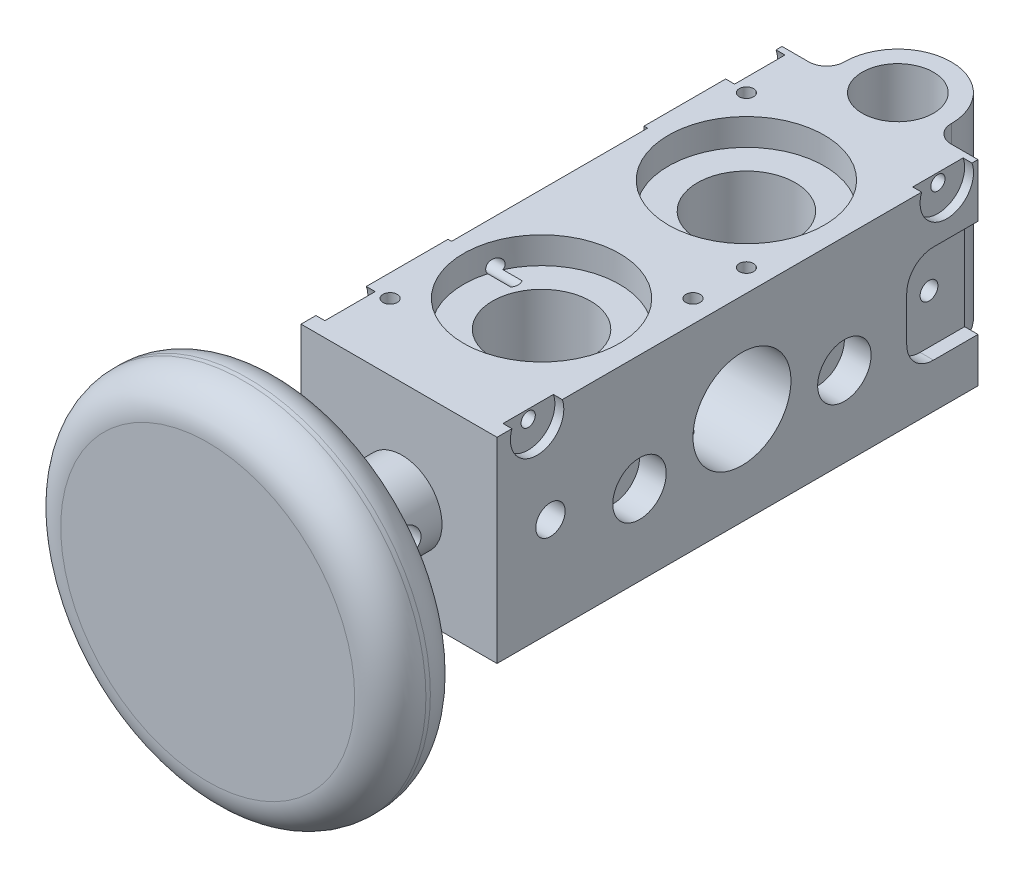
ISO-10303-21;
HEADER;
FILE_DESCRIPTION(('STEP AP214'),'2;1');
FILE_NAME('part.step','',(''),(''),'','','');
FILE_SCHEMA(('AUTOMOTIVE_DESIGN { 1 0 10303 214 1 1 1 1 }'));
ENDSEC;
DATA;
#1=APPLICATION_CONTEXT('core data for automotive mechanical design processes');
#2=APPLICATION_PROTOCOL_DEFINITION('international standard','automotive_design',2000,#1);
#3=PRODUCT_CONTEXT('',#1,'mechanical');
#4=PRODUCT('Part','Part','',(#3));
#5=PRODUCT_RELATED_PRODUCT_CATEGORY('part','',(#4));
#6=PRODUCT_DEFINITION_FORMATION('','',#4);
#7=PRODUCT_DEFINITION_CONTEXT('part definition',#1,'design');
#8=PRODUCT_DEFINITION('design','',#6,#7);
#9=PRODUCT_DEFINITION_SHAPE('','',#8);
#10=(LENGTH_UNIT() NAMED_UNIT(*) SI_UNIT(.MILLI.,.METRE.));
#11=(NAMED_UNIT(*) PLANE_ANGLE_UNIT() SI_UNIT($,.RADIAN.));
#12=(NAMED_UNIT(*) SI_UNIT($,.STERADIAN.) SOLID_ANGLE_UNIT());
#13=UNCERTAINTY_MEASURE_WITH_UNIT(LENGTH_MEASURE(1.E-05),#10,'distance_accuracy_value','');
#14=(GEOMETRIC_REPRESENTATION_CONTEXT(3) GLOBAL_UNCERTAINTY_ASSIGNED_CONTEXT((#13)) GLOBAL_UNIT_ASSIGNED_CONTEXT((#10,
#11,#12)) REPRESENTATION_CONTEXT('',''));
#15=CARTESIAN_POINT('',(0.,0.,0.));
#16=DIRECTION('',(0.,0.,1.));
#17=DIRECTION('',(1.,0.,0.));
#18=AXIS2_PLACEMENT_3D('',#15,#16,#17);
#19=CARTESIAN_POINT('',(0.,0.,54.));
#20=DIRECTION('',(-1.,0.,0.));
#21=DIRECTION('',(0.,0.,1.));
#22=AXIS2_PLACEMENT_3D('',#19,#20,#21);
#23=PLANE('',#22);
#24=CARTESIAN_POINT('',(0.,11.,26.5));
#25=DIRECTION('',(-1.,0.,0.));
#26=DIRECTION('',(0.,0.,1.));
#27=AXIS2_PLACEMENT_3D('',#24,#25,#26);
#28=CIRCLE('',#27,5.49999999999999);
#29=CARTESIAN_POINT('',(0.,11.,32.));
#30=VERTEX_POINT('',#29);
#31=EDGE_CURVE('E646',#30,#30,#28,.T.);
#32=ORIENTED_EDGE('',*,*,#31,.T.);
#33=EDGE_LOOP('',(#32));
#34=FACE_BOUND('',#33,.T.);
#35=CARTESIAN_POINT('',(0.,9.,15.));
#36=DIRECTION('',(1.,0.,0.));
#37=DIRECTION('',(0.,0.,-1.));
#38=AXIS2_PLACEMENT_3D('',#35,#36,#37);
#39=CIRCLE('',#38,3.);
#40=CARTESIAN_POINT('',(0.,9.,12.));
#41=VERTEX_POINT('',#40);
#42=EDGE_CURVE('E710',#41,#41,#39,.T.);
#43=ORIENTED_EDGE('',*,*,#42,.F.);
#44=EDGE_LOOP('',(#43));
#45=FACE_BOUND('',#44,.T.);
#46=CARTESIAN_POINT('',(0.,9.,38.));
#47=DIRECTION('',(1.,0.,0.));
#48=DIRECTION('',(0.,0.,-1.));
#49=AXIS2_PLACEMENT_3D('',#46,#47,#48);
#50=CIRCLE('',#49,3.);
#51=CARTESIAN_POINT('',(0.,9.,35.));
#52=VERTEX_POINT('',#51);
#53=EDGE_CURVE('E714',#52,#52,#50,.T.);
#54=ORIENTED_EDGE('',*,*,#53,.F.);
#55=EDGE_LOOP('',(#54));
#56=FACE_BOUND('',#55,.T.);
#57=CARTESIAN_POINT('',(0.,11.,48.));
#58=DIRECTION('',(1.,0.,0.));
#59=DIRECTION('',(0.,0.,-1.));
#60=AXIS2_PLACEMENT_3D('',#57,#58,#59);
#61=CIRCLE('',#60,1.64999999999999);
#62=CARTESIAN_POINT('',(0.,11.,46.35));
#63=VERTEX_POINT('',#62);
#64=EDGE_CURVE('E718',#63,#63,#61,.T.);
#65=ORIENTED_EDGE('',*,*,#64,.F.);
#66=EDGE_LOOP('',(#65));
#67=FACE_BOUND('',#66,.T.);
#68=CARTESIAN_POINT('',(0.,13.,5.));
#69=DIRECTION('',(1.,0.,0.));
#70=DIRECTION('',(0.,0.,1.));
#71=AXIS2_PLACEMENT_3D('',#68,#69,#70);
#72=CIRCLE('',#71,3.);
#73=CARTESIAN_POINT('',(0.,16.,5.));
#74=VERTEX_POINT('',#73);
#75=CARTESIAN_POINT('',(0.,13.,8.));
#76=VERTEX_POINT('',#75);
#77=EDGE_CURVE('E406',#74,#76,#72,.T.);
#78=ORIENTED_EDGE('',*,*,#77,.F.);
#79=DIRECTION('',(0.,0.,1.));
#80=VECTOR('',#79,1.);
#81=CARTESIAN_POINT('',(0.,16.,5.));
#82=LINE('',#81,#80);
#83=CARTESIAN_POINT('',(0.,16.,0.));
#84=VERTEX_POINT('',#83);
#85=EDGE_CURVE('E427',#84,#74,#82,.T.);
#86=ORIENTED_EDGE('',*,*,#85,.F.);
#87=DIRECTION('',(0.,1.,0.));
#88=VECTOR('',#87,1.);
#89=CARTESIAN_POINT('',(0.,0.,0.));
#90=LINE('',#89,#88);
#91=CARTESIAN_POINT('',(0.,22.,0.));
#92=VERTEX_POINT('',#91);
#93=EDGE_CURVE('E736',#84,#92,#90,.T.);
#94=ORIENTED_EDGE('',*,*,#93,.T.);
#95=DIRECTION('',(0.,0.,-1.));
#96=VECTOR('',#95,1.);
#97=CARTESIAN_POINT('',(0.,22.,54.));
#98=LINE('',#97,#96);
#99=CARTESIAN_POINT('',(0.,22.,0.671572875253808));
#100=VERTEX_POINT('',#99);
#101=EDGE_CURVE('E781',#100,#92,#98,.T.);
#102=ORIENTED_EDGE('',*,*,#101,.F.);
#103=CARTESIAN_POINT('',(0.,21.,3.5));
#104=DIRECTION('',(-1.,0.,0.));
#105=DIRECTION('',(0.,-1.,0.));
#106=AXIS2_PLACEMENT_3D('',#103,#104,#105);
#107=CIRCLE('',#106,3.);
#108=CARTESIAN_POINT('',(0.,22.,6.32842712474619));
#109=VERTEX_POINT('',#108);
#110=EDGE_CURVE('E475',#100,#109,#107,.T.);
#111=ORIENTED_EDGE('',*,*,#110,.T.);
#112=CARTESIAN_POINT('',(0.,22.,46.6715728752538));
#113=VERTEX_POINT('',#112);
#114=EDGE_CURVE('E788',#113,#109,#98,.T.);
#115=ORIENTED_EDGE('',*,*,#114,.F.);
#116=CARTESIAN_POINT('',(0.,21.,49.5));
#117=DIRECTION('',(-1.,0.,0.));
#118=DIRECTION('',(0.,-1.,0.));
#119=AXIS2_PLACEMENT_3D('',#116,#117,#118);
#120=CIRCLE('',#119,3.);
#121=CARTESIAN_POINT('',(0.,22.,52.3284271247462));
#122=VERTEX_POINT('',#121);
#123=EDGE_CURVE('E469',#113,#122,#120,.T.);
#124=ORIENTED_EDGE('',*,*,#123,.T.);
#125=CARTESIAN_POINT('',(0.,22.,54.));
#126=VERTEX_POINT('',#125);
#127=EDGE_CURVE('E784',#126,#122,#98,.T.);
#128=ORIENTED_EDGE('',*,*,#127,.F.);
#129=DIRECTION('',(0.,1.,0.));
#130=VECTOR('',#129,1.);
#131=CARTESIAN_POINT('',(0.,0.,54.));
#132=LINE('',#131,#130);
#133=CARTESIAN_POINT('',(0.,0.,54.));
#134=VERTEX_POINT('',#133);
#135=EDGE_CURVE('E761',#134,#126,#132,.T.);
#136=ORIENTED_EDGE('',*,*,#135,.F.);
#137=DIRECTION('',(0.,0.,-1.));
#138=VECTOR('',#137,1.);
#139=CARTESIAN_POINT('',(0.,0.,54.));
#140=LINE('',#139,#138);
#141=CARTESIAN_POINT('',(0.,0.,0.));
#142=VERTEX_POINT('',#141);
#143=EDGE_CURVE('E770',#134,#142,#140,.T.);
#144=ORIENTED_EDGE('',*,*,#143,.T.);
#145=CARTESIAN_POINT('',(0.,5.,0.));
#146=VERTEX_POINT('',#145);
#147=EDGE_CURVE('E742',#142,#146,#90,.T.);
#148=ORIENTED_EDGE('',*,*,#147,.T.);
#149=DIRECTION('',(0.,0.,-1.));
#150=VECTOR('',#149,1.);
#151=CARTESIAN_POINT('',(0.,5.,5.));
#152=LINE('',#151,#150);
#153=CARTESIAN_POINT('',(0.,5.,5.));
#154=VERTEX_POINT('',#153);
#155=EDGE_CURVE('E425',#154,#146,#152,.T.);
#156=ORIENTED_EDGE('',*,*,#155,.F.);
#157=CARTESIAN_POINT('',(0.,8.,5.));
#158=DIRECTION('',(1.,0.,0.));
#159=DIRECTION('',(0.,0.,-1.));
#160=AXIS2_PLACEMENT_3D('',#157,#158,#159);
#161=CIRCLE('',#160,3.);
#162=CARTESIAN_POINT('',(0.,8.,8.));
#163=VERTEX_POINT('',#162);
#164=EDGE_CURVE('E422',#163,#154,#161,.T.);
#165=ORIENTED_EDGE('',*,*,#164,.F.);
#166=DIRECTION('',(0.,-1.,0.));
#167=VECTOR('',#166,1.);
#168=CARTESIAN_POINT('',(0.,13.,8.));
#169=LINE('',#168,#167);
#170=EDGE_CURVE('E419',#76,#163,#169,.T.);
#171=ORIENTED_EDGE('',*,*,#170,.F.);
#172=EDGE_LOOP('',(#78,#86,#94,#102,#111,#115,#124,#128,#136,#144,#148,#156,#165,#171));
#173=FACE_BOUND('',#172,.T.);
#174=ADVANCED_FACE('F29',(#34,#45,#56,#67,#173),#23,.F.);
#175=CARTESIAN_POINT('',(0.,22.,54.));
#176=DIRECTION('',(0.,-1.,0.));
#177=DIRECTION('',(0.,0.,-1.));
#178=AXIS2_PLACEMENT_3D('',#175,#176,#177);
#179=PLANE('',#178);
#180=CARTESIAN_POINT('',(-19.5,22.,6.5));
#181=DIRECTION('',(0.,1.,0.));
#182=DIRECTION('',(0.,0.,1.));
#183=AXIS2_PLACEMENT_3D('',#180,#181,#182);
#184=CIRCLE('',#183,0.799999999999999);
#185=CARTESIAN_POINT('',(-19.5,22.,7.3));
#186=VERTEX_POINT('',#185);
#187=EDGE_CURVE('E1606',#186,#186,#184,.T.);
#188=ORIENTED_EDGE('',*,*,#187,.F.);
#189=EDGE_LOOP('',(#188));
#190=FACE_BOUND('',#189,.T.);
#191=CARTESIAN_POINT('',(-2.5,22.,23.5));
#192=DIRECTION('',(0.,1.,0.));
#193=DIRECTION('',(0.,0.,1.));
#194=AXIS2_PLACEMENT_3D('',#191,#192,#193);
#195=CIRCLE('',#194,0.799999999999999);
#196=CARTESIAN_POINT('',(-2.5,22.,24.3));
#197=VERTEX_POINT('',#196);
#198=EDGE_CURVE('E1612',#197,#197,#195,.T.);
#199=ORIENTED_EDGE('',*,*,#198,.F.);
#200=EDGE_LOOP('',(#199));
#201=FACE_BOUND('',#200,.T.);
#202=CARTESIAN_POINT('',(-2.5,22.,29.5));
#203=DIRECTION('',(0.,1.,0.));
#204=DIRECTION('',(0.,0.,1.));
#205=AXIS2_PLACEMENT_3D('',#202,#203,#204);
#206=CIRCLE('',#205,0.799999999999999);
#207=CARTESIAN_POINT('',(-2.5,22.,30.3));
#208=VERTEX_POINT('',#207);
#209=EDGE_CURVE('E1618',#208,#208,#206,.T.);
#210=ORIENTED_EDGE('',*,*,#209,.F.);
#211=EDGE_LOOP('',(#210));
#212=FACE_BOUND('',#211,.T.);
#213=CARTESIAN_POINT('',(-19.5,22.,46.5));
#214=DIRECTION('',(0.,1.,0.));
#215=DIRECTION('',(0.,0.,1.));
#216=AXIS2_PLACEMENT_3D('',#213,#214,#215);
#217=CIRCLE('',#216,0.799999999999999);
#218=CARTESIAN_POINT('',(-19.5,22.,47.3));
#219=VERTEX_POINT('',#218);
#220=EDGE_CURVE('E1624',#219,#219,#217,.T.);
#221=ORIENTED_EDGE('',*,*,#220,.F.);
#222=EDGE_LOOP('',(#221));
#223=FACE_BOUND('',#222,.T.);
#224=CARTESIAN_POINT('',(-11.,22.,15.));
#225=DIRECTION('',(0.,1.,0.));
#226=DIRECTION('',(0.,0.,1.));
#227=AXIS2_PLACEMENT_3D('',#224,#225,#226);
#228=CIRCLE('',#227,8.75);
#229=CARTESIAN_POINT('',(-11.,22.,23.75));
#230=VERTEX_POINT('',#229);
#231=EDGE_CURVE('E1886',#230,#230,#228,.T.);
#232=ORIENTED_EDGE('',*,*,#231,.F.);
#233=EDGE_LOOP('',(#232));
#234=FACE_BOUND('',#233,.T.);
#235=CARTESIAN_POINT('',(-11.,22.,38.));
#236=DIRECTION('',(0.,1.,0.));
#237=DIRECTION('',(0.,0.,1.));
#238=AXIS2_PLACEMENT_3D('',#235,#236,#237);
#239=CIRCLE('',#238,8.75);
#240=CARTESIAN_POINT('',(-11.,22.,46.75));
#241=VERTEX_POINT('',#240);
#242=EDGE_CURVE('E1679',#241,#241,#239,.T.);
#243=ORIENTED_EDGE('',*,*,#242,.F.);
#244=EDGE_LOOP('',(#243));
#245=FACE_BOUND('',#244,.T.);
#246=CARTESIAN_POINT('',(-11.,22.,-2.));
#247=DIRECTION('',(0.,-1.,0.));
#248=DIRECTION('',(0.,0.,-1.));
#249=AXIS2_PLACEMENT_3D('',#246,#247,#248);
#250=CIRCLE('',#249,4.);
#251=CARTESIAN_POINT('',(-11.,22.,-6.));
#252=VERTEX_POINT('',#251);
#253=EDGE_CURVE('E1691',#252,#252,#250,.T.);
#254=ORIENTED_EDGE('',*,*,#253,.T.);
#255=EDGE_LOOP('',(#254));
#256=FACE_BOUND('',#255,.T.);
#257=DIRECTION('',(1.,0.,0.));
#258=VECTOR('',#257,1.);
#259=CARTESIAN_POINT('',(-1.,22.,46.6715728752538));
#260=LINE('',#259,#258);
#261=CARTESIAN_POINT('',(-1.,22.,46.6715728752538));
#262=VERTEX_POINT('',#261);
#263=EDGE_CURVE('E11',#113,#262,#260,.F.);
#264=ORIENTED_EDGE('',*,*,#263,.F.);
#265=ORIENTED_EDGE('',*,*,#114,.T.);
#266=DIRECTION('',(1.,0.,0.));
#267=VECTOR('',#266,1.);
#268=CARTESIAN_POINT('',(-1.,22.,6.32842712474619));
#269=LINE('',#268,#267);
#270=CARTESIAN_POINT('',(-1.,22.,6.32842712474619));
#271=VERTEX_POINT('',#270);
#272=EDGE_CURVE('E1761',#271,#109,#269,.T.);
#273=ORIENTED_EDGE('',*,*,#272,.F.);
#274=DIRECTION('',(0.,0.,1.));
#275=VECTOR('',#274,1.);
#276=CARTESIAN_POINT('',(-1.,22.,54.));
#277=LINE('',#276,#275);
#278=CARTESIAN_POINT('',(-1.,22.,0.671572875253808));
#279=VERTEX_POINT('',#278);
#280=EDGE_CURVE('E1760',#279,#271,#277,.T.);
#281=ORIENTED_EDGE('',*,*,#280,.F.);
#282=DIRECTION('',(1.,0.,0.));
#283=VECTOR('',#282,1.);
#284=CARTESIAN_POINT('',(-1.,22.,0.671572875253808));
#285=LINE('',#284,#283);
#286=EDGE_CURVE('E1759',#100,#279,#285,.F.);
#287=ORIENTED_EDGE('',*,*,#286,.F.);
#288=ORIENTED_EDGE('',*,*,#101,.T.);
#289=DIRECTION('',(-1.,0.,0.));
#290=VECTOR('',#289,1.);
#291=CARTESIAN_POINT('',(0.,22.,0.));
#292=LINE('',#291,#290);
#293=CARTESIAN_POINT('',(-3.,22.,0.));
#294=VERTEX_POINT('',#293);
#295=EDGE_CURVE('E739',#92,#294,#292,.T.);
#296=ORIENTED_EDGE('',*,*,#295,.T.);
#297=CARTESIAN_POINT('',(-3.,22.,-2.));
#298=DIRECTION('',(0.,-1.,0.));
#299=DIRECTION('',(0.,0.,-1.));
#300=AXIS2_PLACEMENT_3D('',#297,#298,#299);
#301=CIRCLE('',#300,2.);
#302=CARTESIAN_POINT('',(-5.,22.,-2.));
#303=VERTEX_POINT('',#302);
#304=EDGE_CURVE('E1559',#294,#303,#301,.T.);
#305=ORIENTED_EDGE('',*,*,#304,.T.);
#306=CARTESIAN_POINT('',(-11.,22.,-2.));
#307=DIRECTION('',(0.,-1.,0.));
#308=DIRECTION('',(0.,0.,-1.));
#309=AXIS2_PLACEMENT_3D('',#306,#307,#308);
#310=CIRCLE('',#309,6.);
#311=CARTESIAN_POINT('',(-17.,22.,-2.));
#312=VERTEX_POINT('',#311);
#313=EDGE_CURVE('E1696',#303,#312,#310,.F.);
#314=ORIENTED_EDGE('',*,*,#313,.T.);
#315=CARTESIAN_POINT('',(-19.,22.,-2.));
#316=DIRECTION('',(0.,-1.,0.));
#317=DIRECTION('',(0.,0.,-1.));
#318=AXIS2_PLACEMENT_3D('',#315,#316,#317);
#319=CIRCLE('',#318,2.);
#320=CARTESIAN_POINT('',(-19.,22.,0.));
#321=VERTEX_POINT('',#320);
#322=EDGE_CURVE('E1576',#312,#321,#319,.T.);
#323=ORIENTED_EDGE('',*,*,#322,.T.);
#324=CARTESIAN_POINT('',(-22.,22.,0.));
#325=VERTEX_POINT('',#324);
#326=EDGE_CURVE('E746',#321,#325,#292,.T.);
#327=ORIENTED_EDGE('',*,*,#326,.T.);
#328=DIRECTION('',(0.,0.,-1.));
#329=VECTOR('',#328,1.);
#330=CARTESIAN_POINT('',(-22.,22.,54.));
#331=LINE('',#330,#329);
#332=CARTESIAN_POINT('',(-22.,22.,0.671572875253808));
#333=VERTEX_POINT('',#332);
#334=EDGE_CURVE('E777',#333,#325,#331,.T.);
#335=ORIENTED_EDGE('',*,*,#334,.F.);
#336=DIRECTION('',(-1.,0.,0.));
#337=VECTOR('',#336,1.);
#338=CARTESIAN_POINT('',(-21.,22.,0.671572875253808));
#339=LINE('',#338,#337);
#340=CARTESIAN_POINT('',(-21.,22.,0.671572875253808));
#341=VERTEX_POINT('',#340);
#342=EDGE_CURVE('E1870',#333,#341,#339,.F.);
#343=ORIENTED_EDGE('',*,*,#342,.T.);
#344=DIRECTION('',(0.,0.,-1.));
#345=VECTOR('',#344,1.);
#346=CARTESIAN_POINT('',(-21.,22.,54.));
#347=LINE('',#346,#345);
#348=CARTESIAN_POINT('',(-21.,22.,6.32842712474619));
#349=VERTEX_POINT('',#348);
#350=EDGE_CURVE('E548',#349,#341,#347,.T.);
#351=ORIENTED_EDGE('',*,*,#350,.F.);
#352=DIRECTION('',(-1.,0.,0.));
#353=VECTOR('',#352,1.);
#354=CARTESIAN_POINT('',(-21.,22.,6.32842712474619));
#355=LINE('',#354,#353);
#356=CARTESIAN_POINT('',(-22.,22.,6.32842712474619));
#357=VERTEX_POINT('',#356);
#358=EDGE_CURVE('E1868',#349,#357,#355,.T.);
#359=ORIENTED_EDGE('',*,*,#358,.T.);
#360=CARTESIAN_POINT('',(-22.,22.,15.5));
#361=VERTEX_POINT('',#360);
#362=EDGE_CURVE('E783',#361,#357,#331,.T.);
#363=ORIENTED_EDGE('',*,*,#362,.F.);
#364=DIRECTION('',(-1.,0.,0.));
#365=VECTOR('',#364,1.);
#366=CARTESIAN_POINT('',(-21.6,22.,15.5));
#367=LINE('',#366,#365);
#368=CARTESIAN_POINT('',(-21.6,22.,15.5));
#369=VERTEX_POINT('',#368);
#370=EDGE_CURVE('E625',#369,#361,#367,.T.);
#371=ORIENTED_EDGE('',*,*,#370,.F.);
#372=DIRECTION('',(0.,0.,-1.));
#373=VECTOR('',#372,1.);
#374=CARTESIAN_POINT('',(-21.6,22.,15.5));
#375=LINE('',#374,#373);
#376=CARTESIAN_POINT('',(-21.6,22.,37.5));
#377=VERTEX_POINT('',#376);
#378=EDGE_CURVE('E621',#377,#369,#375,.T.);
#379=ORIENTED_EDGE('',*,*,#378,.F.);
#380=DIRECTION('',(-1.,0.,0.));
#381=VECTOR('',#380,1.);
#382=CARTESIAN_POINT('',(-21.6,22.,37.5));
#383=LINE('',#382,#381);
#384=CARTESIAN_POINT('',(-22.,22.,37.5));
#385=VERTEX_POINT('',#384);
#386=EDGE_CURVE('E624',#377,#385,#383,.T.);
#387=ORIENTED_EDGE('',*,*,#386,.T.);
#388=CARTESIAN_POINT('',(-22.,22.,46.6715728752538));
#389=VERTEX_POINT('',#388);
#390=EDGE_CURVE('E782',#389,#385,#331,.T.);
#391=ORIENTED_EDGE('',*,*,#390,.F.);
#392=DIRECTION('',(-1.,0.,0.));
#393=VECTOR('',#392,1.);
#394=CARTESIAN_POINT('',(-21.,22.,46.6715728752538));
#395=LINE('',#394,#393);
#396=CARTESIAN_POINT('',(-21.,22.,46.6715728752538));
#397=VERTEX_POINT('',#396);
#398=EDGE_CURVE('E490',#389,#397,#395,.F.);
#399=ORIENTED_EDGE('',*,*,#398,.T.);
#400=DIRECTION('',(0.,0.,-1.));
#401=VECTOR('',#400,1.);
#402=CARTESIAN_POINT('',(-21.,22.,54.));
#403=LINE('',#402,#401);
#404=CARTESIAN_POINT('',(-21.,22.,52.3284271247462));
#405=VERTEX_POINT('',#404);
#406=EDGE_CURVE('E1872',#405,#397,#403,.T.);
#407=ORIENTED_EDGE('',*,*,#406,.F.);
#408=DIRECTION('',(-1.,0.,0.));
#409=VECTOR('',#408,1.);
#410=CARTESIAN_POINT('',(-21.,22.,52.3284271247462));
#411=LINE('',#410,#409);
#412=CARTESIAN_POINT('',(-22.,22.,52.3284271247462));
#413=VERTEX_POINT('',#412);
#414=EDGE_CURVE('E493',#405,#413,#411,.T.);
#415=ORIENTED_EDGE('',*,*,#414,.T.);
#416=CARTESIAN_POINT('',(-22.,22.,54.));
#417=VERTEX_POINT('',#416);
#418=EDGE_CURVE('E778',#417,#413,#331,.T.);
#419=ORIENTED_EDGE('',*,*,#418,.F.);
#420=DIRECTION('',(-1.,0.,0.));
#421=VECTOR('',#420,1.);
#422=CARTESIAN_POINT('',(0.,22.,54.));
#423=LINE('',#422,#421);
#424=EDGE_CURVE('E764',#126,#417,#423,.T.);
#425=ORIENTED_EDGE('',*,*,#424,.F.);
#426=ORIENTED_EDGE('',*,*,#127,.T.);
#427=DIRECTION('',(1.,0.,0.));
#428=VECTOR('',#427,1.);
#429=CARTESIAN_POINT('',(-1.,22.,52.3284271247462));
#430=LINE('',#429,#428);
#431=CARTESIAN_POINT('',(-1.,22.,52.3284271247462));
#432=VERTEX_POINT('',#431);
#433=EDGE_CURVE('E36',#432,#122,#430,.T.);
#434=ORIENTED_EDGE('',*,*,#433,.F.);
#435=DIRECTION('',(0.,0.,1.));
#436=VECTOR('',#435,1.);
#437=CARTESIAN_POINT('',(-1.,22.,54.));
#438=LINE('',#437,#436);
#439=EDGE_CURVE('E1755',#262,#432,#438,.T.);
#440=ORIENTED_EDGE('',*,*,#439,.F.);
#441=EDGE_LOOP('',(#264,#265,#273,#281,#287,#288,#296,#305,#314,#323,#327,#335,#343,#351,#359,
#363,#371,#379,#387,#391,#399,#407,#415,#419,#425,#426,#434,#440));
#442=FACE_BOUND('',#441,.T.);
#443=ADVANCED_FACE('F696',(#190,#201,#212,#223,#234,#245,#256,#442),#179,.F.);
#444=CARTESIAN_POINT('',(-21.6,22.,15.5));
#445=DIRECTION('',(0.,0.,-1.));
#446=DIRECTION('',(0.,1.,0.));
#447=AXIS2_PLACEMENT_3D('',#444,#445,#446);
#448=PLANE('',#447);
#449=DIRECTION('',(-1.,0.,0.));
#450=VECTOR('',#449,1.);
#451=CARTESIAN_POINT('',(-21.6,0.999999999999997,15.5));
#452=LINE('',#451,#450);
#453=CARTESIAN_POINT('',(-21.6244997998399,0.999999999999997,15.5));
#454=VERTEX_POINT('',#453);
#455=CARTESIAN_POINT('',(-22.,0.999999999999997,15.5));
#456=VERTEX_POINT('',#455);
#457=EDGE_CURVE('E572',#454,#456,#452,.T.);
#458=ORIENTED_EDGE('',*,*,#457,.F.);
#459=DIRECTION('',(0.,-1.,0.));
#460=VECTOR('',#459,1.);
#461=CARTESIAN_POINT('',(-21.6244997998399,0.999999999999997,15.5));
#462=LINE('',#461,#460);
#463=CARTESIAN_POINT('',(-21.6244997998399,6.2,15.5));
#464=VERTEX_POINT('',#463);
#465=EDGE_CURVE('E511',#454,#464,#462,.F.);
#466=ORIENTED_EDGE('',*,*,#465,.T.);
#467=CARTESIAN_POINT('',(-22.3819285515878,5.7976632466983,15.5));
#468=CARTESIAN_POINT('',(-22.3192790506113,5.83302609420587,15.5));
#469=CARTESIAN_POINT('',(-22.2565345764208,5.8682292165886,15.5));
#470=CARTESIAN_POINT('',(-22.1306735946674,5.93800222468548,15.5));
#471=CARTESIAN_POINT('',(-22.0675569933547,5.97257194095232,15.5));
#472=CARTESIAN_POINT('',(-21.9412246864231,6.04051831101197,15.5));
#473=CARTESIAN_POINT('',(-21.8780124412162,6.07390137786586,15.5));
#474=CARTESIAN_POINT('',(-21.7507503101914,6.13908208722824,15.5));
#475=CARTESIAN_POINT('',(-21.6867003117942,6.17087951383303,15.5));
#476=CARTESIAN_POINT('',(-21.5868606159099,6.21762354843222,15.5));
#477=CARTESIAN_POINT('',(-21.5515653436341,6.23361696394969,15.5));
#478=CARTESIAN_POINT('',(-21.4804469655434,6.26430650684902,15.5));
#479=CARTESIAN_POINT('',(-21.4446243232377,6.27900370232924,15.5));
#480=CARTESIAN_POINT('',(-21.372102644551,6.30657802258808,15.5));
#481=CARTESIAN_POINT('',(-21.3354007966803,6.31944802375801,15.5));
#482=CARTESIAN_POINT('',(-21.2610162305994,6.34231626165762,15.5));
#483=CARTESIAN_POINT('',(-21.2233310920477,6.35230650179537,15.5));
#484=CARTESIAN_POINT('',(-21.1851365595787,6.36032465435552,15.5));
#485=B_SPLINE_CURVE_WITH_KNOTS('',3,(#467,#468,#469,#470,#471,#472,#473,#474,#475,#476,#477,
#478,#479,#480,#481,#482,#483,#484),.UNSPECIFIED.,.F.,.F.,(4,2,2,2,2,2,2,2,4),(0.,
0.215829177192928,0.431715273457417,0.646163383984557,0.860640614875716,0.976871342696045,
1.0930053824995,1.20958043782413,1.32647615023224),.UNSPECIFIED.);
#486=CARTESIAN_POINT('',(-21.6,6.21140134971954,15.5));
#487=VERTEX_POINT('',#486);
#488=EDGE_CURVE('E514',#464,#487,#485,.T.);
#489=ORIENTED_EDGE('',*,*,#488,.T.);
#490=DIRECTION('',(0.,-1.,0.));
#491=VECTOR('',#490,1.);
#492=CARTESIAN_POINT('',(-21.6,22.,15.5));
#493=LINE('',#492,#491);
#494=EDGE_CURVE('E614',#369,#487,#493,.T.);
#495=ORIENTED_EDGE('',*,*,#494,.F.);
#496=ORIENTED_EDGE('',*,*,#370,.T.);
#497=DIRECTION('',(0.,-1.,0.));
#498=VECTOR('',#497,1.);
#499=CARTESIAN_POINT('',(-22.,22.,15.5));
#500=LINE('',#499,#498);
#501=EDGE_CURVE('E608',#361,#456,#500,.T.);
#502=ORIENTED_EDGE('',*,*,#501,.T.);
#503=EDGE_LOOP('',(#458,#466,#489,#495,#496,#502));
#504=FACE_BOUND('',#503,.T.);
#505=ADVANCED_FACE('F524',(#504),#448,.F.);
#506=CARTESIAN_POINT('',(-21.6,22.,37.5));
#507=DIRECTION('',(0.,0.,1.));
#508=DIRECTION('',(0.,-1.,0.));
#509=AXIS2_PLACEMENT_3D('',#506,#507,#508);
#510=PLANE('',#509);
#511=CARTESIAN_POINT('',(-21.1851365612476,6.36032465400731,37.5));
#512=CARTESIAN_POINT('',(-21.2233310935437,6.35230650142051,37.5));
#513=CARTESIAN_POINT('',(-21.2610162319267,6.34231626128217,37.5));
#514=CARTESIAN_POINT('',(-21.3354007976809,6.31944802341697,37.5));
#515=CARTESIAN_POINT('',(-21.3721026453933,6.30657802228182,37.5));
#516=CARTESIAN_POINT('',(-21.4446243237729,6.27900370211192,37.5));
#517=CARTESIAN_POINT('',(-21.4804469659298,6.26430650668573,37.5));
#518=CARTESIAN_POINT('',(-21.5515653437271,6.23361696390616,37.5));
#519=CARTESIAN_POINT('',(-21.5868606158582,6.21762354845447,37.5));
#520=CARTESIAN_POINT('',(-21.6867003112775,6.1708795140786,37.5));
#521=CARTESIAN_POINT('',(-21.7507503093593,6.13908208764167,37.5));
#522=CARTESIAN_POINT('',(-21.8780124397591,6.07390137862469,37.5));
#523=CARTESIAN_POINT('',(-21.9412246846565,6.04051831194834,37.5));
#524=CARTESIAN_POINT('',(-22.0675569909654,5.97257194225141,37.5));
#525=CARTESIAN_POINT('',(-22.130673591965,5.93800222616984,37.5));
#526=CARTESIAN_POINT('',(-22.2565345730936,5.86822921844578,37.5));
#527=CARTESIAN_POINT('',(-22.3192790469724,5.83302609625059,37.5));
#528=CARTESIAN_POINT('',(-22.3819285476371,5.79766324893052,37.5));
#529=B_SPLINE_CURVE_WITH_KNOTS('',3,(#511,#512,#513,#514,#515,#516,#517,#518,#519,#520,#521,
#522,#523,#524,#525,#526,#527,#528),.UNSPECIFIED.,.F.,.F.,(4,2,2,2,2,2,2,2,4),(0.,
0.116895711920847,0.233470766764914,0.34960480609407,0.465835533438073,0.680312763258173,
0.894760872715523,1.11064696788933,1.32647614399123),.UNSPECIFIED.);
#530=CARTESIAN_POINT('',(-21.6,6.21140134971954,37.5));
#531=VERTEX_POINT('',#530);
#532=CARTESIAN_POINT('',(-21.6244997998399,6.2,37.5));
#533=VERTEX_POINT('',#532);
#534=EDGE_CURVE('E586',#531,#533,#529,.T.);
#535=ORIENTED_EDGE('',*,*,#534,.T.);
#536=DIRECTION('',(0.,-1.,0.));
#537=VECTOR('',#536,1.);
#538=CARTESIAN_POINT('',(-21.6244997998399,0.999999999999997,37.5));
#539=LINE('',#538,#537);
#540=CARTESIAN_POINT('',(-21.6244997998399,0.999999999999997,37.5));
#541=VERTEX_POINT('',#540);
#542=EDGE_CURVE('E594',#533,#541,#539,.T.);
#543=ORIENTED_EDGE('',*,*,#542,.T.);
#544=DIRECTION('',(1.,0.,0.));
#545=VECTOR('',#544,1.);
#546=CARTESIAN_POINT('',(-21.6,0.999999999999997,37.5));
#547=LINE('',#546,#545);
#548=CARTESIAN_POINT('',(-22.,0.999999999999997,37.5));
#549=VERTEX_POINT('',#548);
#550=EDGE_CURVE('E1776',#549,#541,#547,.T.);
#551=ORIENTED_EDGE('',*,*,#550,.F.);
#552=DIRECTION('',(0.,1.,0.));
#553=VECTOR('',#552,1.);
#554=CARTESIAN_POINT('',(-22.,22.,37.5));
#555=LINE('',#554,#553);
#556=EDGE_CURVE('E611',#549,#385,#555,.T.);
#557=ORIENTED_EDGE('',*,*,#556,.T.);
#558=ORIENTED_EDGE('',*,*,#386,.F.);
#559=DIRECTION('',(0.,1.,0.));
#560=VECTOR('',#559,1.);
#561=CARTESIAN_POINT('',(-21.6,22.,37.5));
#562=LINE('',#561,#560);
#563=EDGE_CURVE('E619',#531,#377,#562,.T.);
#564=ORIENTED_EDGE('',*,*,#563,.F.);
#565=EDGE_LOOP('',(#535,#543,#551,#557,#558,#564));
#566=FACE_BOUND('',#565,.T.);
#567=ADVANCED_FACE('F561',(#566),#510,.F.);
#568=CARTESIAN_POINT('',(-22.,0.,54.));
#569=DIRECTION('',(1.,0.,0.));
#570=DIRECTION('',(0.,1.,0.));
#571=AXIS2_PLACEMENT_3D('',#568,#569,#570);
#572=PLANE('',#571);
#573=CARTESIAN_POINT('',(-22.,8.99999999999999,5.));
#574=DIRECTION('',(-1.,0.,0.));
#575=DIRECTION('',(0.,1.,0.));
#576=AXIS2_PLACEMENT_3D('',#573,#574,#575);
#577=CIRCLE('',#576,3.);
#578=CARTESIAN_POINT('',(-22.,5.99999999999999,5.));
#579=VERTEX_POINT('',#578);
#580=CARTESIAN_POINT('',(-22.,8.99999999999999,8.));
#581=VERTEX_POINT('',#580);
#582=EDGE_CURVE('E378',#579,#581,#577,.T.);
#583=ORIENTED_EDGE('',*,*,#582,.F.);
#584=DIRECTION('',(0.,0.,1.));
#585=VECTOR('',#584,1.);
#586=CARTESIAN_POINT('',(-22.,5.99999999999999,5.));
#587=LINE('',#586,#585);
#588=CARTESIAN_POINT('',(-22.,5.99999999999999,0.));
#589=VERTEX_POINT('',#588);
#590=EDGE_CURVE('E375',#589,#579,#587,.T.);
#591=ORIENTED_EDGE('',*,*,#590,.F.);
#592=DIRECTION('',(0.,-1.,0.));
#593=VECTOR('',#592,1.);
#594=CARTESIAN_POINT('',(-22.,0.,0.));
#595=LINE('',#594,#593);
#596=CARTESIAN_POINT('',(-22.,0.,0.));
#597=VERTEX_POINT('',#596);
#598=EDGE_CURVE('E753',#589,#597,#595,.T.);
#599=ORIENTED_EDGE('',*,*,#598,.T.);
#600=DIRECTION('',(0.,0.,-1.));
#601=VECTOR('',#600,1.);
#602=CARTESIAN_POINT('',(-22.,0.,54.));
#603=LINE('',#602,#601);
#604=CARTESIAN_POINT('',(-22.,0.,12.1715728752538));
#605=VERTEX_POINT('',#604);
#606=EDGE_CURVE('E773',#605,#597,#603,.T.);
#607=ORIENTED_EDGE('',*,*,#606,.F.);
#608=DIRECTION('',(0.,-1.,0.));
#609=VECTOR('',#608,1.);
#610=CARTESIAN_POINT('',(-22.,0.999999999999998,12.1715728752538));
#611=LINE('',#610,#609);
#612=CARTESIAN_POINT('',(-22.,0.999999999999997,12.1715728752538));
#613=VERTEX_POINT('',#612);
#614=EDGE_CURVE('E1832',#605,#613,#611,.F.);
#615=ORIENTED_EDGE('',*,*,#614,.T.);
#616=DIRECTION('',(0.,0.,-1.));
#617=VECTOR('',#616,1.);
#618=CARTESIAN_POINT('',(-22.,0.999999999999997,54.));
#619=LINE('',#618,#617);
#620=EDGE_CURVE('E1834',#456,#613,#619,.T.);
#621=ORIENTED_EDGE('',*,*,#620,.F.);
#622=ORIENTED_EDGE('',*,*,#501,.F.);
#623=ORIENTED_EDGE('',*,*,#362,.T.);
#624=CARTESIAN_POINT('',(-22.,21.,3.5));
#625=DIRECTION('',(-1.,0.,0.));
#626=DIRECTION('',(0.,-1.,0.));
#627=AXIS2_PLACEMENT_3D('',#624,#625,#626);
#628=CIRCLE('',#627,3.);
#629=EDGE_CURVE('E502',#333,#357,#628,.T.);
#630=ORIENTED_EDGE('',*,*,#629,.F.);
#631=ORIENTED_EDGE('',*,*,#334,.T.);
#632=CARTESIAN_POINT('',(-22.,17.,0.));
#633=VERTEX_POINT('',#632);
#634=EDGE_CURVE('E754',#325,#633,#595,.T.);
#635=ORIENTED_EDGE('',*,*,#634,.T.);
#636=DIRECTION('',(0.,0.,-1.));
#637=VECTOR('',#636,1.);
#638=CARTESIAN_POINT('',(-22.,17.,0.));
#639=LINE('',#638,#637);
#640=CARTESIAN_POINT('',(-22.,17.,5.));
#641=VERTEX_POINT('',#640);
#642=EDGE_CURVE('E387',#641,#633,#639,.T.);
#643=ORIENTED_EDGE('',*,*,#642,.F.);
#644=CARTESIAN_POINT('',(-22.,14.,5.));
#645=DIRECTION('',(-1.,0.,0.));
#646=DIRECTION('',(0.,-1.,0.));
#647=AXIS2_PLACEMENT_3D('',#644,#645,#646);
#648=CIRCLE('',#647,3.);
#649=CARTESIAN_POINT('',(-22.,14.,8.));
#650=VERTEX_POINT('',#649);
#651=EDGE_CURVE('E384',#650,#641,#648,.T.);
#652=ORIENTED_EDGE('',*,*,#651,.F.);
#653=DIRECTION('',(0.,1.,0.));
#654=VECTOR('',#653,1.);
#655=CARTESIAN_POINT('',(-22.,14.,8.));
#656=LINE('',#655,#654);
#657=EDGE_CURVE('E381',#581,#650,#656,.T.);
#658=ORIENTED_EDGE('',*,*,#657,.F.);
#659=EDGE_LOOP('',(#583,#591,#599,#607,#615,#621,#622,#623,#630,#631,#635,#643,#652,#658));
#660=FACE_BOUND('',#659,.T.);
#661=ADVANCED_FACE('F1180',(#660),#572,.F.);
#662=CARTESIAN_POINT('',(-19.,11.,26.5));
#663=DIRECTION('',(-1.,0.,0.));
#664=DIRECTION('',(0.,-1.,0.));
#665=AXIS2_PLACEMENT_3D('',#662,#663,#664);
#666=CYLINDRICAL_SURFACE('',#665,8.75000000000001);
#667=CARTESIAN_POINT('',(-19.,11.,26.5));
#668=DIRECTION('',(-1.,0.,0.));
#669=DIRECTION('',(0.,-1.,0.));
#670=AXIS2_PLACEMENT_3D('',#667,#668,#669);
#671=CIRCLE('',#670,8.75000000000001);
#672=CARTESIAN_POINT('',(-19.,2.24999999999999,26.5));
#673=VERTEX_POINT('',#672);
#674=EDGE_CURVE('E1685',#673,#673,#671,.T.);
#675=ORIENTED_EDGE('',*,*,#674,.F.);
#676=EDGE_LOOP('',(#675));
#677=FACE_BOUND('',#676,.T.);
#678=CARTESIAN_POINT('',(-21.6,11.,26.5));
#679=DIRECTION('',(-1.,0.,0.));
#680=DIRECTION('',(0.,-1.,0.));
#681=AXIS2_PLACEMENT_3D('',#678,#679,#680);
#682=CIRCLE('',#681,8.75000000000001);
#683=CARTESIAN_POINT('',(-21.6,2.24999999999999,26.5));
#684=VERTEX_POINT('',#683);
#685=EDGE_CURVE('E633',#684,#684,#682,.F.);
#686=ORIENTED_EDGE('',*,*,#685,.F.);
#687=EDGE_LOOP('',(#686));
#688=FACE_BOUND('',#687,.T.);
#689=ADVANCED_FACE('F1162',(#677,#688),#666,.F.);
#690=CARTESIAN_POINT('',(-22.,19.5,35.));
#691=DIRECTION('',(-1.,0.,0.));
#692=DIRECTION('',(0.,0.,1.));
#693=AXIS2_PLACEMENT_3D('',#690,#691,#692);
#694=CYLINDRICAL_SURFACE('',#693,0.799999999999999);
#695=DIRECTION('',(-1.,0.,0.));
#696=VECTOR('',#695,1.);
#697=CARTESIAN_POINT('',(-22.,19.,34.3755002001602));
#698=LINE('',#697,#696);
#699=CARTESIAN_POINT('',(-16.8,19.,34.3755002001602));
#700=VERTEX_POINT('',#699);
#701=CARTESIAN_POINT('',(-18.9640128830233,19.,34.3755002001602));
#702=VERTEX_POINT('',#701);
#703=EDGE_CURVE('E667',#700,#702,#698,.T.);
#704=ORIENTED_EDGE('',*,*,#703,.T.);
#705=CARTESIAN_POINT('',(-19.4213715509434,19.,35.6244997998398));
#706=CARTESIAN_POINT('',(-19.4290373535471,19.0338904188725,35.6516900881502));
#707=CARTESIAN_POINT('',(-19.4357989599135,19.0701747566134,35.6761522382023));
#708=CARTESIAN_POINT('',(-19.44747554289,19.1464497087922,35.7189544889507));
#709=CARTESIAN_POINT('',(-19.4523909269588,19.1864395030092,35.7372959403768));
#710=CARTESIAN_POINT('',(-19.460344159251,19.2691003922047,35.7672183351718));
#711=CARTESIAN_POINT('',(-19.4633801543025,19.3117740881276,35.7787926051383));
#712=CARTESIAN_POINT('',(-19.4675549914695,19.3985162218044,35.7947601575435));
#713=CARTESIAN_POINT('',(-19.468694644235,19.4425840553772,35.7991565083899));
#714=CARTESIAN_POINT('',(-19.4690734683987,19.5303686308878,35.8006149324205));
#715=CARTESIAN_POINT('',(-19.4683331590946,19.5740839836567,35.7977561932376));
#716=CARTESIAN_POINT('',(-19.4649971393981,19.6604025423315,35.7849680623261));
#717=CARTESIAN_POINT('',(-19.4624010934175,19.7030055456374,35.7750373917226));
#718=CARTESIAN_POINT('',(-19.4553677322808,19.7858331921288,35.7484575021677));
#719=CARTESIAN_POINT('',(-19.4509329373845,19.8260610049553,35.7318174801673));
#720=CARTESIAN_POINT('',(-19.4402475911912,19.9031012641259,35.6923743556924));
#721=CARTESIAN_POINT('',(-19.4339971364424,19.9399138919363,35.6695715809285));
#722=CARTESIAN_POINT('',(-19.4196358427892,20.0096298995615,35.6182043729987));
#723=CARTESIAN_POINT('',(-19.4115015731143,20.0424753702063,35.5895679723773));
#724=CARTESIAN_POINT('',(-19.3935089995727,20.1028794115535,35.5276439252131));
#725=CARTESIAN_POINT('',(-19.3836504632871,20.1304372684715,35.4943556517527));
#726=CARTESIAN_POINT('',(-19.3620313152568,20.1803853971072,35.4231112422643));
#727=CARTESIAN_POINT('',(-19.3502234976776,20.202600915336,35.3850470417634));
#728=CARTESIAN_POINT('',(-19.3251236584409,20.2403715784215,35.3062057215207));
#729=CARTESIAN_POINT('',(-19.3118313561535,20.2559254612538,35.2654280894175));
#730=CARTESIAN_POINT('',(-19.2833921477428,20.2807006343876,35.1804238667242));
#731=CARTESIAN_POINT('',(-19.2681888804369,20.2896075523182,35.1361245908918));
#732=CARTESIAN_POINT('',(-19.2367825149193,20.2998771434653,35.0470103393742));
#733=CARTESIAN_POINT('',(-19.2205791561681,20.3012378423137,35.0021952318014));
#734=CARTESIAN_POINT('',(-19.1867479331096,20.296405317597,34.9109646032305));
#735=CARTESIAN_POINT('',(-19.169089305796,20.289832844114,34.8645804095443));
#736=CARTESIAN_POINT('',(-19.1336275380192,20.2687440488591,34.7737041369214));
#737=CARTESIAN_POINT('',(-19.1158243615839,20.2542256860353,34.7292125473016));
#738=CARTESIAN_POINT('',(-19.0801400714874,20.2170446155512,34.6420064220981));
#739=CARTESIAN_POINT('',(-19.0622722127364,20.1941538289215,34.5993833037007));
#740=CARTESIAN_POINT('',(-19.027726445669,20.1407894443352,34.5186153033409));
#741=CARTESIAN_POINT('',(-19.0110485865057,20.1103155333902,34.4804706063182));
#742=CARTESIAN_POINT('',(-18.98005012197,20.0432037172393,34.4107487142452));
#743=CARTESIAN_POINT('',(-18.9656844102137,20.0067223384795,34.3790415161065));
#744=CARTESIAN_POINT('',(-18.939682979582,19.9279897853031,34.3223772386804));
#745=CARTESIAN_POINT('',(-18.928045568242,19.8857422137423,34.2974159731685));
#746=CARTESIAN_POINT('',(-18.909108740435,19.8003518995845,34.2571460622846));
#747=CARTESIAN_POINT('',(-18.9015324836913,19.7575646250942,34.2412151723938));
#748=CARTESIAN_POINT('',(-18.8898830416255,19.6694625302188,34.2168225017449));
#749=CARTESIAN_POINT('',(-18.8858073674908,19.6241495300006,34.2083554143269));
#750=CARTESIAN_POINT('',(-18.8816612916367,19.5367040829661,34.199745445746));
#751=CARTESIAN_POINT('',(-18.8812631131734,19.4946529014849,34.1989213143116));
#752=CARTESIAN_POINT('',(-18.883643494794,19.4110337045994,34.2038607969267));
#753=CARTESIAN_POINT('',(-18.8864215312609,19.3694656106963,34.2096233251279));
#754=CARTESIAN_POINT('',(-18.8948439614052,19.2892481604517,34.2271987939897));
#755=CARTESIAN_POINT('',(-18.9004014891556,19.2505488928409,34.2388284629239));
#756=CARTESIAN_POINT('',(-18.9140225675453,19.1757187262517,34.2675748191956));
#757=CARTESIAN_POINT('',(-18.9220856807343,19.1395873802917,34.2846905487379));
#758=CARTESIAN_POINT('',(-18.9361051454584,19.0865664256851,34.3147768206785));
#759=CARTESIAN_POINT('',(-18.9413226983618,19.0684756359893,34.3260286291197));
#760=CARTESIAN_POINT('',(-18.9522861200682,19.0334028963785,34.3498196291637));
#761=CARTESIAN_POINT('',(-18.9580305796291,19.0164181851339,34.3623553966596));
#762=CARTESIAN_POINT('',(-18.964012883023,18.9999999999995,34.3755002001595));
#763=B_SPLINE_CURVE_WITH_KNOTS('',3,(#705,#706,#707,#708,#709,#710,#711,#712,#713,#714,#715,
#716,#717,#718,#719,#720,#721,#722,#723,#724,#725,#726,#727,#728,#729,#730,#731,#732,#733,#734,
#735,#736,#737,#738,#739,#740,#741,#742,#743,#744,#745,#746,#747,#748,#749,#750,#751,#752,#753,
#754,#755,#756,#757,#758,#759,#760,#761,#762),.UNSPECIFIED.,.F.,.F.,(4,2,2,2,2,2,2,2,2,2,2,2,2,
2,2,2,2,2,2,2,2,2,2,2,2,2,2,2,4),(0.,0.132213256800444,0.26439731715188,0.39671151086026,
0.528969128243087,0.659789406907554,0.790633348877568,0.921298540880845,1.05195678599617,
1.1843368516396,1.31673477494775,1.4530058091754,1.58930264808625,1.73169596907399,
1.87412654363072,2.02364441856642,2.17320071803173,2.32717827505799,2.48116218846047,
2.63163229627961,2.78200881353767,2.92009311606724,3.05807916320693,3.18363317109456,
3.30916648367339,3.43100108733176,3.55281443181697,3.61855342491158,3.68412145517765),.UNSPECIFIED.);
#764=CARTESIAN_POINT('',(-19.4213715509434,19.,35.6244997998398));
#765=VERTEX_POINT('',#764);
#766=EDGE_CURVE('E1592',#765,#702,#763,.T.);
#767=ORIENTED_EDGE('',*,*,#766,.F.);
#768=DIRECTION('',(-1.,0.,0.));
#769=VECTOR('',#768,1.);
#770=CARTESIAN_POINT('',(-22.,19.,35.6244997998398));
#771=LINE('',#770,#769);
#772=CARTESIAN_POINT('',(-16.8,19.,35.6244997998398));
#773=VERTEX_POINT('',#772);
#774=EDGE_CURVE('E1583',#765,#773,#771,.F.);
#775=ORIENTED_EDGE('',*,*,#774,.T.);
#776=CARTESIAN_POINT('',(-16.8,19.5,35.));
#777=DIRECTION('',(-1.,0.,0.));
#778=DIRECTION('',(0.,0.,1.));
#779=AXIS2_PLACEMENT_3D('',#776,#777,#778);
#780=CIRCLE('',#779,0.799999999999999);
#781=EDGE_CURVE('E1599',#700,#773,#780,.T.);
#782=ORIENTED_EDGE('',*,*,#781,.F.);
#783=EDGE_LOOP('',(#704,#767,#775,#782));
#784=FACE_BOUND('',#783,.T.);
#785=CARTESIAN_POINT('',(-21.6,19.5,35.));
#786=DIRECTION('',(-1.,0.,0.));
#787=DIRECTION('',(0.,-1.,0.));
#788=AXIS2_PLACEMENT_3D('',#785,#786,#787);
#789=CIRCLE('',#788,0.799999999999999);
#790=CARTESIAN_POINT('',(-21.6,18.7,35.));
#791=VERTEX_POINT('',#790);
#792=EDGE_CURVE('E627',#791,#791,#789,.F.);
#793=ORIENTED_EDGE('',*,*,#792,.F.);
#794=EDGE_LOOP('',(#793));
#795=FACE_BOUND('',#794,.T.);
#796=ADVANCED_FACE('F1156',(#784,#795),#694,.F.);
#797=CARTESIAN_POINT('',(0.,22.,0.));
#798=DIRECTION('',(0.,0.,1.));
#799=DIRECTION('',(1.,0.,0.));
#800=AXIS2_PLACEMENT_3D('',#797,#798,#799);
#801=PLANE('',#800);
#802=ORIENTED_EDGE('',*,*,#598,.F.);
#803=DIRECTION('',(-1.,0.,0.));
#804=VECTOR('',#803,1.);
#805=CARTESIAN_POINT('',(-20.5,5.99999999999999,0.));
#806=LINE('',#805,#804);
#807=CARTESIAN_POINT('',(-20.5,5.99999999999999,0.));
#808=VERTEX_POINT('',#807);
#809=EDGE_CURVE('E404',#808,#589,#806,.T.);
#810=ORIENTED_EDGE('',*,*,#809,.F.);
#811=DIRECTION('',(0.,-1.,0.));
#812=VECTOR('',#811,1.);
#813=CARTESIAN_POINT('',(-20.5,5.99999999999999,0.));
#814=LINE('',#813,#812);
#815=CARTESIAN_POINT('',(-20.5,17.,0.));
#816=VERTEX_POINT('',#815);
#817=EDGE_CURVE('E401',#816,#808,#814,.T.);
#818=ORIENTED_EDGE('',*,*,#817,.F.);
#819=DIRECTION('',(-1.,0.,0.));
#820=VECTOR('',#819,1.);
#821=CARTESIAN_POINT('',(-20.5,17.,0.));
#822=LINE('',#821,#820);
#823=EDGE_CURVE('E407',#816,#633,#822,.T.);
#824=ORIENTED_EDGE('',*,*,#823,.T.);
#825=ORIENTED_EDGE('',*,*,#634,.F.);
#826=ORIENTED_EDGE('',*,*,#326,.F.);
#827=DIRECTION('',(0.,-1.,0.));
#828=VECTOR('',#827,1.);
#829=CARTESIAN_POINT('',(-19.,22.,0.));
#830=LINE('',#829,#828);
#831=CARTESIAN_POINT('',(-19.,0.,0.));
#832=VERTEX_POINT('',#831);
#833=EDGE_CURVE('E1569',#321,#832,#830,.T.);
#834=ORIENTED_EDGE('',*,*,#833,.T.);
#835=DIRECTION('',(1.,0.,0.));
#836=VECTOR('',#835,1.);
#837=CARTESIAN_POINT('',(0.,0.,0.));
#838=LINE('',#837,#836);
#839=EDGE_CURVE('E758',#597,#832,#838,.T.);
#840=ORIENTED_EDGE('',*,*,#839,.F.);
#841=EDGE_LOOP('',(#802,#810,#818,#824,#825,#826,#834,#840));
#842=FACE_BOUND('',#841,.T.);
#843=ADVANCED_FACE('F1161',(#842),#801,.F.);
#844=CARTESIAN_POINT('',(0.,22.,54.));
#845=DIRECTION('',(0.,0.,1.));
#846=DIRECTION('',(1.,0.,0.));
#847=AXIS2_PLACEMENT_3D('',#844,#845,#846);
#848=PLANE('',#847);
#849=ORIENTED_EDGE('',*,*,#135,.T.);
#850=ORIENTED_EDGE('',*,*,#424,.T.);
#851=DIRECTION('',(0.,-1.,0.));
#852=VECTOR('',#851,1.);
#853=CARTESIAN_POINT('',(-22.,0.,54.));
#854=LINE('',#853,#852);
#855=CARTESIAN_POINT('',(-22.,0.,54.));
#856=VERTEX_POINT('',#855);
#857=EDGE_CURVE('E766',#417,#856,#854,.T.);
#858=ORIENTED_EDGE('',*,*,#857,.T.);
#859=DIRECTION('',(1.,0.,0.));
#860=VECTOR('',#859,1.);
#861=CARTESIAN_POINT('',(0.,0.,54.));
#862=LINE('',#861,#860);
#863=EDGE_CURVE('E768',#856,#134,#862,.T.);
#864=ORIENTED_EDGE('',*,*,#863,.T.);
#865=EDGE_LOOP('',(#849,#850,#858,#864));
#866=FACE_BOUND('',#865,.T.);
#867=CARTESIAN_POINT('',(-10.6730337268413,10.4278090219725,54.));
#868=DIRECTION('',(0.,0.,1.));
#869=DIRECTION('',(1.,0.,0.));
#870=AXIS2_PLACEMENT_3D('',#867,#868,#869);
#871=CIRCLE('',#870,4.5);
#872=CARTESIAN_POINT('',(-6.1730337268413,10.4278090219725,54.));
#873=VERTEX_POINT('',#872);
#874=EDGE_CURVE('E748',#873,#873,#871,.T.);
#875=ORIENTED_EDGE('',*,*,#874,.F.);
#876=EDGE_LOOP('',(#875));
#877=FACE_BOUND('',#876,.T.);
#878=ADVANCED_FACE('F1722',(#866,#877),#848,.T.);
#879=ORIENTED_EDGE('',*,*,#418,.T.);
#880=CARTESIAN_POINT('',(-22.,21.,49.5));
#881=DIRECTION('',(1.,0.,0.));
#882=DIRECTION('',(0.,1.,0.));
#883=AXIS2_PLACEMENT_3D('',#880,#881,#882);
#884=CIRCLE('',#883,3.);
#885=EDGE_CURVE('E1805',#413,#389,#884,.T.);
#886=ORIENTED_EDGE('',*,*,#885,.T.);
#887=ORIENTED_EDGE('',*,*,#390,.T.);
#888=ORIENTED_EDGE('',*,*,#556,.F.);
#889=DIRECTION('',(0.,0.,-1.));
#890=VECTOR('',#889,1.);
#891=CARTESIAN_POINT('',(-22.,0.999999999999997,54.));
#892=LINE('',#891,#890);
#893=CARTESIAN_POINT('',(-22.,0.999999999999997,40.8284271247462));
#894=VERTEX_POINT('',#893);
#895=EDGE_CURVE('E603',#894,#549,#892,.T.);
#896=ORIENTED_EDGE('',*,*,#895,.F.);
#897=DIRECTION('',(0.,-1.,0.));
#898=VECTOR('',#897,1.);
#899=CARTESIAN_POINT('',(-22.,0.999999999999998,40.8284271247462));
#900=LINE('',#899,#898);
#901=CARTESIAN_POINT('',(-22.,0.,40.8284271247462));
#902=VERTEX_POINT('',#901);
#903=EDGE_CURVE('E605',#894,#902,#900,.T.);
#904=ORIENTED_EDGE('',*,*,#903,.T.);
#905=EDGE_CURVE('E774',#856,#902,#603,.T.);
#906=ORIENTED_EDGE('',*,*,#905,.F.);
#907=ORIENTED_EDGE('',*,*,#857,.F.);
#908=EDGE_LOOP('',(#879,#886,#887,#888,#896,#904,#906,#907));
#909=FACE_BOUND('',#908,.T.);
#910=ADVANCED_FACE('F1190',(#909),#572,.F.);
#911=CARTESIAN_POINT('',(0.,0.,54.));
#912=DIRECTION('',(0.,1.,0.));
#913=DIRECTION('',(-1.,0.,0.));
#914=AXIS2_PLACEMENT_3D('',#911,#912,#913);
#915=PLANE('',#914);
#916=CARTESIAN_POINT('',(-13.5,0.,26.5));
#917=DIRECTION('',(0.,-1.,0.));
#918=DIRECTION('',(1.,0.,0.));
#919=AXIS2_PLACEMENT_3D('',#916,#917,#918);
#920=CIRCLE('',#919,3.);
#921=CARTESIAN_POINT('',(-10.5,0.,26.5));
#922=VERTEX_POINT('',#921);
#923=EDGE_CURVE('E1627',#922,#922,#920,.T.);
#924=ORIENTED_EDGE('',*,*,#923,.F.);
#925=EDGE_LOOP('',(#924));
#926=FACE_BOUND('',#925,.T.);
#927=CARTESIAN_POINT('',(-6.5,0.,26.5));
#928=DIRECTION('',(0.,-1.,0.));
#929=DIRECTION('',(1.,0.,0.));
#930=AXIS2_PLACEMENT_3D('',#927,#928,#929);
#931=CIRCLE('',#930,3.);
#932=CARTESIAN_POINT('',(-3.5,0.,26.5));
#933=VERTEX_POINT('',#932);
#934=EDGE_CURVE('E1639',#933,#933,#931,.T.);
#935=ORIENTED_EDGE('',*,*,#934,.F.);
#936=EDGE_LOOP('',(#935));
#937=FACE_BOUND('',#936,.T.);
#938=CARTESIAN_POINT('',(-11.,0.,15.));
#939=DIRECTION('',(0.,1.,0.));
#940=DIRECTION('',(-1.,0.,0.));
#941=AXIS2_PLACEMENT_3D('',#938,#939,#940);
#942=CIRCLE('',#941,5.5);
#943=CARTESIAN_POINT('',(-16.5,0.,15.));
#944=VERTEX_POINT('',#943);
#945=EDGE_CURVE('E1738',#944,#944,#942,.T.);
#946=ORIENTED_EDGE('',*,*,#945,.T.);
#947=EDGE_LOOP('',(#946));
#948=FACE_BOUND('',#947,.T.);
#949=CARTESIAN_POINT('',(-11.,0.,38.));
#950=DIRECTION('',(0.,1.,0.));
#951=DIRECTION('',(-1.,0.,0.));
#952=AXIS2_PLACEMENT_3D('',#949,#950,#951);
#953=CIRCLE('',#952,5.5);
#954=CARTESIAN_POINT('',(-16.5,0.,38.));
#955=VERTEX_POINT('',#954);
#956=EDGE_CURVE('E1676',#955,#955,#953,.T.);
#957=ORIENTED_EDGE('',*,*,#956,.T.);
#958=EDGE_LOOP('',(#957));
#959=FACE_BOUND('',#958,.T.);
#960=CARTESIAN_POINT('',(-11.,0.,-2.));
#961=DIRECTION('',(0.,-1.,0.));
#962=DIRECTION('',(1.,0.,0.));
#963=AXIS2_PLACEMENT_3D('',#960,#961,#962);
#964=CIRCLE('',#963,4.);
#965=CARTESIAN_POINT('',(-7.,0.,-2.));
#966=VERTEX_POINT('',#965);
#967=EDGE_CURVE('E1688',#966,#966,#964,.T.);
#968=ORIENTED_EDGE('',*,*,#967,.F.);
#969=EDGE_LOOP('',(#968));
#970=FACE_BOUND('',#969,.T.);
#971=CARTESIAN_POINT('',(-11.,0.,51.));
#972=DIRECTION('',(0.,-1.,0.));
#973=DIRECTION('',(0.,0.,-1.));
#974=AXIS2_PLACEMENT_3D('',#971,#972,#973);
#975=CIRCLE('',#974,1.64999999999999);
#976=CARTESIAN_POINT('',(-11.,0.,49.35));
#977=VERTEX_POINT('',#976);
#978=EDGE_CURVE('E1702',#977,#977,#975,.T.);
#979=ORIENTED_EDGE('',*,*,#978,.F.);
#980=EDGE_LOOP('',(#979));
#981=FACE_BOUND('',#980,.T.);
#982=DIRECTION('',(0.,0.,1.));
#983=VECTOR('',#982,1.);
#984=CARTESIAN_POINT('',(-21.6,0.,15.5));
#985=LINE('',#984,#983);
#986=CARTESIAN_POINT('',(-21.6,0.,17.9393876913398));
#987=VERTEX_POINT('',#986);
#988=CARTESIAN_POINT('',(-21.6,0.,35.0606123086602));
#989=VERTEX_POINT('',#988);
#990=EDGE_CURVE('E617',#987,#989,#985,.T.);
#991=ORIENTED_EDGE('',*,*,#990,.F.);
#992=CARTESIAN_POINT('',(-21.,0.,15.));
#993=DIRECTION('',(0.,-1.,0.));
#994=DIRECTION('',(1.,0.,0.));
#995=AXIS2_PLACEMENT_3D('',#992,#993,#994);
#996=CIRCLE('',#995,3.);
#997=EDGE_CURVE('E522',#605,#987,#996,.T.);
#998=ORIENTED_EDGE('',*,*,#997,.F.);
#999=ORIENTED_EDGE('',*,*,#606,.T.);
#1000=ORIENTED_EDGE('',*,*,#839,.T.);
#1001=CARTESIAN_POINT('',(-19.,0.,-2.));
#1002=DIRECTION('',(0.,1.,0.));
#1003=DIRECTION('',(-1.,0.,0.));
#1004=AXIS2_PLACEMENT_3D('',#1001,#1002,#1003);
#1005=CIRCLE('',#1004,2.);
#1006=CARTESIAN_POINT('',(-17.,0.,-2.));
#1007=VERTEX_POINT('',#1006);
#1008=EDGE_CURVE('E1574',#832,#1007,#1005,.T.);
#1009=ORIENTED_EDGE('',*,*,#1008,.T.);
#1010=CARTESIAN_POINT('',(-11.,0.,-2.));
#1011=DIRECTION('',(0.,-1.,0.));
#1012=DIRECTION('',(1.,0.,0.));
#1013=AXIS2_PLACEMENT_3D('',#1010,#1011,#1012);
#1014=CIRCLE('',#1013,6.);
#1015=CARTESIAN_POINT('',(-5.,0.,-2.));
#1016=VERTEX_POINT('',#1015);
#1017=EDGE_CURVE('E1694',#1007,#1016,#1014,.T.);
#1018=ORIENTED_EDGE('',*,*,#1017,.T.);
#1019=CARTESIAN_POINT('',(-3.,0.,-2.));
#1020=DIRECTION('',(0.,1.,0.));
#1021=DIRECTION('',(-1.,0.,0.));
#1022=AXIS2_PLACEMENT_3D('',#1019,#1020,#1021);
#1023=CIRCLE('',#1022,2.);
#1024=CARTESIAN_POINT('',(-3.,0.,0.));
#1025=VERTEX_POINT('',#1024);
#1026=EDGE_CURVE('E1556',#1016,#1025,#1023,.T.);
#1027=ORIENTED_EDGE('',*,*,#1026,.T.);
#1028=EDGE_CURVE('E757',#1025,#142,#838,.T.);
#1029=ORIENTED_EDGE('',*,*,#1028,.T.);
#1030=ORIENTED_EDGE('',*,*,#143,.F.);
#1031=ORIENTED_EDGE('',*,*,#863,.F.);
#1032=ORIENTED_EDGE('',*,*,#905,.T.);
#1033=CARTESIAN_POINT('',(-21.,0.,38.));
#1034=DIRECTION('',(0.,-1.,0.));
#1035=DIRECTION('',(1.,0.,0.));
#1036=AXIS2_PLACEMENT_3D('',#1033,#1034,#1035);
#1037=CIRCLE('',#1036,3.);
#1038=EDGE_CURVE('E593',#989,#902,#1037,.T.);
#1039=ORIENTED_EDGE('',*,*,#1038,.F.);
#1040=EDGE_LOOP('',(#991,#998,#999,#1000,#1009,#1018,#1027,#1029,#1030,#1031,#1032,#1039));
#1041=FACE_BOUND('',#1040,.T.);
#1042=ADVANCED_FACE('F1553',(#926,#937,#948,#959,#970,#981,#1041),#915,.F.);
#1043=ORIENTED_EDGE('',*,*,#93,.F.);
#1044=DIRECTION('',(1.,0.,0.));
#1045=VECTOR('',#1044,1.);
#1046=CARTESIAN_POINT('',(-1.5,16.,0.));
#1047=LINE('',#1046,#1045);
#1048=CARTESIAN_POINT('',(-1.5,16.,0.));
#1049=VERTEX_POINT('',#1048);
#1050=EDGE_CURVE('E448',#1049,#84,#1047,.T.);
#1051=ORIENTED_EDGE('',*,*,#1050,.F.);
#1052=DIRECTION('',(0.,1.,0.));
#1053=VECTOR('',#1052,1.);
#1054=CARTESIAN_POINT('',(-1.5,16.,0.));
#1055=LINE('',#1054,#1053);
#1056=CARTESIAN_POINT('',(-1.5,5.,0.));
#1057=VERTEX_POINT('',#1056);
#1058=EDGE_CURVE('E439',#1057,#1049,#1055,.T.);
#1059=ORIENTED_EDGE('',*,*,#1058,.F.);
#1060=DIRECTION('',(1.,0.,0.));
#1061=VECTOR('',#1060,1.);
#1062=CARTESIAN_POINT('',(-1.5,5.,0.));
#1063=LINE('',#1062,#1061);
#1064=EDGE_CURVE('E450',#1057,#146,#1063,.T.);
#1065=ORIENTED_EDGE('',*,*,#1064,.T.);
#1066=ORIENTED_EDGE('',*,*,#147,.F.);
#1067=ORIENTED_EDGE('',*,*,#1028,.F.);
#1068=DIRECTION('',(0.,-1.,0.));
#1069=VECTOR('',#1068,1.);
#1070=CARTESIAN_POINT('',(-3.,22.,0.));
#1071=LINE('',#1070,#1069);
#1072=EDGE_CURVE('E800',#1025,#294,#1071,.F.);
#1073=ORIENTED_EDGE('',*,*,#1072,.T.);
#1074=ORIENTED_EDGE('',*,*,#295,.F.);
#1075=EDGE_LOOP('',(#1043,#1051,#1059,#1065,#1066,#1067,#1073,#1074));
#1076=FACE_BOUND('',#1075,.T.);
#1077=ADVANCED_FACE('F734',(#1076),#801,.F.);
#1078=CARTESIAN_POINT('',(-10.6730337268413,10.4278090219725,67.));
#1079=DIRECTION('',(0.,0.,-1.));
#1080=DIRECTION('',(-1.,0.,0.));
#1081=AXIS2_PLACEMENT_3D('',#1078,#1079,#1080);
#1082=CYLINDRICAL_SURFACE('',#1081,4.5);
#1083=CARTESIAN_POINT('',(-15.1730337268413,10.4278090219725,59.65));
#1084=CARTESIAN_POINT('',(-15.173035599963,10.3383109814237,59.6500025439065));
#1085=CARTESIAN_POINT('',(-15.1703402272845,10.2488307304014,59.6426952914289));
#1086=CARTESIAN_POINT('',(-15.1598563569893,10.0725366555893,59.6137715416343));
#1087=CARTESIAN_POINT('',(-15.1520683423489,9.98572257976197,59.5921564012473));
#1088=CARTESIAN_POINT('',(-15.1322373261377,9.81732831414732,59.5354788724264));
#1089=CARTESIAN_POINT('',(-15.1202023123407,9.73573863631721,59.5004417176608));
#1090=CARTESIAN_POINT('',(-15.0930820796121,9.57959898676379,59.4180401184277));
#1091=CARTESIAN_POINT('',(-15.0779960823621,9.50505081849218,59.3706725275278));
#1092=CARTESIAN_POINT('',(-15.0456484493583,9.36206326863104,59.2629300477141));
#1093=CARTESIAN_POINT('',(-15.028327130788,9.29395018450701,59.2021401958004));
#1094=CARTESIAN_POINT('',(-14.9937617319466,9.16862533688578,59.0701598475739));
#1095=CARTESIAN_POINT('',(-14.9765176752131,9.11141670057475,58.9989663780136));
#1096=CARTESIAN_POINT('',(-14.9433728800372,9.00749498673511,58.8450642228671));
#1097=CARTESIAN_POINT('',(-14.9275430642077,8.96123510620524,58.7620327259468));
#1098=CARTESIAN_POINT('',(-14.8999433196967,8.88348059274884,58.58869562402));
#1099=CARTESIAN_POINT('',(-14.8881718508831,8.85198035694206,58.4983927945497));
#1100=CARTESIAN_POINT('',(-14.8706576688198,8.80591429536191,58.3168246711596));
#1101=CARTESIAN_POINT('',(-14.8646948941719,8.79072788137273,58.2257387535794));
#1102=CARTESIAN_POINT('',(-14.8588276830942,8.77578000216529,58.0421312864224));
#1103=CARTESIAN_POINT('',(-14.8589208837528,8.77601252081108,57.9496103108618));
#1104=CARTESIAN_POINT('',(-14.8649646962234,8.79141987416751,57.7713526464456));
#1105=CARTESIAN_POINT('',(-14.8705822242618,8.80574502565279,57.6855291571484));
#1106=CARTESIAN_POINT('',(-14.8864899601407,8.84753021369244,57.5176016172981));
#1107=CARTESIAN_POINT('',(-14.8967808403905,8.87499214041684,57.4354981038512));
#1108=CARTESIAN_POINT('',(-14.9210837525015,8.9427560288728,57.2755685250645));
#1109=CARTESIAN_POINT('',(-14.9351607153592,8.98328475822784,57.1978488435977));
#1110=CARTESIAN_POINT('',(-14.9654268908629,9.07587392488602,57.0500623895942));
#1111=CARTESIAN_POINT('',(-14.981616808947,9.12793821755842,56.9799981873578));
#1112=CARTESIAN_POINT('',(-15.0155498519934,9.24604809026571,56.8447927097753));
#1113=CARTESIAN_POINT('',(-15.0333260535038,9.3127754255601,56.7802538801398));
#1114=CARTESIAN_POINT('',(-15.0675343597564,9.45631434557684,56.6631077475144));
#1115=CARTESIAN_POINT('',(-15.0839662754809,9.53312734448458,56.6105021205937));
#1116=CARTESIAN_POINT('',(-15.1139361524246,9.69613936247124,56.5180900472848));
#1117=CARTESIAN_POINT('',(-15.1274296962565,9.78245619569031,56.4784759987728));
#1118=CARTESIAN_POINT('',(-15.1496746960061,9.96114601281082,56.4145285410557));
#1119=CARTESIAN_POINT('',(-15.1584281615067,10.0535164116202,56.3901886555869));
#1120=CARTESIAN_POINT('',(-15.1698576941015,10.23661472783,56.3586195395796));
#1121=CARTESIAN_POINT('',(-15.1728218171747,10.3271848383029,56.3505785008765));
#1122=CARTESIAN_POINT('',(-15.1732233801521,10.5084178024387,56.3494821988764));
#1123=CARTESIAN_POINT('',(-15.1706619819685,10.5990806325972,56.3564237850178));
#1124=CARTESIAN_POINT('',(-15.1604905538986,10.7744716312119,56.3844728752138));
#1125=CARTESIAN_POINT('',(-15.1530676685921,10.8592956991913,56.4050555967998));
#1126=CARTESIAN_POINT('',(-15.1341071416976,11.0242324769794,56.4591190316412));
#1127=CARTESIAN_POINT('',(-15.122568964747,11.1043445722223,56.4926014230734));
#1128=CARTESIAN_POINT('',(-15.0961098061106,11.2601716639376,56.5725676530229));
#1129=CARTESIAN_POINT('',(-15.0811007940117,11.3356929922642,56.6193988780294));
#1130=CARTESIAN_POINT('',(-15.0493695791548,11.4780530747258,56.7243378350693));
#1131=CARTESIAN_POINT('',(-15.0326467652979,11.5448887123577,56.7824495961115));
#1132=CARTESIAN_POINT('',(-14.9981843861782,11.6718503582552,56.912093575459));
#1133=CARTESIAN_POINT('',(-14.9804398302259,11.7313993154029,56.9841910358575));
#1134=CARTESIAN_POINT('',(-14.9468422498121,11.8376585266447,57.1377129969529));
#1135=CARTESIAN_POINT('',(-14.9309893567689,11.8843678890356,57.2191381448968));
#1136=CARTESIAN_POINT('',(-14.903059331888,11.9636028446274,57.3895224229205));
#1137=CARTESIAN_POINT('',(-14.8909922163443,11.9960908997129,57.4785007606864));
#1138=CARTESIAN_POINT('',(-14.872323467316,12.0454229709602,57.6612273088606));
#1139=CARTESIAN_POINT('',(-14.8657186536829,12.062276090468,57.7549727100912));
#1140=CARTESIAN_POINT('',(-14.8591325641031,12.0790661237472,57.9383508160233));
#1141=CARTESIAN_POINT('',(-14.8587682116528,12.079981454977,58.0278809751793));
#1142=CARTESIAN_POINT('',(-14.8637293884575,12.0673562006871,58.2057469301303));
#1143=CARTESIAN_POINT('',(-14.8690544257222,12.0538168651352,58.2940828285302));
#1144=CARTESIAN_POINT('',(-14.8844821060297,12.013415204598,58.4645614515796));
#1145=CARTESIAN_POINT('',(-14.8944473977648,11.986934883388,58.5468081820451));
#1146=CARTESIAN_POINT('',(-14.9179584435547,11.9217331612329,58.7057434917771));
#1147=CARTESIAN_POINT('',(-14.9315050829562,11.8830087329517,58.7824306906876));
#1148=CARTESIAN_POINT('',(-14.9615076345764,11.7921361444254,58.932295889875));
#1149=CARTESIAN_POINT('',(-14.9780762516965,11.7394067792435,59.0050986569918));
#1150=CARTESIAN_POINT('',(-15.0118516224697,11.6229376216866,59.1411359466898));
#1151=CARTESIAN_POINT('',(-15.0290585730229,11.5591944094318,59.2043674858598));
#1152=CARTESIAN_POINT('',(-15.0632219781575,11.4186319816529,59.3227359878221));
#1153=CARTESIAN_POINT('',(-15.0801212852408,11.3413129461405,59.3772984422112));
#1154=CARTESIAN_POINT('',(-15.1108357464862,11.1780143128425,59.472626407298));
#1155=CARTESIAN_POINT('',(-15.1246508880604,11.0920346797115,59.513391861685));
#1156=CARTESIAN_POINT('',(-15.1479040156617,10.9115494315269,59.5805019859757));
#1157=CARTESIAN_POINT('',(-15.157225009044,10.8168853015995,59.6064641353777));
#1158=CARTESIAN_POINT('',(-15.1697874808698,10.624075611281,59.6412079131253));
#1159=CARTESIAN_POINT('',(-15.1730316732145,10.5259316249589,59.6499972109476));
#1160=CARTESIAN_POINT('',(-15.1730337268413,10.4278090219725,59.65));
#1161=B_SPLINE_CURVE_WITH_KNOTS('',3,(#1083,#1084,#1085,#1086,#1087,#1088,#1089,#1090,#1091,
#1092,#1093,#1094,#1095,#1096,#1097,#1098,#1099,#1100,#1101,#1102,#1103,#1104,#1105,#1106,#1107,
#1108,#1109,#1110,#1111,#1112,#1113,#1114,#1115,#1116,#1117,#1118,#1119,#1120,#1121,#1122,#1123,
#1124,#1125,#1126,#1127,#1128,#1129,#1130,#1131,#1132,#1133,#1134,#1135,#1136,#1137,#1138,#1139,
#1140,#1141,#1142,#1143,#1144,#1145,#1146,#1147,#1148,#1149,#1150,#1151,#1152,#1153,#1154,#1155,
#1156,#1157,#1158,#1159,#1160),.UNSPECIFIED.,.T.,.F.,(4,2,2,2,2,2,2,2,2,2,2,2,2,2,2,2,2,2,2,2,2,
2,2,2,2,2,2,2,2,2,2,2,2,2,2,2,2,2,4),(0.,0.268132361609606,0.536239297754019,0.803844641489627,
1.07151833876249,1.34905484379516,1.62667082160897,1.9143040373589,2.20182797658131,
2.47797825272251,2.75402078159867,3.01438023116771,3.27477715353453,3.53996116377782,
3.80523393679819,4.08749171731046,4.36978911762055,4.65609597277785,4.94228135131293,
5.21382288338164,5.48530732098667,5.74691072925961,6.00854818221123,6.27773772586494,
6.54702359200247,6.83123187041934,7.11545988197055,7.4004336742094,7.68524143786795,
7.95249872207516,8.21973289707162,8.47951592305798,8.73936323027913,9.01238924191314,
9.28550018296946,9.57248753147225,9.85947605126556,10.1535786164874,10.4475498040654),.UNSPECIFIED.);
#1162=CARTESIAN_POINT('',(-15.1730337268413,10.4278090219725,59.65));
#1163=VERTEX_POINT('',#1162);
#1164=EDGE_CURVE('E809',#1163,#1163,#1161,.T.);
#1165=ORIENTED_EDGE('',*,*,#1164,.T.);
#1166=EDGE_LOOP('',(#1165));
#1167=FACE_BOUND('',#1166,.T.);
#1168=CARTESIAN_POINT('',(-6.17303372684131,10.4278090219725,56.35));
#1169=CARTESIAN_POINT('',(-6.17303185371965,10.3383109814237,56.3499974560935));
#1170=CARTESIAN_POINT('',(-6.17572722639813,10.2488307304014,56.3573047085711));
#1171=CARTESIAN_POINT('',(-6.18621109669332,10.0725366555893,56.3862284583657));
#1172=CARTESIAN_POINT('',(-6.19399911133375,9.98572257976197,56.4078435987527));
#1173=CARTESIAN_POINT('',(-6.21383012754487,9.81732831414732,56.4645211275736));
#1174=CARTESIAN_POINT('',(-6.22586514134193,9.73573863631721,56.4995582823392));
#1175=CARTESIAN_POINT('',(-6.25298537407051,9.57959898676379,56.5819598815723));
#1176=CARTESIAN_POINT('',(-6.26807137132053,9.50505081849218,56.6293274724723));
#1177=CARTESIAN_POINT('',(-6.30041900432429,9.36206326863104,56.7370699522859));
#1178=CARTESIAN_POINT('',(-6.31774032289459,9.29395018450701,56.7978598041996));
#1179=CARTESIAN_POINT('',(-6.35230572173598,9.16862533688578,56.9298401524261));
#1180=CARTESIAN_POINT('',(-6.36954977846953,9.11141670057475,57.0010336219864));
#1181=CARTESIAN_POINT('',(-6.40269457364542,9.00749498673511,57.1549357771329));
#1182=CARTESIAN_POINT('',(-6.41852438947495,8.96123510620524,57.2379672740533));
#1183=CARTESIAN_POINT('',(-6.44612413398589,8.88348059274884,57.4113043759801));
#1184=CARTESIAN_POINT('',(-6.45789560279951,8.85198035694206,57.5016072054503));
#1185=CARTESIAN_POINT('',(-6.47540978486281,8.80591429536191,57.6831753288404));
#1186=CARTESIAN_POINT('',(-6.48137255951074,8.79072788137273,57.7742612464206));
#1187=CARTESIAN_POINT('',(-6.48723977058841,8.77578000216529,57.9578687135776));
#1188=CARTESIAN_POINT('',(-6.48714656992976,8.77601252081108,58.0503896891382));
#1189=CARTESIAN_POINT('',(-6.48110275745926,8.79141987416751,58.2286473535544));
#1190=CARTESIAN_POINT('',(-6.47548522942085,8.80574502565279,58.3144708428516));
#1191=CARTESIAN_POINT('',(-6.45957749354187,8.84753021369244,58.4823983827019));
#1192=CARTESIAN_POINT('',(-6.44928661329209,8.87499214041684,58.5645018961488));
#1193=CARTESIAN_POINT('',(-6.42498370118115,8.9427560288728,58.7244314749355));
#1194=CARTESIAN_POINT('',(-6.41090673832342,8.98328475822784,58.8021511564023));
#1195=CARTESIAN_POINT('',(-6.38064056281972,9.07587392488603,58.9499376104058));
#1196=CARTESIAN_POINT('',(-6.36445064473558,9.12793821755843,59.0200018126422));
#1197=CARTESIAN_POINT('',(-6.33051760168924,9.24604809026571,59.1552072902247));
#1198=CARTESIAN_POINT('',(-6.31274140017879,9.31277542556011,59.2197461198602));
#1199=CARTESIAN_POINT('',(-6.27853309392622,9.45631434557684,59.3368922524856));
#1200=CARTESIAN_POINT('',(-6.26210117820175,9.53312734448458,59.3894978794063));
#1201=CARTESIAN_POINT('',(-6.23213130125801,9.69613936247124,59.4819099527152));
#1202=CARTESIAN_POINT('',(-6.2186377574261,9.78245619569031,59.5215240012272));
#1203=CARTESIAN_POINT('',(-6.19639275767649,9.96114601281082,59.5854714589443));
#1204=CARTESIAN_POINT('',(-6.18763929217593,10.0535164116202,59.6098113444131));
#1205=CARTESIAN_POINT('',(-6.17620975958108,10.23661472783,59.6413804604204));
#1206=CARTESIAN_POINT('',(-6.17324563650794,10.3271848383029,59.6494214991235));
#1207=CARTESIAN_POINT('',(-6.17284407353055,10.5084178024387,59.6505178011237));
#1208=CARTESIAN_POINT('',(-6.17540547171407,10.5990806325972,59.6435762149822));
#1209=CARTESIAN_POINT('',(-6.18557689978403,10.7744716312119,59.6155271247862));
#1210=CARTESIAN_POINT('',(-6.19299978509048,10.8592956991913,59.5949444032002));
#1211=CARTESIAN_POINT('',(-6.21196031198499,11.0242324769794,59.5408809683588));
#1212=CARTESIAN_POINT('',(-6.22349848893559,11.1043445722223,59.5073985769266));
#1213=CARTESIAN_POINT('',(-6.24995764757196,11.2601716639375,59.4274323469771));
#1214=CARTESIAN_POINT('',(-6.26496665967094,11.3356929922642,59.3806011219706));
#1215=CARTESIAN_POINT('',(-6.29669787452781,11.4780530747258,59.2756621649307));
#1216=CARTESIAN_POINT('',(-6.31342068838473,11.5448887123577,59.2175504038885));
#1217=CARTESIAN_POINT('',(-6.34788306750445,11.6718503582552,59.087906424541));
#1218=CARTESIAN_POINT('',(-6.36562762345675,11.7313993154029,59.0158089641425));
#1219=CARTESIAN_POINT('',(-6.3992252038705,11.8376585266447,58.8622870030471));
#1220=CARTESIAN_POINT('',(-6.41507809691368,11.8843678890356,58.7808618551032));
#1221=CARTESIAN_POINT('',(-6.44300812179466,11.9636028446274,58.6104775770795));
#1222=CARTESIAN_POINT('',(-6.4550752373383,11.9960908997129,58.5214992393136));
#1223=CARTESIAN_POINT('',(-6.47374398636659,12.0454229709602,58.3387726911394));
#1224=CARTESIAN_POINT('',(-6.48034879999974,12.062276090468,58.2450272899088));
#1225=CARTESIAN_POINT('',(-6.4869348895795,12.0790661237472,58.0616491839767));
#1226=CARTESIAN_POINT('',(-6.48729924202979,12.079981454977,57.9721190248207));
#1227=CARTESIAN_POINT('',(-6.48233806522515,12.0673562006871,57.7942530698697));
#1228=CARTESIAN_POINT('',(-6.47701302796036,12.0538168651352,57.7059171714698));
#1229=CARTESIAN_POINT('',(-6.4615853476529,12.013415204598,57.5354385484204));
#1230=CARTESIAN_POINT('',(-6.4516200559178,11.986934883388,57.4531918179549));
#1231=CARTESIAN_POINT('',(-6.42810901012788,11.9217331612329,57.2942565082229));
#1232=CARTESIAN_POINT('',(-6.41456237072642,11.8830087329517,57.2175693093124));
#1233=CARTESIAN_POINT('',(-6.3845598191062,11.7921361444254,57.067704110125));
#1234=CARTESIAN_POINT('',(-6.36799120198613,11.7394067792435,56.9949013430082));
#1235=CARTESIAN_POINT('',(-6.33421583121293,11.6229376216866,56.8588640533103));
#1236=CARTESIAN_POINT('',(-6.31700888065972,11.5591944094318,56.7956325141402));
#1237=CARTESIAN_POINT('',(-6.28284547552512,11.4186319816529,56.6772640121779));
#1238=CARTESIAN_POINT('',(-6.26594616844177,11.3413129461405,56.6227015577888));
#1239=CARTESIAN_POINT('',(-6.23523170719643,11.1780143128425,56.527373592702));
#1240=CARTESIAN_POINT('',(-6.22141656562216,11.0920346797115,56.486608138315));
#1241=CARTESIAN_POINT('',(-6.1981634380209,10.9115494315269,56.4194980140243));
#1242=CARTESIAN_POINT('',(-6.18884244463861,10.8168853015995,56.3935358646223));
#1243=CARTESIAN_POINT('',(-6.17627997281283,10.624075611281,56.3587920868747));
#1244=CARTESIAN_POINT('',(-6.17303578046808,10.5259316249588,56.3500027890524));
#1245=CARTESIAN_POINT('',(-6.17303372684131,10.4278090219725,56.35));
#1246=B_SPLINE_CURVE_WITH_KNOTS('',3,(#1168,#1169,#1170,#1171,#1172,#1173,#1174,#1175,#1176,
#1177,#1178,#1179,#1180,#1181,#1182,#1183,#1184,#1185,#1186,#1187,#1188,#1189,#1190,#1191,#1192,
#1193,#1194,#1195,#1196,#1197,#1198,#1199,#1200,#1201,#1202,#1203,#1204,#1205,#1206,#1207,#1208,
#1209,#1210,#1211,#1212,#1213,#1214,#1215,#1216,#1217,#1218,#1219,#1220,#1221,#1222,#1223,#1224,
#1225,#1226,#1227,#1228,#1229,#1230,#1231,#1232,#1233,#1234,#1235,#1236,#1237,#1238,#1239,#1240,
#1241,#1242,#1243,#1244,#1245),.UNSPECIFIED.,.T.,.F.,(4,2,2,2,2,2,2,2,2,2,2,2,2,2,2,2,2,2,2,2,2,
2,2,2,2,2,2,2,2,2,2,2,2,2,2,2,2,2,4),(0.,0.268132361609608,0.536239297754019,0.803844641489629,
1.07151833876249,1.34905484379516,1.62667082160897,1.91430403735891,2.20182797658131,
2.47797825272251,2.75402078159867,3.0143802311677,3.27477715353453,3.53996116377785,
3.8052339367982,4.08749171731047,4.36978911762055,4.65609597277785,4.94228135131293,
5.21382288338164,5.48530732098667,5.74691072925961,6.00854818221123,6.27773772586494,
6.54702359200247,6.83123187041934,7.11545988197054,7.4004336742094,7.68524143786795,
7.95249872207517,8.21973289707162,8.47951592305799,8.73936323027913,9.01238924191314,
9.28550018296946,9.57248753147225,9.85947605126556,10.1535786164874,10.4475498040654),.UNSPECIFIED.);
#1247=CARTESIAN_POINT('',(-6.17303372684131,10.4278090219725,56.35));
#1248=VERTEX_POINT('',#1247);
#1249=EDGE_CURVE('E1708',#1248,#1248,#1246,.T.);
#1250=ORIENTED_EDGE('',*,*,#1249,.T.);
#1251=EDGE_LOOP('',(#1250));
#1252=FACE_BOUND('',#1251,.T.);
#1253=CARTESIAN_POINT('',(-10.6730337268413,14.9278090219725,60.85));
#1254=CARTESIAN_POINT('',(-10.5835356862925,14.9278108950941,60.8499974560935));
#1255=CARTESIAN_POINT('',(-10.4940554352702,14.9251155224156,60.8573047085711));
#1256=CARTESIAN_POINT('',(-10.3177613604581,14.9146316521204,60.8862284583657));
#1257=CARTESIAN_POINT('',(-10.2309472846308,14.90684363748,60.9078435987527));
#1258=CARTESIAN_POINT('',(-10.0625530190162,14.8870126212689,60.9645211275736));
#1259=CARTESIAN_POINT('',(-9.98096334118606,14.8749776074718,60.9995582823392));
#1260=CARTESIAN_POINT('',(-9.82482369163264,14.8478573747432,61.0819598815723));
#1261=CARTESIAN_POINT('',(-9.75027552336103,14.8327713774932,61.1293274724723));
#1262=CARTESIAN_POINT('',(-9.60728797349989,14.8004237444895,61.2370699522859));
#1263=CARTESIAN_POINT('',(-9.53917488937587,14.7831024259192,61.2978598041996));
#1264=CARTESIAN_POINT('',(-9.41385004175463,14.7485370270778,61.4298401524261));
#1265=CARTESIAN_POINT('',(-9.3566414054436,14.7312929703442,61.5010336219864));
#1266=CARTESIAN_POINT('',(-9.25271969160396,14.6981481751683,61.6549357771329));
#1267=CARTESIAN_POINT('',(-9.20645981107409,14.6823183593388,61.7379672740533));
#1268=CARTESIAN_POINT('',(-9.12870529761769,14.6547186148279,61.91130437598));
#1269=CARTESIAN_POINT('',(-9.09720506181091,14.6429471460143,62.0016072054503));
#1270=CARTESIAN_POINT('',(-9.05113900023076,14.625432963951,62.1831753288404));
#1271=CARTESIAN_POINT('',(-9.03595258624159,14.619470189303,62.2742612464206));
#1272=CARTESIAN_POINT('',(-9.02100470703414,14.6136029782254,62.4578687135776));
#1273=CARTESIAN_POINT('',(-9.02123722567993,14.613696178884,62.5503896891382));
#1274=CARTESIAN_POINT('',(-9.03664457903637,14.6197399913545,62.7286473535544));
#1275=CARTESIAN_POINT('',(-9.05096973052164,14.6253575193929,62.8144708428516));
#1276=CARTESIAN_POINT('',(-9.09275491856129,14.6412652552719,62.9823983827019));
#1277=CARTESIAN_POINT('',(-9.1202168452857,14.6515561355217,63.0645018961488));
#1278=CARTESIAN_POINT('',(-9.18798073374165,14.6758590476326,63.2244314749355));
#1279=CARTESIAN_POINT('',(-9.22850946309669,14.6899360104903,63.3021511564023));
#1280=CARTESIAN_POINT('',(-9.32109862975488,14.720202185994,63.4499376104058));
#1281=CARTESIAN_POINT('',(-9.37316292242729,14.7363921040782,63.5200018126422));
#1282=CARTESIAN_POINT('',(-9.49127279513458,14.7703251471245,63.6552072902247));
#1283=CARTESIAN_POINT('',(-9.55800013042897,14.788101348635,63.7197461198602));
#1284=CARTESIAN_POINT('',(-9.7015390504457,14.8223096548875,63.8368922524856));
#1285=CARTESIAN_POINT('',(-9.77835204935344,14.838741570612,63.8894978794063));
#1286=CARTESIAN_POINT('',(-9.9413640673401,14.8687114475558,63.9819099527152));
#1287=CARTESIAN_POINT('',(-10.0276809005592,14.8822049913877,64.0215240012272));
#1288=CARTESIAN_POINT('',(-10.2063707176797,14.9044499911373,64.0854714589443));
#1289=CARTESIAN_POINT('',(-10.298741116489,14.9132034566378,64.1098113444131));
#1290=CARTESIAN_POINT('',(-10.4818394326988,14.9246329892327,64.1413804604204));
#1291=CARTESIAN_POINT('',(-10.5724095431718,14.9275971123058,64.1494214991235));
#1292=CARTESIAN_POINT('',(-10.7536425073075,14.9279986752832,64.1505178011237));
#1293=CARTESIAN_POINT('',(-10.844305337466,14.9254372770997,64.1435762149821));
#1294=CARTESIAN_POINT('',(-11.0196963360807,14.9152658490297,64.1155271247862));
#1295=CARTESIAN_POINT('',(-11.1045204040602,14.9078429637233,64.0949444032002));
#1296=CARTESIAN_POINT('',(-11.2694571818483,14.8888824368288,64.0408809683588));
#1297=CARTESIAN_POINT('',(-11.3495692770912,14.8773442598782,64.0073985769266));
#1298=CARTESIAN_POINT('',(-11.5053963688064,14.8508851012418,63.9274323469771));
#1299=CARTESIAN_POINT('',(-11.580917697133,14.8358760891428,63.8806011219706));
#1300=CARTESIAN_POINT('',(-11.7232777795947,14.804144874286,63.7756621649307));
#1301=CARTESIAN_POINT('',(-11.7901134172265,14.787422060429,63.7175504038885));
#1302=CARTESIAN_POINT('',(-11.9170750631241,14.7529596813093,63.587906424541));
#1303=CARTESIAN_POINT('',(-11.9766240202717,14.735215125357,63.5158089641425));
#1304=CARTESIAN_POINT('',(-12.0828832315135,14.7016175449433,63.3622870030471));
#1305=CARTESIAN_POINT('',(-12.1295925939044,14.6857646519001,63.2808618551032));
#1306=CARTESIAN_POINT('',(-12.2088275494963,14.6578346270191,63.1104775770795));
#1307=CARTESIAN_POINT('',(-12.2413156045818,14.6457675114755,63.0214992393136));
#1308=CARTESIAN_POINT('',(-12.2906476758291,14.6270987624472,62.8387726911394));
#1309=CARTESIAN_POINT('',(-12.3075007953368,14.620493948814,62.7450272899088));
#1310=CARTESIAN_POINT('',(-12.324290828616,14.6139078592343,62.5616491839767));
#1311=CARTESIAN_POINT('',(-12.3252061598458,14.613543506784,62.4721190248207));
#1312=CARTESIAN_POINT('',(-12.312580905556,14.6185046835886,62.2942530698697));
#1313=CARTESIAN_POINT('',(-12.2990415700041,14.6238297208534,62.2059171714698));
#1314=CARTESIAN_POINT('',(-12.2586399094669,14.6392574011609,62.0354385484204));
#1315=CARTESIAN_POINT('',(-12.2321595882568,14.649222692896,61.9531918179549));
#1316=CARTESIAN_POINT('',(-12.1669578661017,14.6727337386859,61.7942565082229));
#1317=CARTESIAN_POINT('',(-12.1282334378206,14.6862803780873,61.7175693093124));
#1318=CARTESIAN_POINT('',(-12.0373608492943,14.7162829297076,61.567704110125));
#1319=CARTESIAN_POINT('',(-11.9846314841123,14.7328515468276,61.4949013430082));
#1320=CARTESIAN_POINT('',(-11.8681623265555,14.7666269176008,61.3588640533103));
#1321=CARTESIAN_POINT('',(-11.8044191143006,14.783833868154,61.2956325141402));
#1322=CARTESIAN_POINT('',(-11.6638566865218,14.8179972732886,61.1772640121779));
#1323=CARTESIAN_POINT('',(-11.5865376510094,14.834896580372,61.1227015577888));
#1324=CARTESIAN_POINT('',(-11.4232390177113,14.8656110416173,61.027373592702));
#1325=CARTESIAN_POINT('',(-11.3372593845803,14.8794261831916,60.986608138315));
#1326=CARTESIAN_POINT('',(-11.1567741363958,14.9026793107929,60.9194980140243));
#1327=CARTESIAN_POINT('',(-11.0621100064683,14.9120003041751,60.8935358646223));
#1328=CARTESIAN_POINT('',(-10.8693003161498,14.9245627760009,60.8587920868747));
#1329=CARTESIAN_POINT('',(-10.7711563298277,14.9278069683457,60.8500027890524));
#1330=CARTESIAN_POINT('',(-10.6730337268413,14.9278090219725,60.85));
#1331=B_SPLINE_CURVE_WITH_KNOTS('',3,(#1253,#1254,#1255,#1256,#1257,#1258,#1259,#1260,#1261,
#1262,#1263,#1264,#1265,#1266,#1267,#1268,#1269,#1270,#1271,#1272,#1273,#1274,#1275,#1276,#1277,
#1278,#1279,#1280,#1281,#1282,#1283,#1284,#1285,#1286,#1287,#1288,#1289,#1290,#1291,#1292,#1293,
#1294,#1295,#1296,#1297,#1298,#1299,#1300,#1301,#1302,#1303,#1304,#1305,#1306,#1307,#1308,#1309,
#1310,#1311,#1312,#1313,#1314,#1315,#1316,#1317,#1318,#1319,#1320,#1321,#1322,#1323,#1324,#1325,
#1326,#1327,#1328,#1329,#1330),.UNSPECIFIED.,.T.,.F.,(4,2,2,2,2,2,2,2,2,2,2,2,2,2,2,2,2,2,2,2,2,
2,2,2,2,2,2,2,2,2,2,2,2,2,2,2,2,2,4),(0.,0.268132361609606,0.53623929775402,0.803844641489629,
1.07151833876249,1.34905484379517,1.62667082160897,1.9143040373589,2.20182797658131,
2.47797825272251,2.75402078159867,3.01438023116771,3.27477715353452,3.53996116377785,
3.80523393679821,4.08749171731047,4.36978911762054,4.65609597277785,4.94228135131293,
5.21382288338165,5.48530732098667,5.74691072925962,6.00854818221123,6.27773772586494,
6.54702359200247,6.83123187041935,7.11545988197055,7.40043367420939,7.68524143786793,
7.95249872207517,8.21973289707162,8.47951592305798,8.73936323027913,9.01238924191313,
9.28550018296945,9.57248753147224,9.85947605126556,10.1535786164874,10.4475498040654),.UNSPECIFIED.);
#1332=CARTESIAN_POINT('',(-10.6730337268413,14.9278090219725,60.85));
#1333=VERTEX_POINT('',#1332);
#1334=EDGE_CURVE('E808',#1333,#1333,#1331,.T.);
#1335=ORIENTED_EDGE('',*,*,#1334,.T.);
#1336=EDGE_LOOP('',(#1335));
#1337=FACE_BOUND('',#1336,.T.);
#1338=CARTESIAN_POINT('',(-10.6730337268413,5.92780902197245,60.85));
#1339=CARTESIAN_POINT('',(-10.7625317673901,5.9278071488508,60.8499974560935));
#1340=CARTESIAN_POINT('',(-10.8520120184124,5.93050252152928,60.8573047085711));
#1341=CARTESIAN_POINT('',(-11.0283060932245,5.94098639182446,60.8862284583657));
#1342=CARTESIAN_POINT('',(-11.1151201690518,5.9487744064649,60.9078435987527));
#1343=CARTESIAN_POINT('',(-11.2835144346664,5.96860542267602,60.9645211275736));
#1344=CARTESIAN_POINT('',(-11.3651041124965,5.98064043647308,60.9995582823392));
#1345=CARTESIAN_POINT('',(-11.52124376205,6.00776066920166,61.0819598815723));
#1346=CARTESIAN_POINT('',(-11.5957919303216,6.02284666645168,61.1293274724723));
#1347=CARTESIAN_POINT('',(-11.7387794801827,6.05519429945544,61.2370699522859));
#1348=CARTESIAN_POINT('',(-11.8068925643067,6.07251561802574,61.2978598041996));
#1349=CARTESIAN_POINT('',(-11.932217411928,6.10708101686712,61.4298401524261));
#1350=CARTESIAN_POINT('',(-11.989426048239,6.12432507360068,61.5010336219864));
#1351=CARTESIAN_POINT('',(-12.0933477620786,6.15746986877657,61.6549357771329));
#1352=CARTESIAN_POINT('',(-12.1396076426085,6.1732996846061,61.7379672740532));
#1353=CARTESIAN_POINT('',(-12.2173621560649,6.20089942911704,61.91130437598));
#1354=CARTESIAN_POINT('',(-12.2488623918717,6.21267089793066,62.0016072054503));
#1355=CARTESIAN_POINT('',(-12.2949284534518,6.23018507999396,62.1831753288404));
#1356=CARTESIAN_POINT('',(-12.310114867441,6.23614785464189,62.2742612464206));
#1357=CARTESIAN_POINT('',(-12.3250627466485,6.24201506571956,62.4578687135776));
#1358=CARTESIAN_POINT('',(-12.3248302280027,6.24192186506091,62.5503896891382));
#1359=CARTESIAN_POINT('',(-12.3094228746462,6.2358780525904,62.7286473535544));
#1360=CARTESIAN_POINT('',(-12.295097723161,6.230260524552,62.8144708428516));
#1361=CARTESIAN_POINT('',(-12.2533125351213,6.21435278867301,62.9823983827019));
#1362=CARTESIAN_POINT('',(-12.2258506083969,6.20406190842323,63.0645018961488));
#1363=CARTESIAN_POINT('',(-12.158086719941,6.17975899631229,63.2244314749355));
#1364=CARTESIAN_POINT('',(-12.1175579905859,6.16568203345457,63.3021511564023));
#1365=CARTESIAN_POINT('',(-12.0249688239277,6.13541585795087,63.4499376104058));
#1366=CARTESIAN_POINT('',(-11.9729045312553,6.11922593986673,63.5200018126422));
#1367=CARTESIAN_POINT('',(-11.854794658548,6.08529289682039,63.6552072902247));
#1368=CARTESIAN_POINT('',(-11.7880673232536,6.06751669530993,63.7197461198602));
#1369=CARTESIAN_POINT('',(-11.6445284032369,6.03330838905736,63.8368922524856));
#1370=CARTESIAN_POINT('',(-11.5677154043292,6.01687647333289,63.8894978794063));
#1371=CARTESIAN_POINT('',(-11.4047033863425,5.98690659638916,63.9819099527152));
#1372=CARTESIAN_POINT('',(-11.3183865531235,5.97341305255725,64.0215240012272));
#1373=CARTESIAN_POINT('',(-11.1396967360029,5.95116805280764,64.0854714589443));
#1374=CARTESIAN_POINT('',(-11.0473263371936,5.94241458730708,64.1098113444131));
#1375=CARTESIAN_POINT('',(-10.8642280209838,5.93098505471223,64.1413804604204));
#1376=CARTESIAN_POINT('',(-10.7736579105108,5.92802093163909,64.1494214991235));
#1377=CARTESIAN_POINT('',(-10.5924249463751,5.9276193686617,64.1505178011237));
#1378=CARTESIAN_POINT('',(-10.5017621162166,5.93018076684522,64.1435762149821));
#1379=CARTESIAN_POINT('',(-10.3263711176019,5.94035219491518,64.1155271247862));
#1380=CARTESIAN_POINT('',(-10.2415470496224,5.94777508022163,64.0949444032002));
#1381=CARTESIAN_POINT('',(-10.0766102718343,5.96673560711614,64.0408809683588));
#1382=CARTESIAN_POINT('',(-9.99649817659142,5.97827378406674,64.0073985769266));
#1383=CARTESIAN_POINT('',(-9.84067108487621,6.00473294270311,63.9274323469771));
#1384=CARTESIAN_POINT('',(-9.7651497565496,6.01974195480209,63.8806011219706));
#1385=CARTESIAN_POINT('',(-9.62278967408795,6.05147316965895,63.7756621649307));
#1386=CARTESIAN_POINT('',(-9.55595403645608,6.06819598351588,63.7175504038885));
#1387=CARTESIAN_POINT('',(-9.42899239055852,6.1026583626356,63.587906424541));
#1388=CARTESIAN_POINT('',(-9.36944343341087,6.1204029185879,63.5158089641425));
#1389=CARTESIAN_POINT('',(-9.26318422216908,6.15400049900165,63.3622870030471));
#1390=CARTESIAN_POINT('',(-9.21647485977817,6.16985339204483,63.2808618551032));
#1391=CARTESIAN_POINT('',(-9.13723990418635,6.1977834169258,63.1104775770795));
#1392=CARTESIAN_POINT('',(-9.10475184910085,6.20985053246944,63.0214992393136));
#1393=CARTESIAN_POINT('',(-9.05541977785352,6.22851928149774,62.8387726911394));
#1394=CARTESIAN_POINT('',(-9.03856665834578,6.23512409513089,62.7450272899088));
#1395=CARTESIAN_POINT('',(-9.02177662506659,6.24171018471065,62.5616491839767));
#1396=CARTESIAN_POINT('',(-9.02086129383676,6.24207453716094,62.4721190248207));
#1397=CARTESIAN_POINT('',(-9.03348654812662,6.2371133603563,62.2942530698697));
#1398=CARTESIAN_POINT('',(-9.04702588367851,6.23178832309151,62.2059171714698));
#1399=CARTESIAN_POINT('',(-9.08742754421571,6.21636064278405,62.0354385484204));
#1400=CARTESIAN_POINT('',(-9.11390786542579,6.20639535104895,61.9531918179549));
#1401=CARTESIAN_POINT('',(-9.1791095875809,6.18288430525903,61.7942565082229));
#1402=CARTESIAN_POINT('',(-9.21783401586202,6.16933766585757,61.7175693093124));
#1403=CARTESIAN_POINT('',(-9.30870660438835,6.13933511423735,61.567704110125));
#1404=CARTESIAN_POINT('',(-9.36143596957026,6.12276649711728,61.4949013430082));
#1405=CARTESIAN_POINT('',(-9.47790512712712,6.08899112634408,61.3588640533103));
#1406=CARTESIAN_POINT('',(-9.541648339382,6.07178417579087,61.2956325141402));
#1407=CARTESIAN_POINT('',(-9.68221076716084,6.03762077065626,61.1772640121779));
#1408=CARTESIAN_POINT('',(-9.75952980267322,6.02072146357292,61.1227015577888));
#1409=CARTESIAN_POINT('',(-9.92282843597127,5.99000700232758,61.027373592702));
#1410=CARTESIAN_POINT('',(-10.0088080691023,5.97619186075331,60.986608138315));
#1411=CARTESIAN_POINT('',(-10.1892933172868,5.95293873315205,60.9194980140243));
#1412=CARTESIAN_POINT('',(-10.2839574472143,5.94361773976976,60.8935358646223));
#1413=CARTESIAN_POINT('',(-10.4767671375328,5.93105526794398,60.8587920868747));
#1414=CARTESIAN_POINT('',(-10.5749111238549,5.92781107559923,60.8500027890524));
#1415=CARTESIAN_POINT('',(-10.6730337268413,5.92780902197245,60.85));
#1416=B_SPLINE_CURVE_WITH_KNOTS('',3,(#1338,#1339,#1340,#1341,#1342,#1343,#1344,#1345,#1346,
#1347,#1348,#1349,#1350,#1351,#1352,#1353,#1354,#1355,#1356,#1357,#1358,#1359,#1360,#1361,#1362,
#1363,#1364,#1365,#1366,#1367,#1368,#1369,#1370,#1371,#1372,#1373,#1374,#1375,#1376,#1377,#1378,
#1379,#1380,#1381,#1382,#1383,#1384,#1385,#1386,#1387,#1388,#1389,#1390,#1391,#1392,#1393,#1394,
#1395,#1396,#1397,#1398,#1399,#1400,#1401,#1402,#1403,#1404,#1405,#1406,#1407,#1408,#1409,#1410,
#1411,#1412,#1413,#1414,#1415),.UNSPECIFIED.,.T.,.F.,(4,2,2,2,2,2,2,2,2,2,2,2,2,2,2,2,2,2,2,2,2,
2,2,2,2,2,2,2,2,2,2,2,2,2,2,2,2,2,4),(0.,0.268132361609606,0.536239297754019,0.803844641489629,
1.07151833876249,1.34905484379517,1.62667082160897,1.9143040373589,2.20182797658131,
2.47797825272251,2.75402078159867,3.01438023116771,3.27477715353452,3.53996116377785,
3.80523393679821,4.08749171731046,4.36978911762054,4.65609597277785,4.94228135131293,
5.21382288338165,5.48530732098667,5.74691072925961,6.00854818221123,6.27773772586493,
6.54702359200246,6.83123187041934,7.11545988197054,7.40043367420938,7.68524143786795,
7.95249872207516,8.21973289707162,8.47951592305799,8.73936323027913,9.01238924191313,
9.28550018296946,9.57248753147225,9.85947605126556,10.1535786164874,10.4475498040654),.UNSPECIFIED.);
#1417=CARTESIAN_POINT('',(-10.6730337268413,5.92780902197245,60.85));
#1418=VERTEX_POINT('',#1417);
#1419=EDGE_CURVE('E801',#1418,#1418,#1416,.T.);
#1420=ORIENTED_EDGE('',*,*,#1419,.T.);
#1421=EDGE_LOOP('',(#1420));
#1422=FACE_BOUND('',#1421,.T.);
#1423=CARTESIAN_POINT('',(-10.6730337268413,10.4278090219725,67.));
#1424=DIRECTION('',(0.,0.,1.));
#1425=DIRECTION('',(1.,0.,0.));
#1426=AXIS2_PLACEMENT_3D('',#1423,#1424,#1425);
#1427=CIRCLE('',#1426,4.5);
#1428=CARTESIAN_POINT('',(-6.1730337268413,10.4278090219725,67.));
#1429=VERTEX_POINT('',#1428);
#1430=EDGE_CURVE('E743',#1429,#1429,#1427,.T.);
#1431=ORIENTED_EDGE('',*,*,#1430,.F.);
#1432=EDGE_LOOP('',(#1431));
#1433=FACE_BOUND('',#1432,.T.);
#1434=ORIENTED_EDGE('',*,*,#874,.T.);
#1435=EDGE_LOOP('',(#1434));
#1436=FACE_BOUND('',#1435,.T.);
#1437=ADVANCED_FACE('F813',(#1167,#1252,#1337,#1422,#1433,#1436),#1082,.T.);
#1438=CARTESIAN_POINT('',(-10.9792633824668,10.2668742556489,67.));
#1439=DIRECTION('',(0.,0.,1.));
#1440=DIRECTION('',(1.,0.,0.));
#1441=AXIS2_PLACEMENT_3D('',#1438,#1439,#1440);
#1442=PLANE('',#1441);
#1443=CARTESIAN_POINT('',(-10.9792633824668,10.2668742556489,67.));
#1444=DIRECTION('',(0.,0.,1.));
#1445=DIRECTION('',(1.,0.,0.));
#1446=AXIS2_PLACEMENT_3D('',#1443,#1444,#1445);
#1447=CIRCLE('',#1446,16.5);
#1448=CARTESIAN_POINT('',(5.5207366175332,10.2668742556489,67.));
#1449=VERTEX_POINT('',#1448);
#1450=EDGE_CURVE('E797',#1449,#1449,#1447,.F.);
#1451=ORIENTED_EDGE('',*,*,#1450,.T.);
#1452=EDGE_LOOP('',(#1451));
#1453=FACE_BOUND('',#1452,.T.);
#1454=ORIENTED_EDGE('',*,*,#1430,.T.);
#1455=EDGE_LOOP('',(#1454));
#1456=FACE_BOUND('',#1455,.T.);
#1457=ADVANCED_FACE('F836',(#1453,#1456),#1442,.F.);
#1458=CARTESIAN_POINT('',(-10.9792633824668,10.2668742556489,75.5));
#1459=DIRECTION('',(0.,0.,-1.));
#1460=DIRECTION('',(-1.,0.,0.));
#1461=AXIS2_PLACEMENT_3D('',#1458,#1459,#1460);
#1462=CYLINDRICAL_SURFACE('',#1461,20.5);
#1463=CARTESIAN_POINT('',(-10.9792633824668,10.2668742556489,71.5));
#1464=DIRECTION('',(0.,0.,1.));
#1465=DIRECTION('',(1.,0.,0.));
#1466=AXIS2_PLACEMENT_3D('',#1463,#1464,#1465);
#1467=CIRCLE('',#1466,20.5);
#1468=CARTESIAN_POINT('',(9.5207366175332,10.2668742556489,71.5));
#1469=VERTEX_POINT('',#1468);
#1470=EDGE_CURVE('E794',#1469,#1469,#1467,.F.);
#1471=ORIENTED_EDGE('',*,*,#1470,.T.);
#1472=EDGE_LOOP('',(#1471));
#1473=FACE_BOUND('',#1472,.T.);
#1474=CARTESIAN_POINT('',(-10.9792633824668,10.2668742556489,71.));
#1475=DIRECTION('',(0.,0.,1.));
#1476=DIRECTION('',(1.,0.,0.));
#1477=AXIS2_PLACEMENT_3D('',#1474,#1475,#1476);
#1478=CIRCLE('',#1477,20.5);
#1479=CARTESIAN_POINT('',(9.5207366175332,10.2668742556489,71.));
#1480=VERTEX_POINT('',#1479);
#1481=EDGE_CURVE('E791',#1480,#1480,#1478,.T.);
#1482=ORIENTED_EDGE('',*,*,#1481,.T.);
#1483=EDGE_LOOP('',(#1482));
#1484=FACE_BOUND('',#1483,.T.);
#1485=ADVANCED_FACE('F839',(#1473,#1484),#1462,.T.);
#1486=CARTESIAN_POINT('',(-10.9792633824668,10.2668742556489,75.5));
#1487=DIRECTION('',(0.,0.,1.));
#1488=DIRECTION('',(1.,0.,0.));
#1489=AXIS2_PLACEMENT_3D('',#1486,#1487,#1488);
#1490=PLANE('',#1489);
#1491=CARTESIAN_POINT('',(-10.9792633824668,10.2668742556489,75.5));
#1492=DIRECTION('',(0.,0.,1.));
#1493=DIRECTION('',(1.,0.,0.));
#1494=AXIS2_PLACEMENT_3D('',#1491,#1492,#1493);
#1495=CIRCLE('',#1494,16.5);
#1496=CARTESIAN_POINT('',(5.5207366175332,10.2668742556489,75.5));
#1497=VERTEX_POINT('',#1496);
#1498=EDGE_CURVE('E787',#1497,#1497,#1495,.T.);
#1499=ORIENTED_EDGE('',*,*,#1498,.T.);
#1500=EDGE_LOOP('',(#1499));
#1501=FACE_BOUND('',#1500,.T.);
#1502=ADVANCED_FACE('F834',(#1501),#1490,.T.);
#1503=CARTESIAN_POINT('',(-10.9792633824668,10.2668742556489,71.5));
#1504=DIRECTION('',(0.,0.,1.));
#1505=DIRECTION('',(1.,0.,0.));
#1506=AXIS2_PLACEMENT_3D('',#1503,#1504,#1505);
#1507=TOROIDAL_SURFACE('',#1506,16.5,4.);
#1508=ORIENTED_EDGE('',*,*,#1470,.F.);
#1509=EDGE_LOOP('',(#1508));
#1510=FACE_BOUND('',#1509,.T.);
#1511=ORIENTED_EDGE('',*,*,#1498,.F.);
#1512=EDGE_LOOP('',(#1511));
#1513=FACE_BOUND('',#1512,.T.);
#1514=ADVANCED_FACE('F830',(#1510,#1513),#1507,.T.);
#1515=CARTESIAN_POINT('',(-10.9792633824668,10.2668742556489,71.));
#1516=DIRECTION('',(0.,0.,1.));
#1517=DIRECTION('',(1.,0.,0.));
#1518=AXIS2_PLACEMENT_3D('',#1515,#1516,#1517);
#1519=TOROIDAL_SURFACE('',#1518,16.5,4.);
#1520=ORIENTED_EDGE('',*,*,#1450,.F.);
#1521=EDGE_LOOP('',(#1520));
#1522=FACE_BOUND('',#1521,.T.);
#1523=ORIENTED_EDGE('',*,*,#1481,.F.);
#1524=EDGE_LOOP('',(#1523));
#1525=FACE_BOUND('',#1524,.T.);
#1526=ADVANCED_FACE('F823',(#1522,#1525),#1519,.T.);
#1527=CARTESIAN_POINT('',(-10.6730337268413,0.,62.5));
#1528=DIRECTION('',(0.,-1.,0.));
#1529=DIRECTION('',(0.,0.,-1.));
#1530=AXIS2_PLACEMENT_3D('',#1527,#1528,#1529);
#1531=CYLINDRICAL_SURFACE('',#1530,1.64999999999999);
#1532=ORIENTED_EDGE('',*,*,#1419,.F.);
#1533=EDGE_LOOP('',(#1532));
#1534=FACE_BOUND('',#1533,.T.);
#1535=ORIENTED_EDGE('',*,*,#1334,.F.);
#1536=EDGE_LOOP('',(#1535));
#1537=FACE_BOUND('',#1536,.T.);
#1538=ADVANCED_FACE('F817',(#1534,#1537),#1531,.F.);
#1539=CARTESIAN_POINT('',(0.,10.4278090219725,58.));
#1540=DIRECTION('',(1.,0.,0.));
#1541=DIRECTION('',(0.,0.,-1.));
#1542=AXIS2_PLACEMENT_3D('',#1539,#1540,#1541);
#1543=CYLINDRICAL_SURFACE('',#1542,1.64999999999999);
#1544=ORIENTED_EDGE('',*,*,#1249,.F.);
#1545=EDGE_LOOP('',(#1544));
#1546=FACE_BOUND('',#1545,.T.);
#1547=ORIENTED_EDGE('',*,*,#1164,.F.);
#1548=EDGE_LOOP('',(#1547));
#1549=FACE_BOUND('',#1548,.T.);
#1550=ADVANCED_FACE('F822',(#1546,#1549),#1543,.F.);
#1551=CARTESIAN_POINT('',(0.,11.,48.));
#1552=DIRECTION('',(1.,0.,0.));
#1553=DIRECTION('',(0.,0.,-1.));
#1554=AXIS2_PLACEMENT_3D('',#1551,#1552,#1553);
#1555=CYLINDRICAL_SURFACE('',#1554,1.64999999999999);
#1556=CARTESIAN_POINT('',(-10.1,11.,48.));
#1557=DIRECTION('',(1.,0.,0.));
#1558=DIRECTION('',(0.,0.,-1.));
#1559=AXIS2_PLACEMENT_3D('',#1556,#1557,#1558);
#1560=CIRCLE('',#1559,1.65);
#1561=CARTESIAN_POINT('',(-10.1,11.,46.35));
#1562=VERTEX_POINT('',#1561);
#1563=EDGE_CURVE('E1705',#1562,#1562,#1560,.T.);
#1564=ORIENTED_EDGE('',*,*,#1563,.F.);
#1565=EDGE_LOOP('',(#1564));
#1566=FACE_BOUND('',#1565,.T.);
#1567=ORIENTED_EDGE('',*,*,#64,.T.);
#1568=EDGE_LOOP('',(#1567));
#1569=FACE_BOUND('',#1568,.T.);
#1570=ADVANCED_FACE('F885',(#1566,#1569),#1555,.F.);
#1571=CARTESIAN_POINT('',(-10.1,11.,48.));
#1572=DIRECTION('',(1.,0.,0.));
#1573=DIRECTION('',(0.,0.,-1.));
#1574=AXIS2_PLACEMENT_3D('',#1571,#1572,#1573);
#1575=CONICAL_SURFACE('',#1574,1.65,1.02974425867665);
#1576=CARTESIAN_POINT('',(-11.0914200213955,11.,48.));
#1577=VERTEX_POINT('',#1576);
#1578=VERTEX_LOOP('',#1577);
#1579=FACE_BOUND('',#1578,.T.);
#1580=ORIENTED_EDGE('',*,*,#1563,.T.);
#1581=EDGE_LOOP('',(#1580));
#1582=FACE_BOUND('',#1581,.T.);
#1583=ADVANCED_FACE('F893',(#1579,#1582),#1575,.F.);
#1584=CARTESIAN_POINT('',(-11.,0.,51.));
#1585=DIRECTION('',(0.,-1.,0.));
#1586=DIRECTION('',(0.,0.,-1.));
#1587=AXIS2_PLACEMENT_3D('',#1584,#1585,#1586);
#1588=CYLINDRICAL_SURFACE('',#1587,1.64999999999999);
#1589=CARTESIAN_POINT('',(-11.,10.1,51.));
#1590=DIRECTION('',(0.,-1.,0.));
#1591=DIRECTION('',(0.,0.,-1.));
#1592=AXIS2_PLACEMENT_3D('',#1589,#1590,#1591);
#1593=CIRCLE('',#1592,1.64999999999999);
#1594=CARTESIAN_POINT('',(-11.,10.1,49.35));
#1595=VERTEX_POINT('',#1594);
#1596=EDGE_CURVE('E1699',#1595,#1595,#1593,.T.);
#1597=ORIENTED_EDGE('',*,*,#1596,.F.);
#1598=EDGE_LOOP('',(#1597));
#1599=FACE_BOUND('',#1598,.T.);
#1600=ORIENTED_EDGE('',*,*,#978,.T.);
#1601=EDGE_LOOP('',(#1600));
#1602=FACE_BOUND('',#1601,.T.);
#1603=ADVANCED_FACE('F902',(#1599,#1602),#1588,.F.);
#1604=CARTESIAN_POINT('',(-11.,10.1,51.));
#1605=DIRECTION('',(0.,-1.,0.));
#1606=DIRECTION('',(0.,0.,-1.));
#1607=AXIS2_PLACEMENT_3D('',#1604,#1605,#1606);
#1608=CONICAL_SURFACE('',#1607,1.64999999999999,1.02974425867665);
#1609=CARTESIAN_POINT('',(-11.,11.0914200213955,51.));
#1610=VERTEX_POINT('',#1609);
#1611=VERTEX_LOOP('',#1610);
#1612=FACE_BOUND('',#1611,.T.);
#1613=ORIENTED_EDGE('',*,*,#1596,.T.);
#1614=EDGE_LOOP('',(#1613));
#1615=FACE_BOUND('',#1614,.T.);
#1616=ADVANCED_FACE('F910',(#1612,#1615),#1608,.F.);
#1617=CARTESIAN_POINT('',(-11.,38.9705627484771,-2.));
#1618=DIRECTION('',(0.,-1.,0.));
#1619=DIRECTION('',(1.,0.,0.));
#1620=AXIS2_PLACEMENT_3D('',#1617,#1618,#1619);
#1621=CYLINDRICAL_SURFACE('',#1620,6.);
#1622=ORIENTED_EDGE('',*,*,#313,.F.);
#1623=DIRECTION('',(0.,-1.,0.));
#1624=VECTOR('',#1623,1.);
#1625=CARTESIAN_POINT('',(-5.,38.9705627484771,-2.));
#1626=LINE('',#1625,#1624);
#1627=EDGE_CURVE('E1562',#303,#1016,#1626,.T.);
#1628=ORIENTED_EDGE('',*,*,#1627,.T.);
#1629=ORIENTED_EDGE('',*,*,#1017,.F.);
#1630=DIRECTION('',(0.,-1.,0.));
#1631=VECTOR('',#1630,1.);
#1632=CARTESIAN_POINT('',(-17.,38.9705627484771,-2.));
#1633=LINE('',#1632,#1631);
#1634=EDGE_CURVE('E1560',#1007,#312,#1633,.F.);
#1635=ORIENTED_EDGE('',*,*,#1634,.T.);
#1636=EDGE_LOOP('',(#1622,#1628,#1629,#1635));
#1637=FACE_BOUND('',#1636,.T.);
#1638=ADVANCED_FACE('F920',(#1637),#1621,.T.);
#1639=CARTESIAN_POINT('',(-3.,38.9705627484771,-2.));
#1640=DIRECTION('',(0.,-1.,0.));
#1641=DIRECTION('',(1.,0.,0.));
#1642=AXIS2_PLACEMENT_3D('',#1639,#1640,#1641);
#1643=CYLINDRICAL_SURFACE('',#1642,2.);
#1644=ORIENTED_EDGE('',*,*,#1026,.F.);
#1645=ORIENTED_EDGE('',*,*,#1627,.F.);
#1646=ORIENTED_EDGE('',*,*,#304,.F.);
#1647=ORIENTED_EDGE('',*,*,#1072,.F.);
#1648=EDGE_LOOP('',(#1644,#1645,#1646,#1647));
#1649=FACE_BOUND('',#1648,.T.);
#1650=ADVANCED_FACE('F929',(#1649),#1643,.F.);
#1651=CARTESIAN_POINT('',(-19.,38.9705627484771,-2.));
#1652=DIRECTION('',(0.,-1.,0.));
#1653=DIRECTION('',(1.,0.,0.));
#1654=AXIS2_PLACEMENT_3D('',#1651,#1652,#1653);
#1655=CYLINDRICAL_SURFACE('',#1654,2.);
#1656=ORIENTED_EDGE('',*,*,#322,.F.);
#1657=ORIENTED_EDGE('',*,*,#1634,.F.);
#1658=ORIENTED_EDGE('',*,*,#1008,.F.);
#1659=ORIENTED_EDGE('',*,*,#833,.F.);
#1660=EDGE_LOOP('',(#1656,#1657,#1658,#1659));
#1661=FACE_BOUND('',#1660,.T.);
#1662=ADVANCED_FACE('F938',(#1661),#1655,.F.);
#1663=CARTESIAN_POINT('',(-11.,30.7668742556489,-2.));
#1664=DIRECTION('',(0.,-1.,0.));
#1665=DIRECTION('',(1.,0.,0.));
#1666=AXIS2_PLACEMENT_3D('',#1663,#1664,#1665);
#1667=CYLINDRICAL_SURFACE('',#1666,4.);
#1668=ORIENTED_EDGE('',*,*,#967,.T.);
#1669=EDGE_LOOP('',(#1668));
#1670=FACE_BOUND('',#1669,.T.);
#1671=ORIENTED_EDGE('',*,*,#253,.F.);
#1672=EDGE_LOOP('',(#1671));
#1673=FACE_BOUND('',#1672,.T.);
#1674=ADVANCED_FACE('F946',(#1670,#1673),#1667,.F.);
#1675=CARTESIAN_POINT('',(-19.,11.,26.5));
#1676=DIRECTION('',(-1.,0.,0.));
#1677=DIRECTION('',(0.,-1.,0.));
#1678=AXIS2_PLACEMENT_3D('',#1675,#1676,#1677);
#1679=PLANE('',#1678);
#1680=CARTESIAN_POINT('',(-19.,11.,26.5));
#1681=DIRECTION('',(-1.,0.,0.));
#1682=DIRECTION('',(0.,-1.,0.));
#1683=AXIS2_PLACEMENT_3D('',#1680,#1681,#1682);
#1684=CIRCLE('',#1683,5.49999999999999);
#1685=CARTESIAN_POINT('',(-19.,5.5,26.5));
#1686=VERTEX_POINT('',#1685);
#1687=EDGE_CURVE('E636',#1686,#1686,#1684,.T.);
#1688=ORIENTED_EDGE('',*,*,#1687,.F.);
#1689=EDGE_LOOP('',(#1688));
#1690=FACE_BOUND('',#1689,.T.);
#1691=ORIENTED_EDGE('',*,*,#674,.T.);
#1692=EDGE_LOOP('',(#1691));
#1693=FACE_BOUND('',#1692,.T.);
#1694=ADVANCED_FACE('F954',(#1690,#1693),#1679,.T.);
#1695=CARTESIAN_POINT('',(-11.,19.,38.));
#1696=DIRECTION('',(0.,1.,0.));
#1697=DIRECTION('',(0.,0.,1.));
#1698=AXIS2_PLACEMENT_3D('',#1695,#1696,#1697);
#1699=CYLINDRICAL_SURFACE('',#1698,8.75);
#1700=CARTESIAN_POINT('',(-11.,19.,38.));
#1701=DIRECTION('',(0.,1.,0.));
#1702=DIRECTION('',(0.,0.,1.));
#1703=AXIS2_PLACEMENT_3D('',#1700,#1701,#1702);
#1704=CIRCLE('',#1703,8.75);
#1705=EDGE_CURVE('E1682',#765,#702,#1704,.T.);
#1706=ORIENTED_EDGE('',*,*,#1705,.F.);
#1707=ORIENTED_EDGE('',*,*,#766,.T.);
#1708=EDGE_LOOP('',(#1706,#1707));
#1709=FACE_BOUND('',#1708,.T.);
#1710=ORIENTED_EDGE('',*,*,#242,.T.);
#1711=EDGE_LOOP('',(#1710));
#1712=FACE_BOUND('',#1711,.T.);
#1713=ADVANCED_FACE('F1586',(#1709,#1712),#1699,.F.);
#1714=CARTESIAN_POINT('',(-11.,19.,38.));
#1715=DIRECTION('',(0.,1.,0.));
#1716=DIRECTION('',(0.,0.,1.));
#1717=AXIS2_PLACEMENT_3D('',#1714,#1715,#1716);
#1718=PLANE('',#1717);
#1719=ORIENTED_EDGE('',*,*,#703,.F.);
#1720=CARTESIAN_POINT('',(-18.8519686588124,19.,30.8147113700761));
#1721=CARTESIAN_POINT('',(-18.7728543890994,19.,30.9473211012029));
#1722=CARTESIAN_POINT('',(-18.6937747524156,19.,31.0799515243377));
#1723=CARTESIAN_POINT('',(-18.5357110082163,19.,31.3452933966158));
#1724=CARTESIAN_POINT('',(-18.4567269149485,19.,31.4780048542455));
#1725=CARTESIAN_POINT('',(-18.2986706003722,19.,31.7439017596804));
#1726=CARTESIAN_POINT('',(-18.2195987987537,19.,31.8770874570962));
#1727=CARTESIAN_POINT('',(-18.0616761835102,19.,32.1435660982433));
#1728=CARTESIAN_POINT('',(-17.9828253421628,19.,32.2768590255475));
#1729=CARTESIAN_POINT('',(-17.8092029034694,19.,32.5711423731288));
#1730=CARTESIAN_POINT('',(-17.714502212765,19.,32.7321747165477));
#1731=CARTESIAN_POINT('',(-17.5730573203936,19.,32.9741251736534));
#1732=CARTESIAN_POINT('',(-17.525999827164,19.,33.0548600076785));
#1733=CARTESIAN_POINT('',(-17.4321895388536,19.,33.2165021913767));
#1734=CARTESIAN_POINT('',(-17.3854367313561,19.,33.297409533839));
#1735=CARTESIAN_POINT('',(-17.2924726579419,19.,33.4593134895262));
#1736=CARTESIAN_POINT('',(-17.2462604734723,19.,33.5403095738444));
#1737=CARTESIAN_POINT('',(-17.1545281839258,19.,33.7027099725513));
#1738=CARTESIAN_POINT('',(-17.1090081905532,19.,33.7841143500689));
#1739=CARTESIAN_POINT('',(-17.0191626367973,19.,33.947503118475));
#1740=CARTESIAN_POINT('',(-16.974836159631,19.,34.0294869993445));
#1741=CARTESIAN_POINT('',(-16.9100108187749,19.,34.1533228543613));
#1742=CARTESIAN_POINT('',(-16.8886824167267,19.,34.1947394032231));
#1743=CARTESIAN_POINT('',(-16.846834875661,19.,34.277978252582));
#1744=CARTESIAN_POINT('',(-16.8263156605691,19.,34.3198005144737));
#1745=CARTESIAN_POINT('',(-16.7980028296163,19.,34.3796684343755));
#1746=CARTESIAN_POINT('',(-16.7897117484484,19.,34.3974785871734));
#1747=CARTESIAN_POINT('',(-16.7733911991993,19.,34.4332188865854));
#1748=CARTESIAN_POINT('',(-16.7653617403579,19.,34.4511490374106));
#1749=CARTESIAN_POINT('',(-16.7417368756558,19.,34.5051570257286));
#1750=CARTESIAN_POINT('',(-16.726609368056,19.,34.5414432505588));
#1751=CARTESIAN_POINT('',(-16.6983837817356,19.,34.614282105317));
#1752=CARTESIAN_POINT('',(-16.6852625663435,19.,34.6508256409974));
#1753=CARTESIAN_POINT('',(-16.6617286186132,19.,34.724787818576));
#1754=CARTESIAN_POINT('',(-16.6513144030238,19.,34.7622059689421));
#1755=CARTESIAN_POINT('',(-16.6369692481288,19.,34.8265226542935));
#1756=CARTESIAN_POINT('',(-16.6320302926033,19.,34.8531923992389));
#1757=CARTESIAN_POINT('',(-16.6245085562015,19.,34.9068596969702));
#1758=CARTESIAN_POINT('',(-16.6219245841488,19.,34.9338570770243));
#1759=CARTESIAN_POINT('',(-16.6193957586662,19.,34.9878935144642));
#1760=CARTESIAN_POINT('',(-16.6194425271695,19.,35.0149321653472));
#1761=CARTESIAN_POINT('',(-16.6221478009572,19.,35.0688805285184));
#1762=CARTESIAN_POINT('',(-16.6248070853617,19.,35.0957901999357));
#1763=CARTESIAN_POINT('',(-16.6340676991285,19.,35.1605412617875));
#1764=CARTESIAN_POINT('',(-16.641858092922,19.,35.1982099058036));
#1765=CARTESIAN_POINT('',(-16.6609036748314,19.,35.2726571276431));
#1766=CARTESIAN_POINT('',(-16.6721627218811,19.,35.3094346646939));
#1767=CARTESIAN_POINT('',(-16.6973035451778,19.,35.382990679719));
#1768=CARTESIAN_POINT('',(-16.7112387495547,19.,35.4197504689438));
#1769=CARTESIAN_POINT('',(-16.7407344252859,19.,35.4925798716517));
#1770=CARTESIAN_POINT('',(-16.7562941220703,19.,35.5286498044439));
#1771=CARTESIAN_POINT('',(-16.7926384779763,19.,35.6094592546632));
#1772=CARTESIAN_POINT('',(-16.8137410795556,19.,35.6540545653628));
#1773=CARTESIAN_POINT('',(-16.8570576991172,19.,35.7427046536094));
#1774=CARTESIAN_POINT('',(-16.8792718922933,19.,35.7867593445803));
#1775=CARTESIAN_POINT('',(-16.9470244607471,19.,35.9184020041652));
#1776=CARTESIAN_POINT('',(-16.993652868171,19.,36.0054264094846));
#1777=CARTESIAN_POINT('',(-17.0884157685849,19.,36.178842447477));
#1778=CARTESIAN_POINT('',(-17.1365528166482,19.,36.2652326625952));
#1779=CARTESIAN_POINT('',(-17.2336416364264,19.,36.4375214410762));
#1780=CARTESIAN_POINT('',(-17.2825931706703,19.,36.5234201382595));
#1781=CARTESIAN_POINT('',(-17.373842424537,19.,36.6824417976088));
#1782=CARTESIAN_POINT('',(-17.4160714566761,19.,36.7556043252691));
#1783=CARTESIAN_POINT('',(-17.5007951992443,19.,36.9017840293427));
#1784=CARTESIAN_POINT('',(-17.5432899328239,19.,36.9748011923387));
#1785=CARTESIAN_POINT('',(-17.6283362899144,19.,37.1205005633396));
#1786=CARTESIAN_POINT('',(-17.6708873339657,19.,37.1931831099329));
#1787=CARTESIAN_POINT('',(-17.7561281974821,19.,37.3384575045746));
#1788=CARTESIAN_POINT('',(-17.7988180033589,19.,37.4110493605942));
#1789=CARTESIAN_POINT('',(-17.8415571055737,19.,37.4836120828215));
#1790=B_SPLINE_CURVE_WITH_KNOTS('',3,(#1720,#1721,#1722,#1723,#1724,#1725,#1726,#1727,#1728,
#1729,#1730,#1731,#1732,#1733,#1734,#1735,#1736,#1737,#1738,#1739,#1740,#1741,#1742,#1743,#1744,
#1745,#1746,#1747,#1748,#1749,#1750,#1751,#1752,#1753,#1754,#1755,#1756,#1757,#1758,#1759,#1760,
#1761,#1762,#1763,#1764,#1765,#1766,#1767,#1768,#1769,#1770,#1771,#1772,#1773,#1774,#1775,#1776,
#1777,#1778,#1779,#1780,#1781,#1782,#1783,#1784,#1785,#1786,#1787,#1788,#1789),.UNSPECIFIED.,
.F.,.F.,(4,2,2,2,2,2,2,2,2,2,2,2,2,2,2,2,2,2,2,2,2,2,2,2,2,2,2,2,2,2,2,2,2,2,4),(0.,
0.463249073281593,0.926560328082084,1.39122888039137,1.85583625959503,2.4162779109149,
2.69662132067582,2.97695323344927,3.25670655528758,3.5365045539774,3.81608111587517,
3.95583327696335,4.09557226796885,4.15450668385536,4.21344317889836,4.33134659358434,
4.44776674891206,4.56412297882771,4.64540688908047,4.72664966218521,4.80763371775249,
4.88864193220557,5.00379258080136,5.11907180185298,5.2369511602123,5.35477456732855,
5.50275765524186,5.65076414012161,5.94691693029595,6.24360173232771,6.54020149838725,
6.79362642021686,7.04707373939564,7.29973955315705,7.5523813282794),.UNSPECIFIED.);
#1791=EDGE_CURVE('E1578',#773,#700,#1790,.F.);
#1792=ORIENTED_EDGE('',*,*,#1791,.F.);
#1793=ORIENTED_EDGE('',*,*,#774,.F.);
#1794=ORIENTED_EDGE('',*,*,#1705,.T.);
#1795=EDGE_LOOP('',(#1719,#1792,#1793,#1794));
#1796=FACE_BOUND('',#1795,.T.);
#1797=CARTESIAN_POINT('',(-11.,19.,38.));
#1798=DIRECTION('',(0.,1.,0.));
#1799=DIRECTION('',(0.,0.,1.));
#1800=AXIS2_PLACEMENT_3D('',#1797,#1798,#1799);
#1801=CIRCLE('',#1800,5.5);
#1802=CARTESIAN_POINT('',(-11.,19.,43.5));
#1803=VERTEX_POINT('',#1802);
#1804=EDGE_CURVE('E1673',#1803,#1803,#1801,.T.);
#1805=ORIENTED_EDGE('',*,*,#1804,.F.);
#1806=EDGE_LOOP('',(#1805));
#1807=FACE_BOUND('',#1806,.T.);
#1808=ADVANCED_FACE('F974',(#1796,#1807),#1718,.T.);
#1809=CARTESIAN_POINT('',(-11.,-10.2331257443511,38.));
#1810=DIRECTION('',(0.,1.,0.));
#1811=DIRECTION('',(0.,0.,1.));
#1812=AXIS2_PLACEMENT_3D('',#1809,#1810,#1811);
#1813=CYLINDRICAL_SURFACE('',#1812,5.5);
#1814=CARTESIAN_POINT('',(-5.55849285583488,9.,37.2));
#1815=CARTESIAN_POINT('',(-5.55849212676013,9.04468058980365,37.200001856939));
#1816=CARTESIAN_POINT('',(-5.55793659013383,9.08938750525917,37.2037558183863));
#1817=CARTESIAN_POINT('',(-5.55577584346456,9.17755250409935,37.2186691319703));
#1818=CARTESIAN_POINT('',(-5.5541695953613,9.22100930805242,37.2298358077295));
#1819=CARTESIAN_POINT('',(-5.55009311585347,9.30538509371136,37.2592343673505));
#1820=CARTESIAN_POINT('',(-5.54762353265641,9.34630595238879,37.2774609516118));
#1821=CARTESIAN_POINT('',(-5.54209941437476,9.42450230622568,37.3204496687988));
#1822=CARTESIAN_POINT('',(-5.53904496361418,9.46177832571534,37.345210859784));
#1823=CARTESIAN_POINT('',(-5.5326695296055,9.53191388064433,37.4007652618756));
#1824=CARTESIAN_POINT('',(-5.52934688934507,9.56474197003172,37.4315979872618));
#1825=CARTESIAN_POINT('',(-5.52282426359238,9.62477745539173,37.4983349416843));
#1826=CARTESIAN_POINT('',(-5.51962428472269,9.65198454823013,37.5342394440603));
#1827=CARTESIAN_POINT('',(-5.51369025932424,9.70012118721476,37.61030154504));
#1828=CARTESIAN_POINT('',(-5.51095837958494,9.72102186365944,37.6504775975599));
#1829=CARTESIAN_POINT('',(-5.50628668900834,9.75576718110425,37.7338162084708));
#1830=CARTESIAN_POINT('',(-5.50434683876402,9.76961217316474,37.7769786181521));
#1831=CARTESIAN_POINT('',(-5.50148946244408,9.78975802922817,37.8647412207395));
#1832=CARTESIAN_POINT('',(-5.50056481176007,9.79611149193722,37.9093291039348));
#1833=CARTESIAN_POINT('',(-5.49981761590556,9.80125719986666,37.9989470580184));
#1834=CARTESIAN_POINT('',(-5.49999501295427,9.80004984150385,38.0439771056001));
#1835=CARTESIAN_POINT('',(-5.50142621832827,9.79014981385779,38.1328424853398));
#1836=CARTESIAN_POINT('',(-5.50267188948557,9.78151372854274,38.1766842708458));
#1837=CARTESIAN_POINT('',(-5.50609060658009,9.75709014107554,38.262289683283));
#1838=CARTESIAN_POINT('',(-5.50826367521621,9.74130246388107,38.3040532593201));
#1839=CARTESIAN_POINT('',(-5.51330702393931,9.70296548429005,38.384488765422));
#1840=CARTESIAN_POINT('',(-5.51617976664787,9.68039223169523,38.4231491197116));
#1841=CARTESIAN_POINT('',(-5.52230205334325,9.62914234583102,38.496154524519));
#1842=CARTESIAN_POINT('',(-5.525551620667,9.600465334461,38.5304993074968));
#1843=CARTESIAN_POINT('',(-5.532100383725,9.53750641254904,38.5942319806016));
#1844=CARTESIAN_POINT('',(-5.53539976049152,9.50317511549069,38.6235710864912));
#1845=CARTESIAN_POINT('',(-5.54164689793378,9.43005031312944,38.6760789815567));
#1846=CARTESIAN_POINT('',(-5.54459465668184,9.39125678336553,38.6992477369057));
#1847=CARTESIAN_POINT('',(-5.54980472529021,9.31025931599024,38.7387630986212));
#1848=CARTESIAN_POINT('',(-5.55206655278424,9.2680530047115,38.7551049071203));
#1849=CARTESIAN_POINT('',(-5.55563997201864,9.18145466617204,38.7804545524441));
#1850=CARTESIAN_POINT('',(-5.55695162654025,9.13706278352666,38.7894628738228));
#1851=CARTESIAN_POINT('',(-5.55846435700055,9.0477868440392,38.7998233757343));
#1852=CARTESIAN_POINT('',(-5.55867544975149,9.00291096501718,38.8012446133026));
#1853=CARTESIAN_POINT('',(-5.55798972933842,8.91356167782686,38.7965736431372));
#1854=CARTESIAN_POINT('',(-5.55709294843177,8.86908825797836,38.7904816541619));
#1855=CARTESIAN_POINT('',(-5.5543017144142,8.78201889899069,38.7710156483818));
#1856=CARTESIAN_POINT('',(-5.5524119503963,8.7394151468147,38.7576758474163));
#1857=CARTESIAN_POINT('',(-5.54785153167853,8.6570484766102,38.7241284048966));
#1858=CARTESIAN_POINT('',(-5.54518084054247,8.61728569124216,38.7039204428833));
#1859=CARTESIAN_POINT('',(-5.53933580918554,8.5414195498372,38.6570436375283));
#1860=CARTESIAN_POINT('',(-5.5361580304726,8.50534415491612,38.6303299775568));
#1861=CARTESIAN_POINT('',(-5.52966731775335,8.43816385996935,38.5712625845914));
#1862=CARTESIAN_POINT('',(-5.5263543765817,8.40705922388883,38.5389085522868));
#1863=CARTESIAN_POINT('',(-5.51993541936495,8.35045644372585,38.4691751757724));
#1864=CARTESIAN_POINT('',(-5.51683122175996,8.32500399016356,38.4317585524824));
#1865=CARTESIAN_POINT('',(-5.51120755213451,8.28074597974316,38.353140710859));
#1866=CARTESIAN_POINT('',(-5.50868806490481,8.26194024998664,38.3119395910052));
#1867=CARTESIAN_POINT('',(-5.50452568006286,8.23158299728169,38.2270667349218));
#1868=CARTESIAN_POINT('',(-5.50287973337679,8.22000621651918,38.1834041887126));
#1869=CARTESIAN_POINT('',(-5.50063710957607,8.20435365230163,38.0947291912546));
#1870=CARTESIAN_POINT('',(-5.50004036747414,8.20027740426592,38.0497168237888));
#1871=CARTESIAN_POINT('',(-5.49996397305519,8.19975243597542,37.9600636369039));
#1872=CARTESIAN_POINT('',(-5.50047406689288,8.20323370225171,37.9154232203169));
#1873=CARTESIAN_POINT('',(-5.50253341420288,8.21757521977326,37.8273695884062));
#1874=CARTESIAN_POINT('',(-5.50408266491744,8.228435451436,37.7839563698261));
#1875=CARTESIAN_POINT('',(-5.50804706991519,8.25720231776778,37.699606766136));
#1876=CARTESIAN_POINT('',(-5.51046166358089,8.27510439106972,37.6586687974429));
#1877=CARTESIAN_POINT('',(-5.51589112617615,8.31743935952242,37.5803667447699));
#1878=CARTESIAN_POINT('',(-5.5189060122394,8.34187244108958,37.5430027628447));
#1879=CARTESIAN_POINT('',(-5.5252338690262,8.3968302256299,37.4725536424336));
#1880=CARTESIAN_POINT('',(-5.52854923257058,8.42740671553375,37.4395091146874));
#1881=CARTESIAN_POINT('',(-5.53508639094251,8.49367448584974,37.3789942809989));
#1882=CARTESIAN_POINT('',(-5.538308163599,8.5293669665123,37.3515252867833));
#1883=CARTESIAN_POINT('',(-5.54431151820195,8.60507365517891,37.3028124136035));
#1884=CARTESIAN_POINT('',(-5.54709069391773,8.64510962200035,37.2816020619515));
#1885=CARTESIAN_POINT('',(-5.55186599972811,8.72819654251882,37.2462380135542));
#1886=CARTESIAN_POINT('',(-5.55386294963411,8.77124428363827,37.2320769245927));
#1887=CARTESIAN_POINT('',(-5.55638170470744,8.84540949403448,37.2144619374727));
#1888=CARTESIAN_POINT('',(-5.55716923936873,8.87606683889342,37.2090469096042));
#1889=CARTESIAN_POINT('',(-5.5582250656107,8.93781187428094,37.2018153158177));
#1890=CARTESIAN_POINT('',(-5.55849336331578,8.96889955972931,37.1999987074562));
#1891=CARTESIAN_POINT('',(-5.55849285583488,9.,37.2));
#1892=B_SPLINE_CURVE_WITH_KNOTS('',3,(#1814,#1815,#1816,#1817,#1818,#1819,#1820,#1821,#1822,
#1823,#1824,#1825,#1826,#1827,#1828,#1829,#1830,#1831,#1832,#1833,#1834,#1835,#1836,#1837,#1838,
#1839,#1840,#1841,#1842,#1843,#1844,#1845,#1846,#1847,#1848,#1849,#1850,#1851,#1852,#1853,#1854,
#1855,#1856,#1857,#1858,#1859,#1860,#1861,#1862,#1863,#1864,#1865,#1866,#1867,#1868,#1869,#1870,
#1871,#1872,#1873,#1874,#1875,#1876,#1877,#1878,#1879,#1880,#1881,#1882,#1883,#1884,#1885,#1886,
#1887,#1888,#1889,#1890,#1891),.UNSPECIFIED.,.T.,.F.,(4,2,2,2,2,2,2,2,2,2,2,2,2,2,2,2,2,2,2,2,2,
2,2,2,2,2,2,2,2,2,2,2,2,2,2,2,2,2,4),(0.,0.133928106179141,0.267988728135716,0.401948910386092,
0.535889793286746,0.670733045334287,0.805583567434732,0.9410423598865,1.07649441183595,
1.21098967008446,1.34547787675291,1.47895067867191,1.61242674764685,1.74637957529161,
1.88034070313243,2.01554083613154,2.15074171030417,2.28603744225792,2.42132423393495,
2.55537752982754,2.68942692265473,2.82284891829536,2.95627714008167,3.0906519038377,
3.22503380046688,3.36046536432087,3.49589340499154,3.63084557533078,3.76578938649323,
3.89948840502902,4.03318706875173,4.16679927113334,4.3004152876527,4.4352088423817,
4.57003407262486,4.70556896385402,4.84096142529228,4.93418472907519,5.02740693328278),.UNSPECIFIED.);
#1893=CARTESIAN_POINT('',(-5.55849285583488,9.,37.2));
#1894=VERTEX_POINT('',#1893);
#1895=EDGE_CURVE('E1661',#1894,#1894,#1892,.T.);
#1896=ORIENTED_EDGE('',*,*,#1895,.T.);
#1897=EDGE_LOOP('',(#1896));
#1898=FACE_BOUND('',#1897,.T.);
#1899=ORIENTED_EDGE('',*,*,#1804,.T.);
#1900=EDGE_LOOP('',(#1899));
#1901=FACE_BOUND('',#1900,.T.);
#1902=ORIENTED_EDGE('',*,*,#956,.F.);
#1903=EDGE_LOOP('',(#1902));
#1904=FACE_BOUND('',#1903,.T.);
#1905=ADVANCED_FACE('F965',(#1898,#1901,#1904),#1813,.F.);
#1906=CARTESIAN_POINT('',(-3.,9.,38.));
#1907=DIRECTION('',(1.,0.,0.));
#1908=DIRECTION('',(0.,0.,-1.));
#1909=AXIS2_PLACEMENT_3D('',#1906,#1907,#1908);
#1910=CYLINDRICAL_SURFACE('',#1909,3.);
#1911=CARTESIAN_POINT('',(-3.,9.,38.));
#1912=DIRECTION('',(1.,0.,0.));
#1913=DIRECTION('',(0.,0.,-1.));
#1914=AXIS2_PLACEMENT_3D('',#1911,#1912,#1913);
#1915=CIRCLE('',#1914,3.);
#1916=CARTESIAN_POINT('',(-3.,9.,35.));
#1917=VERTEX_POINT('',#1916);
#1918=EDGE_CURVE('E1670',#1917,#1917,#1915,.T.);
#1919=ORIENTED_EDGE('',*,*,#1918,.F.);
#1920=EDGE_LOOP('',(#1919));
#1921=FACE_BOUND('',#1920,.T.);
#1922=ORIENTED_EDGE('',*,*,#53,.T.);
#1923=EDGE_LOOP('',(#1922));
#1924=FACE_BOUND('',#1923,.T.);
#1925=ADVANCED_FACE('F960',(#1921,#1924),#1910,.F.);
#1926=CARTESIAN_POINT('',(-3.,9.,38.));
#1927=DIRECTION('',(1.,0.,0.));
#1928=DIRECTION('',(0.,0.,-1.));
#1929=AXIS2_PLACEMENT_3D('',#1926,#1927,#1928);
#1930=PLANE('',#1929);
#1931=CARTESIAN_POINT('',(-3.,9.,38.));
#1932=DIRECTION('',(1.,0.,0.));
#1933=DIRECTION('',(0.,0.,-1.));
#1934=AXIS2_PLACEMENT_3D('',#1931,#1932,#1933);
#1935=CIRCLE('',#1934,0.799999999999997);
#1936=CARTESIAN_POINT('',(-3.,9.,37.2));
#1937=VERTEX_POINT('',#1936);
#1938=EDGE_CURVE('E1667',#1937,#1937,#1935,.T.);
#1939=ORIENTED_EDGE('',*,*,#1938,.F.);
#1940=EDGE_LOOP('',(#1939));
#1941=FACE_BOUND('',#1940,.T.);
#1942=ORIENTED_EDGE('',*,*,#1918,.T.);
#1943=EDGE_LOOP('',(#1942));
#1944=FACE_BOUND('',#1943,.T.);
#1945=ADVANCED_FACE('F964',(#1941,#1944),#1930,.T.);
#1946=CARTESIAN_POINT('',(-3.,9.,38.));
#1947=DIRECTION('',(1.,0.,0.));
#1948=DIRECTION('',(0.,0.,-1.));
#1949=AXIS2_PLACEMENT_3D('',#1946,#1947,#1948);
#1950=CYLINDRICAL_SURFACE('',#1949,0.799999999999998);
#1951=ORIENTED_EDGE('',*,*,#1895,.F.);
#1952=EDGE_LOOP('',(#1951));
#1953=FACE_BOUND('',#1952,.T.);
#1954=ORIENTED_EDGE('',*,*,#1938,.T.);
#1955=EDGE_LOOP('',(#1954));
#1956=FACE_BOUND('',#1955,.T.);
#1957=ADVANCED_FACE('F982',(#1953,#1956),#1950,.F.);
#1958=CARTESIAN_POINT('',(-11.,19.,15.));
#1959=DIRECTION('',(0.,1.,0.));
#1960=DIRECTION('',(0.,0.,1.));
#1961=AXIS2_PLACEMENT_3D('',#1958,#1959,#1960);
#1962=CYLINDRICAL_SURFACE('',#1961,8.75);
#1963=CARTESIAN_POINT('',(-11.,19.,15.));
#1964=DIRECTION('',(0.,1.,0.));
#1965=DIRECTION('',(0.,0.,1.));
#1966=AXIS2_PLACEMENT_3D('',#1963,#1964,#1965);
#1967=CIRCLE('',#1966,8.75);
#1968=CARTESIAN_POINT('',(-11.,19.,23.75));
#1969=VERTEX_POINT('',#1968);
#1970=EDGE_CURVE('E1890',#1969,#1969,#1967,.T.);
#1971=ORIENTED_EDGE('',*,*,#1970,.F.);
#1972=EDGE_LOOP('',(#1971));
#1973=FACE_BOUND('',#1972,.T.);
#1974=ORIENTED_EDGE('',*,*,#231,.T.);
#1975=EDGE_LOOP('',(#1974));
#1976=FACE_BOUND('',#1975,.T.);
#1977=ADVANCED_FACE('F990',(#1973,#1976),#1962,.F.);
#1978=CARTESIAN_POINT('',(-11.,19.,15.));
#1979=DIRECTION('',(0.,1.,0.));
#1980=DIRECTION('',(0.,0.,1.));
#1981=AXIS2_PLACEMENT_3D('',#1978,#1979,#1980);
#1982=PLANE('',#1981);
#1983=CARTESIAN_POINT('',(-11.,19.,15.));
#1984=DIRECTION('',(0.,1.,0.));
#1985=DIRECTION('',(0.,0.,1.));
#1986=AXIS2_PLACEMENT_3D('',#1983,#1984,#1985);
#1987=CIRCLE('',#1986,5.5);
#1988=CARTESIAN_POINT('',(-11.,19.,20.5));
#1989=VERTEX_POINT('',#1988);
#1990=EDGE_CURVE('E1887',#1989,#1989,#1987,.T.);
#1991=ORIENTED_EDGE('',*,*,#1990,.F.);
#1992=EDGE_LOOP('',(#1991));
#1993=FACE_BOUND('',#1992,.T.);
#1994=ORIENTED_EDGE('',*,*,#1970,.T.);
#1995=EDGE_LOOP('',(#1994));
#1996=FACE_BOUND('',#1995,.T.);
#1997=ADVANCED_FACE('F998',(#1993,#1996),#1982,.T.);
#1998=CARTESIAN_POINT('',(-11.,-10.2331257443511,15.));
#1999=DIRECTION('',(0.,1.,0.));
#2000=DIRECTION('',(0.,0.,1.));
#2001=AXIS2_PLACEMENT_3D('',#1998,#1999,#2000);
#2002=CYLINDRICAL_SURFACE('',#2001,5.5);
#2003=CARTESIAN_POINT('',(-5.55849285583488,9.,14.2));
#2004=CARTESIAN_POINT('',(-5.55849212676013,9.04468058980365,14.200001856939));
#2005=CARTESIAN_POINT('',(-5.55793659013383,9.08938750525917,14.2037558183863));
#2006=CARTESIAN_POINT('',(-5.55577584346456,9.17755250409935,14.2186691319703));
#2007=CARTESIAN_POINT('',(-5.5541695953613,9.22100930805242,14.2298358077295));
#2008=CARTESIAN_POINT('',(-5.55009311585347,9.30538509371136,14.2592343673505));
#2009=CARTESIAN_POINT('',(-5.54762353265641,9.34630595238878,14.2774609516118));
#2010=CARTESIAN_POINT('',(-5.54209941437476,9.42450230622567,14.3204496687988));
#2011=CARTESIAN_POINT('',(-5.53904496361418,9.46177832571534,14.345210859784));
#2012=CARTESIAN_POINT('',(-5.5326695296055,9.53191388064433,14.4007652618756));
#2013=CARTESIAN_POINT('',(-5.52934688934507,9.56474197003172,14.4315979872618));
#2014=CARTESIAN_POINT('',(-5.52282426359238,9.62477745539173,14.4983349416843));
#2015=CARTESIAN_POINT('',(-5.51962428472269,9.65198454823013,14.5342394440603));
#2016=CARTESIAN_POINT('',(-5.51369025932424,9.70012118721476,14.61030154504));
#2017=CARTESIAN_POINT('',(-5.51095837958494,9.72102186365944,14.6504775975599));
#2018=CARTESIAN_POINT('',(-5.50628668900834,9.75576718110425,14.7338162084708));
#2019=CARTESIAN_POINT('',(-5.50434683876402,9.76961217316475,14.7769786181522));
#2020=CARTESIAN_POINT('',(-5.50148946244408,9.78975802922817,14.8647412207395));
#2021=CARTESIAN_POINT('',(-5.50056481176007,9.79611149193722,14.9093291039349));
#2022=CARTESIAN_POINT('',(-5.49981761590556,9.80125719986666,14.9989470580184));
#2023=CARTESIAN_POINT('',(-5.49999501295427,9.80004984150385,15.0439771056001));
#2024=CARTESIAN_POINT('',(-5.50142621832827,9.79014981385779,15.1328424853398));
#2025=CARTESIAN_POINT('',(-5.50267188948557,9.78151372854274,15.1766842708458));
#2026=CARTESIAN_POINT('',(-5.50609060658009,9.75709014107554,15.262289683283));
#2027=CARTESIAN_POINT('',(-5.50826367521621,9.74130246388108,15.3040532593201));
#2028=CARTESIAN_POINT('',(-5.51330702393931,9.70296548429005,15.384488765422));
#2029=CARTESIAN_POINT('',(-5.51617976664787,9.68039223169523,15.4231491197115));
#2030=CARTESIAN_POINT('',(-5.52230205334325,9.62914234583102,15.496154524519));
#2031=CARTESIAN_POINT('',(-5.525551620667,9.600465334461,15.5304993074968));
#2032=CARTESIAN_POINT('',(-5.532100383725,9.53750641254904,15.5942319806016));
#2033=CARTESIAN_POINT('',(-5.53539976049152,9.50317511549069,15.6235710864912));
#2034=CARTESIAN_POINT('',(-5.54164689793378,9.43005031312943,15.6760789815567));
#2035=CARTESIAN_POINT('',(-5.54459465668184,9.39125678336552,15.6992477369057));
#2036=CARTESIAN_POINT('',(-5.54980472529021,9.31025931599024,15.7387630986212));
#2037=CARTESIAN_POINT('',(-5.55206655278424,9.2680530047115,15.7551049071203));
#2038=CARTESIAN_POINT('',(-5.55563997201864,9.18145466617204,15.7804545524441));
#2039=CARTESIAN_POINT('',(-5.55695162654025,9.13706278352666,15.7894628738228));
#2040=CARTESIAN_POINT('',(-5.55846435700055,9.0477868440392,15.7998233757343));
#2041=CARTESIAN_POINT('',(-5.55867544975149,9.00291096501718,15.8012446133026));
#2042=CARTESIAN_POINT('',(-5.55798972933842,8.91356167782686,15.7965736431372));
#2043=CARTESIAN_POINT('',(-5.55709294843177,8.86908825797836,15.7904816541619));
#2044=CARTESIAN_POINT('',(-5.5543017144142,8.78201889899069,15.7710156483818));
#2045=CARTESIAN_POINT('',(-5.5524119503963,8.7394151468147,15.7576758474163));
#2046=CARTESIAN_POINT('',(-5.54785153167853,8.6570484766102,15.7241284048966));
#2047=CARTESIAN_POINT('',(-5.54518084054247,8.61728569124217,15.7039204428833));
#2048=CARTESIAN_POINT('',(-5.53933580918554,8.54141954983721,15.6570436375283));
#2049=CARTESIAN_POINT('',(-5.5361580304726,8.50534415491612,15.6303299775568));
#2050=CARTESIAN_POINT('',(-5.52966731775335,8.43816385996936,15.5712625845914));
#2051=CARTESIAN_POINT('',(-5.5263543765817,8.40705922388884,15.5389085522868));
#2052=CARTESIAN_POINT('',(-5.51993541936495,8.35045644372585,15.4691751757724));
#2053=CARTESIAN_POINT('',(-5.51683122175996,8.32500399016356,15.4317585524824));
#2054=CARTESIAN_POINT('',(-5.51120755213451,8.28074597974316,15.353140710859));
#2055=CARTESIAN_POINT('',(-5.50868806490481,8.26194024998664,15.3119395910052));
#2056=CARTESIAN_POINT('',(-5.50452568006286,8.23158299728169,15.2270667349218));
#2057=CARTESIAN_POINT('',(-5.50287973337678,8.22000621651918,15.1834041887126));
#2058=CARTESIAN_POINT('',(-5.50063710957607,8.20435365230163,15.0947291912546));
#2059=CARTESIAN_POINT('',(-5.50004036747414,8.20027740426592,15.0497168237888));
#2060=CARTESIAN_POINT('',(-5.49996397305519,8.19975243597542,14.9600636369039));
#2061=CARTESIAN_POINT('',(-5.50047406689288,8.20323370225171,14.9154232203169));
#2062=CARTESIAN_POINT('',(-5.50253341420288,8.21757521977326,14.8273695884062));
#2063=CARTESIAN_POINT('',(-5.50408266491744,8.228435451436,14.7839563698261));
#2064=CARTESIAN_POINT('',(-5.50804706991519,8.25720231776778,14.699606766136));
#2065=CARTESIAN_POINT('',(-5.51046166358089,8.27510439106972,14.6586687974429));
#2066=CARTESIAN_POINT('',(-5.51589112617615,8.31743935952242,14.5803667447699));
#2067=CARTESIAN_POINT('',(-5.5189060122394,8.34187244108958,14.5430027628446));
#2068=CARTESIAN_POINT('',(-5.5252338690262,8.3968302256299,14.4725536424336));
#2069=CARTESIAN_POINT('',(-5.52854923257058,8.42740671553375,14.4395091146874));
#2070=CARTESIAN_POINT('',(-5.53508639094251,8.49367448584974,14.3789942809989));
#2071=CARTESIAN_POINT('',(-5.538308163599,8.5293669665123,14.3515252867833));
#2072=CARTESIAN_POINT('',(-5.54431151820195,8.6050736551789,14.3028124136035));
#2073=CARTESIAN_POINT('',(-5.54709069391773,8.64510962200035,14.2816020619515));
#2074=CARTESIAN_POINT('',(-5.55186599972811,8.72819654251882,14.2462380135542));
#2075=CARTESIAN_POINT('',(-5.55386294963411,8.77124428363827,14.2320769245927));
#2076=CARTESIAN_POINT('',(-5.55638170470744,8.84540949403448,14.2144619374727));
#2077=CARTESIAN_POINT('',(-5.55716923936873,8.87606683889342,14.2090469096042));
#2078=CARTESIAN_POINT('',(-5.5582250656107,8.93781187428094,14.2018153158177));
#2079=CARTESIAN_POINT('',(-5.55849336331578,8.96889955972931,14.1999987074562));
#2080=CARTESIAN_POINT('',(-5.55849285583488,9.,14.2));
#2081=B_SPLINE_CURVE_WITH_KNOTS('',3,(#2003,#2004,#2005,#2006,#2007,#2008,#2009,#2010,#2011,
#2012,#2013,#2014,#2015,#2016,#2017,#2018,#2019,#2020,#2021,#2022,#2023,#2024,#2025,#2026,#2027,
#2028,#2029,#2030,#2031,#2032,#2033,#2034,#2035,#2036,#2037,#2038,#2039,#2040,#2041,#2042,#2043,
#2044,#2045,#2046,#2047,#2048,#2049,#2050,#2051,#2052,#2053,#2054,#2055,#2056,#2057,#2058,#2059,
#2060,#2061,#2062,#2063,#2064,#2065,#2066,#2067,#2068,#2069,#2070,#2071,#2072,#2073,#2074,#2075,
#2076,#2077,#2078,#2079,#2080),.UNSPECIFIED.,.T.,.F.,(4,2,2,2,2,2,2,2,2,2,2,2,2,2,2,2,2,2,2,2,2,
2,2,2,2,2,2,2,2,2,2,2,2,2,2,2,2,2,4),(0.,0.13392810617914,0.267988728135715,0.40194891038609,
0.535889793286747,0.670733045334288,0.805583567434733,0.9410423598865,1.07649441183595,
1.21098967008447,1.34547787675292,1.47895067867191,1.61242674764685,1.74637957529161,
1.88034070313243,2.01554083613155,2.15074171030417,2.28603744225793,2.42132423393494,
2.55537752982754,2.68942692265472,2.82284891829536,2.95627714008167,3.09065190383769,
3.22503380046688,3.36046536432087,3.49589340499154,3.63084557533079,3.76578938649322,
3.89948840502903,4.03318706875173,4.16679927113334,4.3004152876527,4.4352088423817,
4.57003407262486,4.70556896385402,4.84096142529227,4.93418472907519,5.02740693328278),.UNSPECIFIED.);
#2082=CARTESIAN_POINT('',(-5.55849285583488,9.,14.2));
#2083=VERTEX_POINT('',#2082);
#2084=EDGE_CURVE('E1648',#2083,#2083,#2081,.T.);
#2085=ORIENTED_EDGE('',*,*,#2084,.T.);
#2086=EDGE_LOOP('',(#2085));
#2087=FACE_BOUND('',#2086,.T.);
#2088=ORIENTED_EDGE('',*,*,#1990,.T.);
#2089=EDGE_LOOP('',(#2088));
#2090=FACE_BOUND('',#2089,.T.);
#2091=ORIENTED_EDGE('',*,*,#945,.F.);
#2092=EDGE_LOOP('',(#2091));
#2093=FACE_BOUND('',#2092,.T.);
#2094=ADVANCED_FACE('F1006',(#2087,#2090,#2093),#2002,.F.);
#2095=CARTESIAN_POINT('',(-3.,9.,15.));
#2096=DIRECTION('',(1.,0.,0.));
#2097=DIRECTION('',(0.,0.,-1.));
#2098=AXIS2_PLACEMENT_3D('',#2095,#2096,#2097);
#2099=CYLINDRICAL_SURFACE('',#2098,3.);
#2100=CARTESIAN_POINT('',(-3.,9.,15.));
#2101=DIRECTION('',(1.,0.,0.));
#2102=DIRECTION('',(0.,0.,-1.));
#2103=AXIS2_PLACEMENT_3D('',#2100,#2101,#2102);
#2104=CIRCLE('',#2103,3.);
#2105=CARTESIAN_POINT('',(-3.,9.,12.));
#2106=VERTEX_POINT('',#2105);
#2107=EDGE_CURVE('E1893',#2106,#2106,#2104,.T.);
#2108=ORIENTED_EDGE('',*,*,#2107,.F.);
#2109=EDGE_LOOP('',(#2108));
#2110=FACE_BOUND('',#2109,.T.);
#2111=ORIENTED_EDGE('',*,*,#42,.T.);
#2112=EDGE_LOOP('',(#2111));
#2113=FACE_BOUND('',#2112,.T.);
#2114=ADVANCED_FACE('F1014',(#2110,#2113),#2099,.F.);
#2115=CARTESIAN_POINT('',(-3.,9.,15.));
#2116=DIRECTION('',(1.,0.,0.));
#2117=DIRECTION('',(0.,0.,-1.));
#2118=AXIS2_PLACEMENT_3D('',#2115,#2116,#2117);
#2119=PLANE('',#2118);
#2120=CARTESIAN_POINT('',(-3.,9.,15.));
#2121=DIRECTION('',(1.,0.,0.));
#2122=DIRECTION('',(0.,0.,-1.));
#2123=AXIS2_PLACEMENT_3D('',#2120,#2121,#2122);
#2124=CIRCLE('',#2123,0.799999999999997);
#2125=CARTESIAN_POINT('',(-3.,9.,14.2));
#2126=VERTEX_POINT('',#2125);
#2127=EDGE_CURVE('E1645',#2126,#2126,#2124,.T.);
#2128=ORIENTED_EDGE('',*,*,#2127,.F.);
#2129=EDGE_LOOP('',(#2128));
#2130=FACE_BOUND('',#2129,.T.);
#2131=ORIENTED_EDGE('',*,*,#2107,.T.);
#2132=EDGE_LOOP('',(#2131));
#2133=FACE_BOUND('',#2132,.T.);
#2134=ADVANCED_FACE('F1022',(#2130,#2133),#2119,.T.);
#2135=CARTESIAN_POINT('',(-3.,9.,15.));
#2136=DIRECTION('',(1.,0.,0.));
#2137=DIRECTION('',(0.,0.,-1.));
#2138=AXIS2_PLACEMENT_3D('',#2135,#2136,#2137);
#2139=CYLINDRICAL_SURFACE('',#2138,0.799999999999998);
#2140=ORIENTED_EDGE('',*,*,#2084,.F.);
#2141=EDGE_LOOP('',(#2140));
#2142=FACE_BOUND('',#2141,.T.);
#2143=ORIENTED_EDGE('',*,*,#2127,.T.);
#2144=EDGE_LOOP('',(#2143));
#2145=FACE_BOUND('',#2144,.T.);
#2146=ADVANCED_FACE('F1030',(#2142,#2145),#2139,.F.);
#2147=CARTESIAN_POINT('',(-6.5,3.,26.5));
#2148=DIRECTION('',(0.,-1.,0.));
#2149=DIRECTION('',(1.,0.,0.));
#2150=AXIS2_PLACEMENT_3D('',#2147,#2148,#2149);
#2151=CYLINDRICAL_SURFACE('',#2150,3.);
#2152=CARTESIAN_POINT('',(-6.5,3.,26.5));
#2153=DIRECTION('',(0.,-1.,0.));
#2154=DIRECTION('',(1.,0.,0.));
#2155=AXIS2_PLACEMENT_3D('',#2152,#2153,#2154);
#2156=CIRCLE('',#2155,3.);
#2157=CARTESIAN_POINT('',(-3.5,3.,26.5));
#2158=VERTEX_POINT('',#2157);
#2159=EDGE_CURVE('E1642',#2158,#2158,#2156,.T.);
#2160=ORIENTED_EDGE('',*,*,#2159,.F.);
#2161=EDGE_LOOP('',(#2160));
#2162=FACE_BOUND('',#2161,.T.);
#2163=ORIENTED_EDGE('',*,*,#934,.T.);
#2164=EDGE_LOOP('',(#2163));
#2165=FACE_BOUND('',#2164,.T.);
#2166=ADVANCED_FACE('F1038',(#2162,#2165),#2151,.F.);
#2167=CARTESIAN_POINT('',(-6.5,3.,26.5));
#2168=DIRECTION('',(0.,-1.,0.));
#2169=DIRECTION('',(1.,0.,0.));
#2170=AXIS2_PLACEMENT_3D('',#2167,#2168,#2169);
#2171=PLANE('',#2170);
#2172=CARTESIAN_POINT('',(-6.5,3.,26.5));
#2173=DIRECTION('',(0.,-1.,0.));
#2174=DIRECTION('',(0.,0.,-1.));
#2175=AXIS2_PLACEMENT_3D('',#2172,#2173,#2174);
#2176=CIRCLE('',#2175,0.799999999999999);
#2177=CARTESIAN_POINT('',(-6.5,3.,25.7));
#2178=VERTEX_POINT('',#2177);
#2179=EDGE_CURVE('E1636',#2178,#2178,#2176,.T.);
#2180=ORIENTED_EDGE('',*,*,#2179,.F.);
#2181=EDGE_LOOP('',(#2180));
#2182=FACE_BOUND('',#2181,.T.);
#2183=ORIENTED_EDGE('',*,*,#2159,.T.);
#2184=EDGE_LOOP('',(#2183));
#2185=FACE_BOUND('',#2184,.T.);
#2186=ADVANCED_FACE('F688',(#2182,#2185),#2171,.T.);
#2187=CARTESIAN_POINT('',(-6.5,3.,26.5));
#2188=DIRECTION('',(0.,-1.,0.));
#2189=DIRECTION('',(0.,0.,-1.));
#2190=AXIS2_PLACEMENT_3D('',#2187,#2188,#2189);
#2191=CYLINDRICAL_SURFACE('',#2190,0.799999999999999);
#2192=CARTESIAN_POINT('',(-6.5,5.55849285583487,25.7));
#2193=CARTESIAN_POINT('',(-6.54468058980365,5.55849212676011,25.700001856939));
#2194=CARTESIAN_POINT('',(-6.58938750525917,5.55793659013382,25.7037558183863));
#2195=CARTESIAN_POINT('',(-6.67755250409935,5.55577584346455,25.7186691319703));
#2196=CARTESIAN_POINT('',(-6.72100930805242,5.55416959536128,25.7298358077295));
#2197=CARTESIAN_POINT('',(-6.80538509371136,5.55009311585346,25.7592343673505));
#2198=CARTESIAN_POINT('',(-6.84630595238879,5.5476235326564,25.7774609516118));
#2199=CARTESIAN_POINT('',(-6.92450230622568,5.54209941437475,25.8204496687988));
#2200=CARTESIAN_POINT('',(-6.96177832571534,5.53904496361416,25.845210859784));
#2201=CARTESIAN_POINT('',(-7.03191388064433,5.53266952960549,25.9007652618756));
#2202=CARTESIAN_POINT('',(-7.06474197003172,5.52934688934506,25.9315979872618));
#2203=CARTESIAN_POINT('',(-7.12477745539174,5.52282426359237,25.9983349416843));
#2204=CARTESIAN_POINT('',(-7.15198454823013,5.51962428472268,26.0342394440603));
#2205=CARTESIAN_POINT('',(-7.20012118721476,5.51369025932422,26.11030154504));
#2206=CARTESIAN_POINT('',(-7.22102186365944,5.51095837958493,26.1504775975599));
#2207=CARTESIAN_POINT('',(-7.25576718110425,5.50628668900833,26.2338162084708));
#2208=CARTESIAN_POINT('',(-7.26961217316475,5.50434683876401,26.2769786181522));
#2209=CARTESIAN_POINT('',(-7.28975802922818,5.50148946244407,26.3647412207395));
#2210=CARTESIAN_POINT('',(-7.29611149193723,5.50056481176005,26.4093291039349));
#2211=CARTESIAN_POINT('',(-7.30125719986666,5.49981761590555,26.4989470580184));
#2212=CARTESIAN_POINT('',(-7.30004984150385,5.49999501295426,26.5439771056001));
#2213=CARTESIAN_POINT('',(-7.29014981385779,5.50142621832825,26.6328424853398));
#2214=CARTESIAN_POINT('',(-7.28151372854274,5.50267188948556,26.6766842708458));
#2215=CARTESIAN_POINT('',(-7.25709014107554,5.50609060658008,26.762289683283));
#2216=CARTESIAN_POINT('',(-7.24130246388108,5.50826367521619,26.8040532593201));
#2217=CARTESIAN_POINT('',(-7.20296548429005,5.5133070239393,26.884488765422));
#2218=CARTESIAN_POINT('',(-7.18039223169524,5.51617976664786,26.9231491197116));
#2219=CARTESIAN_POINT('',(-7.12914234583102,5.52230205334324,26.996154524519));
#2220=CARTESIAN_POINT('',(-7.100465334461,5.52555162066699,27.0304993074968));
#2221=CARTESIAN_POINT('',(-7.03750641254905,5.53210038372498,27.0942319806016));
#2222=CARTESIAN_POINT('',(-7.00317511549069,5.53539976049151,27.1235710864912));
#2223=CARTESIAN_POINT('',(-6.93005031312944,5.54164689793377,27.1760789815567));
#2224=CARTESIAN_POINT('',(-6.89125678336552,5.54459465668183,27.1992477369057));
#2225=CARTESIAN_POINT('',(-6.81025931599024,5.5498047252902,27.2387630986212));
#2226=CARTESIAN_POINT('',(-6.7680530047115,5.55206655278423,27.2551049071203));
#2227=CARTESIAN_POINT('',(-6.68145466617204,5.55563997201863,27.2804545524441));
#2228=CARTESIAN_POINT('',(-6.63706278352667,5.55695162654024,27.2894628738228));
#2229=CARTESIAN_POINT('',(-6.5477868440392,5.55846435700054,27.2998233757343));
#2230=CARTESIAN_POINT('',(-6.50291096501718,5.55867544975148,27.3012446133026));
#2231=CARTESIAN_POINT('',(-6.41356167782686,5.55798972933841,27.2965736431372));
#2232=CARTESIAN_POINT('',(-6.36908825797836,5.55709294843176,27.2904816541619));
#2233=CARTESIAN_POINT('',(-6.28201889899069,5.55430171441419,27.2710156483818));
#2234=CARTESIAN_POINT('',(-6.2394151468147,5.55241195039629,27.2576758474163));
#2235=CARTESIAN_POINT('',(-6.1570484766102,5.54785153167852,27.2241284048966));
#2236=CARTESIAN_POINT('',(-6.11728569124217,5.54518084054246,27.2039204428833));
#2237=CARTESIAN_POINT('',(-6.04141954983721,5.53933580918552,27.1570436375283));
#2238=CARTESIAN_POINT('',(-6.00534415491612,5.53615803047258,27.1303299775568));
#2239=CARTESIAN_POINT('',(-5.93816385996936,5.52966731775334,27.0712625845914));
#2240=CARTESIAN_POINT('',(-5.90705922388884,5.52635437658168,27.0389085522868));
#2241=CARTESIAN_POINT('',(-5.85045644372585,5.51993541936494,26.9691751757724));
#2242=CARTESIAN_POINT('',(-5.82500399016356,5.51683122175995,26.9317585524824));
#2243=CARTESIAN_POINT('',(-5.78074597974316,5.5112075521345,26.853140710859));
#2244=CARTESIAN_POINT('',(-5.76194024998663,5.50868806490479,26.8119395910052));
#2245=CARTESIAN_POINT('',(-5.73158299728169,5.50452568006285,26.7270667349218));
#2246=CARTESIAN_POINT('',(-5.72000621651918,5.50287973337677,26.6834041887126));
#2247=CARTESIAN_POINT('',(-5.70435365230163,5.50063710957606,26.5947291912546));
#2248=CARTESIAN_POINT('',(-5.70027740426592,5.50004036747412,26.5497168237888));
#2249=CARTESIAN_POINT('',(-5.69975243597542,5.49996397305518,26.4600636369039));
#2250=CARTESIAN_POINT('',(-5.70323370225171,5.50047406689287,26.4154232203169));
#2251=CARTESIAN_POINT('',(-5.71757521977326,5.50253341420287,26.3273695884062));
#2252=CARTESIAN_POINT('',(-5.728435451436,5.50408266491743,26.2839563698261));
#2253=CARTESIAN_POINT('',(-5.75720231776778,5.50804706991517,26.199606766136));
#2254=CARTESIAN_POINT('',(-5.77510439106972,5.51046166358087,26.1586687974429));
#2255=CARTESIAN_POINT('',(-5.81743935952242,5.51589112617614,26.0803667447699));
#2256=CARTESIAN_POINT('',(-5.84187244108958,5.51890601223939,26.0430027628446));
#2257=CARTESIAN_POINT('',(-5.8968302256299,5.52523386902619,25.9725536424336));
#2258=CARTESIAN_POINT('',(-5.92740671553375,5.52854923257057,25.9395091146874));
#2259=CARTESIAN_POINT('',(-5.99367448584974,5.53508639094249,25.8789942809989));
#2260=CARTESIAN_POINT('',(-6.0293669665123,5.53830816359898,25.8515252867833));
#2261=CARTESIAN_POINT('',(-6.1050736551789,5.54431151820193,25.8028124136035));
#2262=CARTESIAN_POINT('',(-6.14510962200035,5.54709069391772,25.7816020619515));
#2263=CARTESIAN_POINT('',(-6.22819654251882,5.5518659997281,25.7462380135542));
#2264=CARTESIAN_POINT('',(-6.27124428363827,5.5538629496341,25.7320769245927));
#2265=CARTESIAN_POINT('',(-6.34540949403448,5.55638170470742,25.7144619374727));
#2266=CARTESIAN_POINT('',(-6.37606683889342,5.55716923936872,25.7090469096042));
#2267=CARTESIAN_POINT('',(-6.43781187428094,5.55822506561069,25.7018153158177));
#2268=CARTESIAN_POINT('',(-6.46889955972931,5.55849336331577,25.6999987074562));
#2269=CARTESIAN_POINT('',(-6.5,5.55849285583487,25.7));
#2270=B_SPLINE_CURVE_WITH_KNOTS('',3,(#2192,#2193,#2194,#2195,#2196,#2197,#2198,#2199,#2200,
#2201,#2202,#2203,#2204,#2205,#2206,#2207,#2208,#2209,#2210,#2211,#2212,#2213,#2214,#2215,#2216,
#2217,#2218,#2219,#2220,#2221,#2222,#2223,#2224,#2225,#2226,#2227,#2228,#2229,#2230,#2231,#2232,
#2233,#2234,#2235,#2236,#2237,#2238,#2239,#2240,#2241,#2242,#2243,#2244,#2245,#2246,#2247,#2248,
#2249,#2250,#2251,#2252,#2253,#2254,#2255,#2256,#2257,#2258,#2259,#2260,#2261,#2262,#2263,#2264,
#2265,#2266,#2267,#2268,#2269),.UNSPECIFIED.,.T.,.F.,(4,2,2,2,2,2,2,2,2,2,2,2,2,2,2,2,2,2,2,2,2,
2,2,2,2,2,2,2,2,2,2,2,2,2,2,2,2,2,4),(0.,0.133928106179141,0.267988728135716,0.401948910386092,
0.535889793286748,0.670733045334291,0.805583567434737,0.941042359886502,1.07649441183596,
1.21098967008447,1.34547787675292,1.47895067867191,1.61242674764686,1.74637957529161,
1.88034070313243,2.01554083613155,2.15074171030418,2.28603744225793,2.42132423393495,
2.55537752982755,2.68942692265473,2.82284891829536,2.95627714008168,3.0906519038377,
3.22503380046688,3.36046536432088,3.49589340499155,3.63084557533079,3.76578938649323,
3.89948840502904,4.03318706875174,4.16679927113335,4.30041528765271,4.43520884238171,
4.57003407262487,4.70556896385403,4.84096142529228,4.9341847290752,5.02740693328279),.UNSPECIFIED.);
#2271=CARTESIAN_POINT('',(-6.5,5.55849285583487,25.7));
#2272=VERTEX_POINT('',#2271);
#2273=EDGE_CURVE('E640',#2272,#2272,#2270,.T.);
#2274=ORIENTED_EDGE('',*,*,#2273,.T.);
#2275=EDGE_LOOP('',(#2274));
#2276=FACE_BOUND('',#2275,.T.);
#2277=ORIENTED_EDGE('',*,*,#2179,.T.);
#2278=EDGE_LOOP('',(#2277));
#2279=FACE_BOUND('',#2278,.T.);
#2280=ADVANCED_FACE('F648',(#2276,#2279),#2191,.F.);
#2281=CARTESIAN_POINT('',(-13.5,3.,26.5));
#2282=DIRECTION('',(0.,-1.,0.));
#2283=DIRECTION('',(1.,0.,0.));
#2284=AXIS2_PLACEMENT_3D('',#2281,#2282,#2283);
#2285=CYLINDRICAL_SURFACE('',#2284,3.);
#2286=CARTESIAN_POINT('',(-13.5,3.,26.5));
#2287=DIRECTION('',(0.,-1.,0.));
#2288=DIRECTION('',(1.,0.,0.));
#2289=AXIS2_PLACEMENT_3D('',#2286,#2287,#2288);
#2290=CIRCLE('',#2289,3.);
#2291=CARTESIAN_POINT('',(-10.5,3.,26.5));
#2292=VERTEX_POINT('',#2291);
#2293=EDGE_CURVE('E1633',#2292,#2292,#2290,.T.);
#2294=ORIENTED_EDGE('',*,*,#2293,.F.);
#2295=EDGE_LOOP('',(#2294));
#2296=FACE_BOUND('',#2295,.T.);
#2297=ORIENTED_EDGE('',*,*,#923,.T.);
#2298=EDGE_LOOP('',(#2297));
#2299=FACE_BOUND('',#2298,.T.);
#2300=ADVANCED_FACE('F680',(#2296,#2299),#2285,.F.);
#2301=CARTESIAN_POINT('',(-13.5,3.,26.5));
#2302=DIRECTION('',(0.,-1.,0.));
#2303=DIRECTION('',(1.,0.,0.));
#2304=AXIS2_PLACEMENT_3D('',#2301,#2302,#2303);
#2305=PLANE('',#2304);
#2306=CARTESIAN_POINT('',(-13.5,3.,26.5));
#2307=DIRECTION('',(0.,-1.,0.));
#2308=DIRECTION('',(0.,0.,-1.));
#2309=AXIS2_PLACEMENT_3D('',#2306,#2307,#2308);
#2310=CIRCLE('',#2309,0.799999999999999);
#2311=CARTESIAN_POINT('',(-13.5,3.,25.7));
#2312=VERTEX_POINT('',#2311);
#2313=EDGE_CURVE('E1630',#2312,#2312,#2310,.T.);
#2314=ORIENTED_EDGE('',*,*,#2313,.F.);
#2315=EDGE_LOOP('',(#2314));
#2316=FACE_BOUND('',#2315,.T.);
#2317=ORIENTED_EDGE('',*,*,#2293,.T.);
#2318=EDGE_LOOP('',(#2317));
#2319=FACE_BOUND('',#2318,.T.);
#2320=ADVANCED_FACE('F676',(#2316,#2319),#2305,.T.);
#2321=CARTESIAN_POINT('',(-13.5,3.,26.5));
#2322=DIRECTION('',(0.,-1.,0.));
#2323=DIRECTION('',(0.,0.,-1.));
#2324=AXIS2_PLACEMENT_3D('',#2321,#2322,#2323);
#2325=CYLINDRICAL_SURFACE('',#2324,0.799999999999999);
#2326=CARTESIAN_POINT('',(-13.5,5.55849285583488,25.7));
#2327=CARTESIAN_POINT('',(-13.5446805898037,5.55849212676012,25.700001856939));
#2328=CARTESIAN_POINT('',(-13.5893875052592,5.55793659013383,25.7037558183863));
#2329=CARTESIAN_POINT('',(-13.6775525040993,5.55577584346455,25.7186691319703));
#2330=CARTESIAN_POINT('',(-13.7210093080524,5.55416959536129,25.7298358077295));
#2331=CARTESIAN_POINT('',(-13.8053850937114,5.55009311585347,25.7592343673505));
#2332=CARTESIAN_POINT('',(-13.8463059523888,5.5476235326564,25.7774609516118));
#2333=CARTESIAN_POINT('',(-13.9245023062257,5.54209941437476,25.8204496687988));
#2334=CARTESIAN_POINT('',(-13.9617783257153,5.53904496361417,25.845210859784));
#2335=CARTESIAN_POINT('',(-14.0319138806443,5.5326695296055,25.9007652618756));
#2336=CARTESIAN_POINT('',(-14.0647419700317,5.52934688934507,25.9315979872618));
#2337=CARTESIAN_POINT('',(-14.1247774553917,5.52282426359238,25.9983349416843));
#2338=CARTESIAN_POINT('',(-14.1519845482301,5.51962428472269,26.0342394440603));
#2339=CARTESIAN_POINT('',(-14.2001211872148,5.51369025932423,26.11030154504));
#2340=CARTESIAN_POINT('',(-14.2210218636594,5.51095837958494,26.1504775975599));
#2341=CARTESIAN_POINT('',(-14.2557671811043,5.50628668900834,26.2338162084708));
#2342=CARTESIAN_POINT('',(-14.2696121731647,5.50434683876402,26.2769786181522));
#2343=CARTESIAN_POINT('',(-14.2897580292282,5.50148946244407,26.3647412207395));
#2344=CARTESIAN_POINT('',(-14.2961114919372,5.50056481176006,26.4093291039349));
#2345=CARTESIAN_POINT('',(-14.3012571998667,5.49981761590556,26.4989470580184));
#2346=CARTESIAN_POINT('',(-14.3000498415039,5.49999501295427,26.5439771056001));
#2347=CARTESIAN_POINT('',(-14.2901498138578,5.50142621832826,26.6328424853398));
#2348=CARTESIAN_POINT('',(-14.2815137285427,5.50267188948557,26.6766842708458));
#2349=CARTESIAN_POINT('',(-14.2570901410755,5.50609060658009,26.762289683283));
#2350=CARTESIAN_POINT('',(-14.2413024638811,5.5082636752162,26.8040532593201));
#2351=CARTESIAN_POINT('',(-14.20296548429,5.51330702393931,26.884488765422));
#2352=CARTESIAN_POINT('',(-14.1803922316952,5.51617976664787,26.9231491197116));
#2353=CARTESIAN_POINT('',(-14.129142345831,5.52230205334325,26.996154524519));
#2354=CARTESIAN_POINT('',(-14.100465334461,5.525551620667,27.0304993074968));
#2355=CARTESIAN_POINT('',(-14.037506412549,5.53210038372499,27.0942319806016));
#2356=CARTESIAN_POINT('',(-14.0031751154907,5.53539976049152,27.1235710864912));
#2357=CARTESIAN_POINT('',(-13.9300503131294,5.54164689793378,27.1760789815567));
#2358=CARTESIAN_POINT('',(-13.8912567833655,5.54459465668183,27.1992477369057));
#2359=CARTESIAN_POINT('',(-13.8102593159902,5.5498047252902,27.2387630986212));
#2360=CARTESIAN_POINT('',(-13.7680530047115,5.55206655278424,27.2551049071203));
#2361=CARTESIAN_POINT('',(-13.681454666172,5.55563997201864,27.2804545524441));
#2362=CARTESIAN_POINT('',(-13.6370627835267,5.55695162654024,27.2894628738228));
#2363=CARTESIAN_POINT('',(-13.5477868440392,5.55846435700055,27.2998233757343));
#2364=CARTESIAN_POINT('',(-13.5029109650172,5.55867544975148,27.3012446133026));
#2365=CARTESIAN_POINT('',(-13.4135616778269,5.55798972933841,27.2965736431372));
#2366=CARTESIAN_POINT('',(-13.3690882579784,5.55709294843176,27.2904816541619));
#2367=CARTESIAN_POINT('',(-13.2820188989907,5.55430171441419,27.2710156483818));
#2368=CARTESIAN_POINT('',(-13.2394151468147,5.55241195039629,27.2576758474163));
#2369=CARTESIAN_POINT('',(-13.1570484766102,5.54785153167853,27.2241284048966));
#2370=CARTESIAN_POINT('',(-13.1172856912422,5.54518084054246,27.2039204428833));
#2371=CARTESIAN_POINT('',(-13.0414195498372,5.53933580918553,27.1570436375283));
#2372=CARTESIAN_POINT('',(-13.0053441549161,5.53615803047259,27.1303299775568));
#2373=CARTESIAN_POINT('',(-12.9381638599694,5.52966731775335,27.0712625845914));
#2374=CARTESIAN_POINT('',(-12.9070592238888,5.52635437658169,27.0389085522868));
#2375=CARTESIAN_POINT('',(-12.8504564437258,5.51993541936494,26.9691751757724));
#2376=CARTESIAN_POINT('',(-12.8250039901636,5.51683122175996,26.9317585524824));
#2377=CARTESIAN_POINT('',(-12.7807459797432,5.5112075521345,26.853140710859));
#2378=CARTESIAN_POINT('',(-12.7619402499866,5.5086880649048,26.8119395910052));
#2379=CARTESIAN_POINT('',(-12.7315829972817,5.50452568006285,26.7270667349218));
#2380=CARTESIAN_POINT('',(-12.7200062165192,5.50287973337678,26.6834041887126));
#2381=CARTESIAN_POINT('',(-12.7043536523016,5.50063710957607,26.5947291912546));
#2382=CARTESIAN_POINT('',(-12.7002774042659,5.50004036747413,26.5497168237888));
#2383=CARTESIAN_POINT('',(-12.6997524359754,5.49996397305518,26.4600636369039));
#2384=CARTESIAN_POINT('',(-12.7032337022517,5.50047406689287,26.4154232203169));
#2385=CARTESIAN_POINT('',(-12.7175752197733,5.50253341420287,26.3273695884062));
#2386=CARTESIAN_POINT('',(-12.728435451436,5.50408266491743,26.2839563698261));
#2387=CARTESIAN_POINT('',(-12.7572023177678,5.50804706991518,26.199606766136));
#2388=CARTESIAN_POINT('',(-12.7751043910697,5.51046166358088,26.1586687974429));
#2389=CARTESIAN_POINT('',(-12.8174393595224,5.51589112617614,26.0803667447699));
#2390=CARTESIAN_POINT('',(-12.8418724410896,5.51890601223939,26.0430027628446));
#2391=CARTESIAN_POINT('',(-12.8968302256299,5.5252338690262,25.9725536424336));
#2392=CARTESIAN_POINT('',(-12.9274067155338,5.52854923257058,25.9395091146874));
#2393=CARTESIAN_POINT('',(-12.9936744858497,5.5350863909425,25.8789942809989));
#2394=CARTESIAN_POINT('',(-13.0293669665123,5.53830816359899,25.8515252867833));
#2395=CARTESIAN_POINT('',(-13.1050736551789,5.54431151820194,25.8028124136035));
#2396=CARTESIAN_POINT('',(-13.1451096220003,5.54709069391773,25.7816020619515));
#2397=CARTESIAN_POINT('',(-13.2281965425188,5.55186599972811,25.7462380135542));
#2398=CARTESIAN_POINT('',(-13.2712442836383,5.55386294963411,25.7320769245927));
#2399=CARTESIAN_POINT('',(-13.3454094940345,5.55638170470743,25.7144619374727));
#2400=CARTESIAN_POINT('',(-13.3760668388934,5.55716923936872,25.7090469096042));
#2401=CARTESIAN_POINT('',(-13.4378118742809,5.5582250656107,25.7018153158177));
#2402=CARTESIAN_POINT('',(-13.4688995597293,5.55849336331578,25.6999987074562));
#2403=CARTESIAN_POINT('',(-13.5,5.55849285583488,25.7));
#2404=B_SPLINE_CURVE_WITH_KNOTS('',3,(#2326,#2327,#2328,#2329,#2330,#2331,#2332,#2333,#2334,
#2335,#2336,#2337,#2338,#2339,#2340,#2341,#2342,#2343,#2344,#2345,#2346,#2347,#2348,#2349,#2350,
#2351,#2352,#2353,#2354,#2355,#2356,#2357,#2358,#2359,#2360,#2361,#2362,#2363,#2364,#2365,#2366,
#2367,#2368,#2369,#2370,#2371,#2372,#2373,#2374,#2375,#2376,#2377,#2378,#2379,#2380,#2381,#2382,
#2383,#2384,#2385,#2386,#2387,#2388,#2389,#2390,#2391,#2392,#2393,#2394,#2395,#2396,#2397,#2398,
#2399,#2400,#2401,#2402,#2403),.UNSPECIFIED.,.T.,.F.,(4,2,2,2,2,2,2,2,2,2,2,2,2,2,2,2,2,2,2,2,2,
2,2,2,2,2,2,2,2,2,2,2,2,2,2,2,2,2,4),(0.,0.13392810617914,0.267988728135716,0.401948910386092,
0.53588979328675,0.670733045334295,0.805583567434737,0.941042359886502,1.07649441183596,
1.21098967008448,1.34547787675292,1.47895067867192,1.61242674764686,1.74637957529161,
1.88034070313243,2.01554083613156,2.15074171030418,2.28603744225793,2.42132423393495,
2.55537752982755,2.68942692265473,2.82284891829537,2.95627714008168,3.0906519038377,
3.22503380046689,3.36046536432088,3.49589340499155,3.63084557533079,3.76578938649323,
3.89948840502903,4.03318706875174,4.16679927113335,4.3004152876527,4.43520884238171,
4.57003407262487,4.70556896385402,4.84096142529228,4.93418472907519,5.02740693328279),.UNSPECIFIED.);
#2405=CARTESIAN_POINT('',(-13.5,5.55849285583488,25.7));
#2406=VERTEX_POINT('',#2405);
#2407=EDGE_CURVE('E639',#2406,#2406,#2404,.T.);
#2408=ORIENTED_EDGE('',*,*,#2407,.T.);
#2409=EDGE_LOOP('',(#2408));
#2410=FACE_BOUND('',#2409,.T.);
#2411=ORIENTED_EDGE('',*,*,#2313,.T.);
#2412=EDGE_LOOP('',(#2411));
#2413=FACE_BOUND('',#2412,.T.);
#2414=ADVANCED_FACE('F670',(#2410,#2413),#2325,.F.);
#2415=CARTESIAN_POINT('',(-19.5,22.,46.5));
#2416=DIRECTION('',(0.,1.,0.));
#2417=DIRECTION('',(0.,0.,1.));
#2418=AXIS2_PLACEMENT_3D('',#2415,#2416,#2417);
#2419=CYLINDRICAL_SURFACE('',#2418,0.799999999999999);
#2420=CARTESIAN_POINT('',(-19.5,16.8,46.5));
#2421=DIRECTION('',(0.,1.,0.));
#2422=DIRECTION('',(0.,0.,1.));
#2423=AXIS2_PLACEMENT_3D('',#2420,#2421,#2422);
#2424=CIRCLE('',#2423,0.799999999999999);
#2425=CARTESIAN_POINT('',(-19.5,16.8,47.3));
#2426=VERTEX_POINT('',#2425);
#2427=EDGE_CURVE('E1621',#2426,#2426,#2424,.T.);
#2428=ORIENTED_EDGE('',*,*,#2427,.F.);
#2429=EDGE_LOOP('',(#2428));
#2430=FACE_BOUND('',#2429,.T.);
#2431=ORIENTED_EDGE('',*,*,#220,.T.);
#2432=EDGE_LOOP('',(#2431));
#2433=FACE_BOUND('',#2432,.T.);
#2434=ADVANCED_FACE('F675',(#2430,#2433),#2419,.F.);
#2435=CARTESIAN_POINT('',(-19.5,16.8,46.5));
#2436=DIRECTION('',(0.,1.,0.));
#2437=DIRECTION('',(0.,0.,1.));
#2438=AXIS2_PLACEMENT_3D('',#2435,#2436,#2437);
#2439=CONICAL_SURFACE('',#2438,0.799999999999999,1.02974425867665);
#2440=CARTESIAN_POINT('',(-19.5,16.3193115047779,46.5));
#2441=VERTEX_POINT('',#2440);
#2442=VERTEX_LOOP('',#2441);
#2443=FACE_BOUND('',#2442,.T.);
#2444=ORIENTED_EDGE('',*,*,#2427,.T.);
#2445=EDGE_LOOP('',(#2444));
#2446=FACE_BOUND('',#2445,.T.);
#2447=ADVANCED_FACE('F693',(#2443,#2446),#2439,.F.);
#2448=CARTESIAN_POINT('',(-2.5,22.,29.5));
#2449=DIRECTION('',(0.,1.,0.));
#2450=DIRECTION('',(0.,0.,1.));
#2451=AXIS2_PLACEMENT_3D('',#2448,#2449,#2450);
#2452=CYLINDRICAL_SURFACE('',#2451,0.799999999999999);
#2453=CARTESIAN_POINT('',(-2.5,16.8,29.5));
#2454=DIRECTION('',(0.,1.,0.));
#2455=DIRECTION('',(0.,0.,1.));
#2456=AXIS2_PLACEMENT_3D('',#2453,#2454,#2455);
#2457=CIRCLE('',#2456,0.799999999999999);
#2458=CARTESIAN_POINT('',(-2.5,16.8,30.3));
#2459=VERTEX_POINT('',#2458);
#2460=EDGE_CURVE('E1615',#2459,#2459,#2457,.T.);
#2461=ORIENTED_EDGE('',*,*,#2460,.F.);
#2462=EDGE_LOOP('',(#2461));
#2463=FACE_BOUND('',#2462,.T.);
#2464=ORIENTED_EDGE('',*,*,#209,.T.);
#2465=EDGE_LOOP('',(#2464));
#2466=FACE_BOUND('',#2465,.T.);
#2467=ADVANCED_FACE('F1081',(#2463,#2466),#2452,.F.);
#2468=CARTESIAN_POINT('',(-2.5,16.8,29.5));
#2469=DIRECTION('',(0.,1.,0.));
#2470=DIRECTION('',(0.,0.,1.));
#2471=AXIS2_PLACEMENT_3D('',#2468,#2469,#2470);
#2472=CONICAL_SURFACE('',#2471,0.799999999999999,1.02974425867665);
#2473=CARTESIAN_POINT('',(-2.5,16.3193115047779,29.5));
#2474=VERTEX_POINT('',#2473);
#2475=VERTEX_LOOP('',#2474);
#2476=FACE_BOUND('',#2475,.T.);
#2477=ORIENTED_EDGE('',*,*,#2460,.T.);
#2478=EDGE_LOOP('',(#2477));
#2479=FACE_BOUND('',#2478,.T.);
#2480=ADVANCED_FACE('F1089',(#2476,#2479),#2472,.F.);
#2481=CARTESIAN_POINT('',(-2.5,22.,23.5));
#2482=DIRECTION('',(0.,1.,0.));
#2483=DIRECTION('',(0.,0.,1.));
#2484=AXIS2_PLACEMENT_3D('',#2481,#2482,#2483);
#2485=CYLINDRICAL_SURFACE('',#2484,0.799999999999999);
#2486=CARTESIAN_POINT('',(-2.5,16.8,23.5));
#2487=DIRECTION('',(0.,1.,0.));
#2488=DIRECTION('',(0.,0.,1.));
#2489=AXIS2_PLACEMENT_3D('',#2486,#2487,#2488);
#2490=CIRCLE('',#2489,0.799999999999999);
#2491=CARTESIAN_POINT('',(-2.5,16.8,24.3));
#2492=VERTEX_POINT('',#2491);
#2493=EDGE_CURVE('E1609',#2492,#2492,#2490,.T.);
#2494=ORIENTED_EDGE('',*,*,#2493,.F.);
#2495=EDGE_LOOP('',(#2494));
#2496=FACE_BOUND('',#2495,.T.);
#2497=ORIENTED_EDGE('',*,*,#198,.T.);
#2498=EDGE_LOOP('',(#2497));
#2499=FACE_BOUND('',#2498,.T.);
#2500=ADVANCED_FACE('F1097',(#2496,#2499),#2485,.F.);
#2501=CARTESIAN_POINT('',(-2.5,16.8,23.5));
#2502=DIRECTION('',(0.,1.,0.));
#2503=DIRECTION('',(0.,0.,1.));
#2504=AXIS2_PLACEMENT_3D('',#2501,#2502,#2503);
#2505=CONICAL_SURFACE('',#2504,0.799999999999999,1.02974425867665);
#2506=CARTESIAN_POINT('',(-2.5,16.3193115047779,23.5));
#2507=VERTEX_POINT('',#2506);
#2508=VERTEX_LOOP('',#2507);
#2509=FACE_BOUND('',#2508,.T.);
#2510=ORIENTED_EDGE('',*,*,#2493,.T.);
#2511=EDGE_LOOP('',(#2510));
#2512=FACE_BOUND('',#2511,.T.);
#2513=ADVANCED_FACE('F1106',(#2509,#2512),#2505,.F.);
#2514=CARTESIAN_POINT('',(-19.5,22.,6.5));
#2515=DIRECTION('',(0.,1.,0.));
#2516=DIRECTION('',(0.,0.,1.));
#2517=AXIS2_PLACEMENT_3D('',#2514,#2515,#2516);
#2518=CYLINDRICAL_SURFACE('',#2517,0.799999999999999);
#2519=CARTESIAN_POINT('',(-19.5,16.8,6.5));
#2520=DIRECTION('',(0.,1.,0.));
#2521=DIRECTION('',(0.,0.,1.));
#2522=AXIS2_PLACEMENT_3D('',#2519,#2520,#2521);
#2523=CIRCLE('',#2522,0.799999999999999);
#2524=CARTESIAN_POINT('',(-19.5,16.8,7.3));
#2525=VERTEX_POINT('',#2524);
#2526=EDGE_CURVE('E1603',#2525,#2525,#2523,.T.);
#2527=ORIENTED_EDGE('',*,*,#2526,.F.);
#2528=EDGE_LOOP('',(#2527));
#2529=FACE_BOUND('',#2528,.T.);
#2530=ORIENTED_EDGE('',*,*,#187,.T.);
#2531=EDGE_LOOP('',(#2530));
#2532=FACE_BOUND('',#2531,.T.);
#2533=ADVANCED_FACE('F1114',(#2529,#2532),#2518,.F.);
#2534=CARTESIAN_POINT('',(-19.5,16.8,6.5));
#2535=DIRECTION('',(0.,1.,0.));
#2536=DIRECTION('',(0.,0.,1.));
#2537=AXIS2_PLACEMENT_3D('',#2534,#2535,#2536);
#2538=CONICAL_SURFACE('',#2537,0.799999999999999,1.02974425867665);
#2539=CARTESIAN_POINT('',(-19.5,16.3193115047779,6.5));
#2540=VERTEX_POINT('',#2539);
#2541=VERTEX_LOOP('',#2540);
#2542=FACE_BOUND('',#2541,.T.);
#2543=ORIENTED_EDGE('',*,*,#2526,.T.);
#2544=EDGE_LOOP('',(#2543));
#2545=FACE_BOUND('',#2544,.T.);
#2546=ADVANCED_FACE('F1123',(#2542,#2545),#2538,.F.);
#2547=CARTESIAN_POINT('',(-16.8,19.5,35.));
#2548=DIRECTION('',(-1.,0.,0.));
#2549=DIRECTION('',(0.,0.,1.));
#2550=AXIS2_PLACEMENT_3D('',#2547,#2548,#2549);
#2551=CONICAL_SURFACE('',#2550,0.799999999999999,1.02974425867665);
#2552=ORIENTED_EDGE('',*,*,#1791,.T.);
#2553=ORIENTED_EDGE('',*,*,#781,.T.);
#2554=EDGE_LOOP('',(#2552,#2553));
#2555=FACE_BOUND('',#2554,.T.);
#2556=ADVANCED_FACE('F655',(#2555),#2551,.F.);
#2557=CARTESIAN_POINT('',(9.52073661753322,11.,26.5));
#2558=DIRECTION('',(-1.,0.,0.));
#2559=DIRECTION('',(0.,-1.,0.));
#2560=AXIS2_PLACEMENT_3D('',#2557,#2558,#2559);
#2561=CYLINDRICAL_SURFACE('',#2560,5.49999999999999);
#2562=ORIENTED_EDGE('',*,*,#2273,.F.);
#2563=EDGE_LOOP('',(#2562));
#2564=FACE_BOUND('',#2563,.T.);
#2565=ORIENTED_EDGE('',*,*,#1687,.T.);
#2566=EDGE_LOOP('',(#2565));
#2567=FACE_BOUND('',#2566,.T.);
#2568=ORIENTED_EDGE('',*,*,#2407,.F.);
#2569=EDGE_LOOP('',(#2568));
#2570=FACE_BOUND('',#2569,.T.);
#2571=ORIENTED_EDGE('',*,*,#31,.F.);
#2572=EDGE_LOOP('',(#2571));
#2573=FACE_BOUND('',#2572,.T.);
#2574=ADVANCED_FACE('F557',(#2564,#2567,#2570,#2573),#2561,.F.);
#2575=CARTESIAN_POINT('',(-21.6,0.,15.5));
#2576=DIRECTION('',(-1.,0.,0.));
#2577=DIRECTION('',(0.,-1.,0.));
#2578=AXIS2_PLACEMENT_3D('',#2575,#2576,#2577);
#2579=PLANE('',#2578);
#2580=DIRECTION('',(0.,-1.,0.));
#2581=VECTOR('',#2580,1.);
#2582=CARTESIAN_POINT('',(-21.6,0.999999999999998,15.5291502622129));
#2583=LINE('',#2582,#2581);
#2584=CARTESIAN_POINT('',(-21.6,0.999999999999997,15.5291502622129));
#2585=VERTEX_POINT('',#2584);
#2586=CARTESIAN_POINT('',(-21.6,6.2,15.5291502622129));
#2587=VERTEX_POINT('',#2586);
#2588=EDGE_CURVE('E509',#2585,#2587,#2583,.F.);
#2589=ORIENTED_EDGE('',*,*,#2588,.F.);
#2590=DIRECTION('',(0.,0.,1.));
#2591=VECTOR('',#2590,1.);
#2592=CARTESIAN_POINT('',(-21.6,0.999999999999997,15.5));
#2593=LINE('',#2592,#2591);
#2594=CARTESIAN_POINT('',(-21.6,0.999999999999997,17.9393876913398));
#2595=VERTEX_POINT('',#2594);
#2596=EDGE_CURVE('E1841',#2585,#2595,#2593,.T.);
#2597=ORIENTED_EDGE('',*,*,#2596,.T.);
#2598=DIRECTION('',(0.,-1.,0.));
#2599=VECTOR('',#2598,1.);
#2600=CARTESIAN_POINT('',(-21.6,0.999999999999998,17.9393876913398));
#2601=LINE('',#2600,#2599);
#2602=EDGE_CURVE('E1864',#987,#2595,#2601,.F.);
#2603=ORIENTED_EDGE('',*,*,#2602,.F.);
#2604=ORIENTED_EDGE('',*,*,#990,.T.);
#2605=DIRECTION('',(0.,-1.,0.));
#2606=VECTOR('',#2605,1.);
#2607=CARTESIAN_POINT('',(-21.6,0.999999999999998,35.0606123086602));
#2608=LINE('',#2607,#2606);
#2609=CARTESIAN_POINT('',(-21.6,0.999999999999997,35.0606123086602));
#2610=VERTEX_POINT('',#2609);
#2611=EDGE_CURVE('E1775',#2610,#989,#2608,.T.);
#2612=ORIENTED_EDGE('',*,*,#2611,.F.);
#2613=DIRECTION('',(0.,0.,1.));
#2614=VECTOR('',#2613,1.);
#2615=CARTESIAN_POINT('',(-21.6,0.999999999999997,15.5));
#2616=LINE('',#2615,#2614);
#2617=CARTESIAN_POINT('',(-21.6,0.999999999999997,37.4708497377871));
#2618=VERTEX_POINT('',#2617);
#2619=EDGE_CURVE('E600',#2610,#2618,#2616,.T.);
#2620=ORIENTED_EDGE('',*,*,#2619,.T.);
#2621=DIRECTION('',(0.,-1.,0.));
#2622=VECTOR('',#2621,1.);
#2623=CARTESIAN_POINT('',(-21.6,0.999999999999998,37.4708497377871));
#2624=LINE('',#2623,#2622);
#2625=CARTESIAN_POINT('',(-21.6,6.2,37.4708497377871));
#2626=VERTEX_POINT('',#2625);
#2627=EDGE_CURVE('E1839',#2626,#2618,#2624,.T.);
#2628=ORIENTED_EDGE('',*,*,#2627,.F.);
#2629=CARTESIAN_POINT('',(-21.6,6.32017210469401,38.0001953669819));
#2630=CARTESIAN_POINT('',(-21.6,6.32020484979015,37.9726916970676));
#2631=CARTESIAN_POINT('',(-21.6,6.31904656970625,37.9452040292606));
#2632=CARTESIAN_POINT('',(-21.6,6.31456750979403,37.890455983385));
#2633=CARTESIAN_POINT('',(-21.6,6.31125089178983,37.8631952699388));
#2634=CARTESIAN_POINT('',(-21.6,6.30271572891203,37.809258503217));
#2635=CARTESIAN_POINT('',(-21.6,6.2975163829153,37.7825793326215));
#2636=CARTESIAN_POINT('',(-21.6,6.28552169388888,37.7295759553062));
#2637=CARTESIAN_POINT('',(-21.6,6.27872563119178,37.7032519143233));
#2638=CARTESIAN_POINT('',(-21.6,6.26046605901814,37.63911392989));
#2639=CARTESIAN_POINT('',(-21.6,6.24828392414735,37.6015062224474));
#2640=CARTESIAN_POINT('',(-21.6,6.22191197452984,37.5268250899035));
#2641=CARTESIAN_POINT('',(-21.6,6.20771324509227,37.4897548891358));
#2642=CARTESIAN_POINT('',(-21.6,6.16512247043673,37.3845069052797));
#2643=CARTESIAN_POINT('',(-21.6,6.13503439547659,37.3170219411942));
#2644=CARTESIAN_POINT('',(-21.6,6.07225272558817,37.1832459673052));
#2645=CARTESIAN_POINT('',(-21.6,6.03955704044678,37.1169559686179));
#2646=CARTESIAN_POINT('',(-21.6,5.97330546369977,36.9864932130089));
#2647=CARTESIAN_POINT('',(-21.6,5.93978034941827,36.922304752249));
#2648=CARTESIAN_POINT('',(-21.6,5.87180711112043,36.7945613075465));
#2649=CARTESIAN_POINT('',(-21.6,5.83736070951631,36.7310054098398));
#2650=CARTESIAN_POINT('',(-21.6,5.8026698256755,36.6675940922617));
#2651=B_SPLINE_CURVE_WITH_KNOTS('',3,(#2629,#2630,#2631,#2632,#2633,#2634,#2635,#2636,#2637,
#2638,#2639,#2640,#2641,#2642,#2643,#2644,#2645,#2646,#2647,#2648,#2649,#2650),.UNSPECIFIED.,
.F.,.F.,(4,2,2,2,2,2,2,2,2,2,4),(0.,0.0824604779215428,0.164762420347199,0.246247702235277,
0.327769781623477,0.446282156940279,0.56533575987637,0.786878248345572,1.00860014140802,
1.22583715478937,1.44269306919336),.UNSPECIFIED.);
#2652=EDGE_CURVE('E565',#531,#2626,#2651,.T.);
#2653=ORIENTED_EDGE('',*,*,#2652,.F.);
#2654=ORIENTED_EDGE('',*,*,#563,.T.);
#2655=ORIENTED_EDGE('',*,*,#378,.T.);
#2656=ORIENTED_EDGE('',*,*,#494,.T.);
#2657=CARTESIAN_POINT('',(-21.6,5.8026698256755,16.3324059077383));
#2658=CARTESIAN_POINT('',(-21.6,5.82037843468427,16.3000812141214));
#2659=CARTESIAN_POINT('',(-21.6,5.83800561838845,16.2677120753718));
#2660=CARTESIAN_POINT('',(-21.6,5.87305603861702,16.2028616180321));
#2661=CARTESIAN_POINT('',(-21.6,5.89047926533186,16.170380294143));
#2662=CARTESIAN_POINT('',(-21.6,5.94239461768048,16.0727080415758));
#2663=CARTESIAN_POINT('',(-21.6,5.9765161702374,16.0073183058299));
#2664=CARTESIAN_POINT('',(-21.6,6.04261288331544,15.8768793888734));
#2665=CARTESIAN_POINT('',(-21.6,6.07461497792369,15.8118439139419));
#2666=CARTESIAN_POINT('',(-21.6,6.13611992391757,15.6805323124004));
#2667=CARTESIAN_POINT('',(-21.6,6.16562157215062,15.6142556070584));
#2668=CARTESIAN_POINT('',(-21.6,6.21039516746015,15.503620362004));
#2669=CARTESIAN_POINT('',(-21.6,6.22700625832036,15.4598126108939));
#2670=CARTESIAN_POINT('',(-21.6,6.25729510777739,15.3712836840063));
#2671=CARTESIAN_POINT('',(-21.6,6.27097946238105,15.3265648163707));
#2672=CARTESIAN_POINT('',(-21.6,6.29419906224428,15.2354683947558));
#2673=CARTESIAN_POINT('',(-21.6,6.3036867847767,15.1890779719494));
#2674=CARTESIAN_POINT('',(-21.6,6.31344445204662,15.11869205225));
#2675=CARTESIAN_POINT('',(-21.6,6.31595225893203,15.0950043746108));
#2676=CARTESIAN_POINT('',(-21.6,6.31932684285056,15.0474829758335));
#2677=CARTESIAN_POINT('',(-21.6,6.32019149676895,15.0236491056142));
#2678=CARTESIAN_POINT('',(-21.6,6.32017210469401,14.9998046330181));
#2679=B_SPLINE_CURVE_WITH_KNOTS('',3,(#2657,#2658,#2659,#2660,#2661,#2662,#2663,#2664,#2665,
#2666,#2667,#2668,#2669,#2670,#2671,#2672,#2673,#2674,#2675,#2676,#2677,#2678),.UNSPECIFIED.,
.F.,.F.,(4,2,2,2,2,2,2,2,2,2,4),(0.,0.110572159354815,0.22114961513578,0.442405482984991,
0.659830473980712,0.87735949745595,1.01784596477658,1.15801240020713,1.2997278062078,
1.37113488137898,1.44263415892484),.UNSPECIFIED.);
#2680=EDGE_CURVE('E541',#2587,#487,#2679,.T.);
#2681=ORIENTED_EDGE('',*,*,#2680,.F.);
#2682=EDGE_LOOP('',(#2589,#2597,#2603,#2604,#2612,#2620,#2628,#2653,#2654,#2655,#2656,#2681));
#2683=FACE_BOUND('',#2682,.T.);
#2684=CARTESIAN_POINT('',(-21.6,2.5,18.));
#2685=DIRECTION('',(-1.,0.,0.));
#2686=DIRECTION('',(0.,-1.,0.));
#2687=AXIS2_PLACEMENT_3D('',#2684,#2685,#2686);
#2688=CIRCLE('',#2687,0.799999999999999);
#2689=CARTESIAN_POINT('',(-21.6,1.7,18.));
#2690=VERTEX_POINT('',#2689);
#2691=EDGE_CURVE('E630',#2690,#2690,#2688,.F.);
#2692=ORIENTED_EDGE('',*,*,#2691,.T.);
#2693=EDGE_LOOP('',(#2692));
#2694=FACE_BOUND('',#2693,.T.);
#2695=ORIENTED_EDGE('',*,*,#792,.T.);
#2696=EDGE_LOOP('',(#2695));
#2697=FACE_BOUND('',#2696,.T.);
#2698=ORIENTED_EDGE('',*,*,#685,.T.);
#2699=EDGE_LOOP('',(#2698));
#2700=FACE_BOUND('',#2699,.T.);
#2701=ADVANCED_FACE('F552',(#2683,#2694,#2697,#2700),#2579,.T.);
#2702=CARTESIAN_POINT('',(-16.8,2.5,18.));
#2703=DIRECTION('',(-1.,0.,0.));
#2704=DIRECTION('',(0.,0.,1.));
#2705=AXIS2_PLACEMENT_3D('',#2702,#2703,#2704);
#2706=CONICAL_SURFACE('',#2705,0.799999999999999,1.02974425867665);
#2707=CARTESIAN_POINT('',(-16.319311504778,2.49999999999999,18.));
#2708=VERTEX_POINT('',#2707);
#2709=VERTEX_LOOP('',#2708);
#2710=FACE_BOUND('',#2709,.T.);
#2711=CARTESIAN_POINT('',(-16.8,2.5,18.));
#2712=DIRECTION('',(-1.,0.,0.));
#2713=DIRECTION('',(0.,0.,1.));
#2714=AXIS2_PLACEMENT_3D('',#2711,#2712,#2713);
#2715=CIRCLE('',#2714,0.799999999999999);
#2716=CARTESIAN_POINT('',(-16.8,2.5,18.8));
#2717=VERTEX_POINT('',#2716);
#2718=EDGE_CURVE('E1598',#2717,#2717,#2715,.T.);
#2719=ORIENTED_EDGE('',*,*,#2718,.T.);
#2720=EDGE_LOOP('',(#2719));
#2721=FACE_BOUND('',#2720,.T.);
#2722=ADVANCED_FACE('F556',(#2710,#2721),#2706,.F.);
#2723=CARTESIAN_POINT('',(-22.,2.5,18.));
#2724=DIRECTION('',(-1.,0.,0.));
#2725=DIRECTION('',(0.,0.,1.));
#2726=AXIS2_PLACEMENT_3D('',#2723,#2724,#2725);
#2727=CYLINDRICAL_SURFACE('',#2726,0.799999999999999);
#2728=ORIENTED_EDGE('',*,*,#2718,.F.);
#2729=EDGE_LOOP('',(#2728));
#2730=FACE_BOUND('',#2729,.T.);
#2731=ORIENTED_EDGE('',*,*,#2691,.F.);
#2732=EDGE_LOOP('',(#2731));
#2733=FACE_BOUND('',#2732,.T.);
#2734=ADVANCED_FACE('F1139',(#2730,#2733),#2727,.F.);
#2735=CARTESIAN_POINT('',(-21.,0.999999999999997,38.));
#2736=DIRECTION('',(0.,-1.,0.));
#2737=DIRECTION('',(1.,0.,0.));
#2738=AXIS2_PLACEMENT_3D('',#2735,#2736,#2737);
#2739=CYLINDRICAL_SURFACE('',#2738,3.);
#2740=CARTESIAN_POINT('',(-21.,0.999999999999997,38.));
#2741=DIRECTION('',(0.,-1.,0.));
#2742=DIRECTION('',(1.,0.,0.));
#2743=AXIS2_PLACEMENT_3D('',#2740,#2741,#2742);
#2744=CIRCLE('',#2743,3.);
#2745=EDGE_CURVE('E597',#2610,#894,#2744,.T.);
#2746=ORIENTED_EDGE('',*,*,#2745,.F.);
#2747=ORIENTED_EDGE('',*,*,#2611,.T.);
#2748=ORIENTED_EDGE('',*,*,#1038,.T.);
#2749=ORIENTED_EDGE('',*,*,#903,.F.);
#2750=EDGE_LOOP('',(#2746,#2747,#2748,#2749));
#2751=FACE_BOUND('',#2750,.T.);
#2752=ADVANCED_FACE('F559',(#2751),#2739,.F.);
#2753=CARTESIAN_POINT('',(-21.,0.999999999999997,38.));
#2754=DIRECTION('',(0.,-1.,0.));
#2755=DIRECTION('',(1.,0.,0.));
#2756=AXIS2_PLACEMENT_3D('',#2753,#2754,#2755);
#2757=PLANE('',#2756);
#2758=CARTESIAN_POINT('',(-21.,0.999999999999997,38.));
#2759=DIRECTION('',(0.,-1.,0.));
#2760=DIRECTION('',(1.,0.,0.));
#2761=AXIS2_PLACEMENT_3D('',#2758,#2759,#2760);
#2762=CIRCLE('',#2761,0.799999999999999);
#2763=EDGE_CURVE('E573',#2618,#541,#2762,.T.);
#2764=ORIENTED_EDGE('',*,*,#2763,.F.);
#2765=ORIENTED_EDGE('',*,*,#2619,.F.);
#2766=ORIENTED_EDGE('',*,*,#2745,.T.);
#2767=ORIENTED_EDGE('',*,*,#895,.T.);
#2768=ORIENTED_EDGE('',*,*,#550,.T.);
#2769=EDGE_LOOP('',(#2764,#2765,#2766,#2767,#2768));
#2770=FACE_BOUND('',#2769,.T.);
#2771=ADVANCED_FACE('F581',(#2770),#2757,.T.);
#2772=CARTESIAN_POINT('',(-21.,6.2,38.));
#2773=DIRECTION('',(0.,-1.,0.));
#2774=DIRECTION('',(0.,0.,-1.));
#2775=AXIS2_PLACEMENT_3D('',#2772,#2773,#2774);
#2776=CONICAL_SURFACE('',#2775,0.799999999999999,1.02974425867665);
#2777=CARTESIAN_POINT('',(-21.,6.68068849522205,38.));
#2778=VERTEX_POINT('',#2777);
#2779=VERTEX_LOOP('',#2778);
#2780=FACE_BOUND('',#2779,.T.);
#2781=ORIENTED_EDGE('',*,*,#2652,.T.);
#2782=CARTESIAN_POINT('',(-21.,6.2,38.));
#2783=DIRECTION('',(0.,-1.,0.));
#2784=DIRECTION('',(0.,0.,-1.));
#2785=AXIS2_PLACEMENT_3D('',#2782,#2783,#2784);
#2786=CIRCLE('',#2785,0.799999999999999);
#2787=EDGE_CURVE('E1836',#2626,#533,#2786,.T.);
#2788=ORIENTED_EDGE('',*,*,#2787,.T.);
#2789=ORIENTED_EDGE('',*,*,#534,.F.);
#2790=EDGE_LOOP('',(#2781,#2788,#2789));
#2791=FACE_BOUND('',#2790,.T.);
#2792=ADVANCED_FACE('F575',(#2780,#2791),#2776,.F.);
#2793=CARTESIAN_POINT('',(-21.,0.999999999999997,38.));
#2794=DIRECTION('',(0.,-1.,0.));
#2795=DIRECTION('',(0.,0.,-1.));
#2796=AXIS2_PLACEMENT_3D('',#2793,#2794,#2795);
#2797=CYLINDRICAL_SURFACE('',#2796,0.799999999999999);
#2798=ORIENTED_EDGE('',*,*,#2787,.F.);
#2799=ORIENTED_EDGE('',*,*,#2627,.T.);
#2800=ORIENTED_EDGE('',*,*,#2763,.T.);
#2801=ORIENTED_EDGE('',*,*,#542,.F.);
#2802=EDGE_LOOP('',(#2798,#2799,#2800,#2801));
#2803=FACE_BOUND('',#2802,.T.);
#2804=ADVANCED_FACE('F580',(#2803),#2797,.F.);
#2805=CARTESIAN_POINT('',(-21.,0.999999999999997,15.));
#2806=DIRECTION('',(0.,-1.,0.));
#2807=DIRECTION('',(1.,0.,0.));
#2808=AXIS2_PLACEMENT_3D('',#2805,#2806,#2807);
#2809=CYLINDRICAL_SURFACE('',#2808,3.);
#2810=ORIENTED_EDGE('',*,*,#997,.T.);
#2811=ORIENTED_EDGE('',*,*,#2602,.T.);
#2812=CARTESIAN_POINT('',(-21.,0.999999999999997,15.));
#2813=DIRECTION('',(0.,-1.,0.));
#2814=DIRECTION('',(1.,0.,0.));
#2815=AXIS2_PLACEMENT_3D('',#2812,#2813,#2814);
#2816=CIRCLE('',#2815,3.);
#2817=EDGE_CURVE('E1863',#613,#2595,#2816,.T.);
#2818=ORIENTED_EDGE('',*,*,#2817,.F.);
#2819=ORIENTED_EDGE('',*,*,#614,.F.);
#2820=EDGE_LOOP('',(#2810,#2811,#2818,#2819));
#2821=FACE_BOUND('',#2820,.T.);
#2822=ADVANCED_FACE('F583',(#2821),#2809,.F.);
#2823=CARTESIAN_POINT('',(-21.,0.999999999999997,15.));
#2824=DIRECTION('',(0.,-1.,0.));
#2825=DIRECTION('',(1.,0.,0.));
#2826=AXIS2_PLACEMENT_3D('',#2823,#2824,#2825);
#2827=PLANE('',#2826);
#2828=CARTESIAN_POINT('',(-21.,0.999999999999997,15.));
#2829=DIRECTION('',(0.,-1.,0.));
#2830=DIRECTION('',(1.,0.,0.));
#2831=AXIS2_PLACEMENT_3D('',#2828,#2829,#2830);
#2832=CIRCLE('',#2831,0.799999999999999);
#2833=EDGE_CURVE('E549',#454,#2585,#2832,.T.);
#2834=ORIENTED_EDGE('',*,*,#2833,.F.);
#2835=ORIENTED_EDGE('',*,*,#457,.T.);
#2836=ORIENTED_EDGE('',*,*,#620,.T.);
#2837=ORIENTED_EDGE('',*,*,#2817,.T.);
#2838=ORIENTED_EDGE('',*,*,#2596,.F.);
#2839=EDGE_LOOP('',(#2834,#2835,#2836,#2837,#2838));
#2840=FACE_BOUND('',#2839,.T.);
#2841=ADVANCED_FACE('F534',(#2840),#2827,.T.);
#2842=CARTESIAN_POINT('',(-21.,6.2,15.));
#2843=DIRECTION('',(0.,-1.,0.));
#2844=DIRECTION('',(0.,0.,-1.));
#2845=AXIS2_PLACEMENT_3D('',#2842,#2843,#2844);
#2846=CONICAL_SURFACE('',#2845,0.799999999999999,1.02974425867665);
#2847=CARTESIAN_POINT('',(-21.,6.68068849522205,15.));
#2848=VERTEX_POINT('',#2847);
#2849=VERTEX_LOOP('',#2848);
#2850=FACE_BOUND('',#2849,.T.);
#2851=CARTESIAN_POINT('',(-21.,6.2,15.));
#2852=DIRECTION('',(0.,-1.,0.));
#2853=DIRECTION('',(0.,0.,-1.));
#2854=AXIS2_PLACEMENT_3D('',#2851,#2852,#2853);
#2855=CIRCLE('',#2854,0.799999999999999);
#2856=EDGE_CURVE('E506',#464,#2587,#2855,.T.);
#2857=ORIENTED_EDGE('',*,*,#2856,.T.);
#2858=ORIENTED_EDGE('',*,*,#2680,.T.);
#2859=ORIENTED_EDGE('',*,*,#488,.F.);
#2860=EDGE_LOOP('',(#2857,#2858,#2859));
#2861=FACE_BOUND('',#2860,.T.);
#2862=ADVANCED_FACE('F528',(#2850,#2861),#2846,.F.);
#2863=CARTESIAN_POINT('',(-21.,0.999999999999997,15.));
#2864=DIRECTION('',(0.,-1.,0.));
#2865=DIRECTION('',(0.,0.,-1.));
#2866=AXIS2_PLACEMENT_3D('',#2863,#2864,#2865);
#2867=CYLINDRICAL_SURFACE('',#2866,0.799999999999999);
#2868=ORIENTED_EDGE('',*,*,#2833,.T.);
#2869=ORIENTED_EDGE('',*,*,#2588,.T.);
#2870=ORIENTED_EDGE('',*,*,#2856,.F.);
#2871=ORIENTED_EDGE('',*,*,#465,.F.);
#2872=EDGE_LOOP('',(#2868,#2869,#2870,#2871));
#2873=FACE_BOUND('',#2872,.T.);
#2874=ADVANCED_FACE('F533',(#2873),#2867,.F.);
#2875=CARTESIAN_POINT('',(-21.,21.,3.5));
#2876=DIRECTION('',(-1.,0.,0.));
#2877=DIRECTION('',(0.,-1.,0.));
#2878=AXIS2_PLACEMENT_3D('',#2875,#2876,#2877);
#2879=CYLINDRICAL_SURFACE('',#2878,3.);
#2880=CARTESIAN_POINT('',(-21.,21.,3.5));
#2881=DIRECTION('',(-1.,0.,0.));
#2882=DIRECTION('',(0.,-1.,0.));
#2883=AXIS2_PLACEMENT_3D('',#2880,#2881,#2882);
#2884=CIRCLE('',#2883,3.);
#2885=EDGE_CURVE('E504',#341,#349,#2884,.T.);
#2886=ORIENTED_EDGE('',*,*,#2885,.F.);
#2887=ORIENTED_EDGE('',*,*,#342,.F.);
#2888=ORIENTED_EDGE('',*,*,#629,.T.);
#2889=ORIENTED_EDGE('',*,*,#358,.F.);
#2890=EDGE_LOOP('',(#2886,#2887,#2888,#2889));
#2891=FACE_BOUND('',#2890,.T.);
#2892=ADVANCED_FACE('F536',(#2891),#2879,.F.);
#2893=CARTESIAN_POINT('',(-21.,21.,3.5));
#2894=DIRECTION('',(-1.,0.,0.));
#2895=DIRECTION('',(0.,-1.,0.));
#2896=AXIS2_PLACEMENT_3D('',#2893,#2894,#2895);
#2897=PLANE('',#2896);
#2898=CARTESIAN_POINT('',(-21.,21.,3.5));
#2899=DIRECTION('',(-1.,0.,0.));
#2900=DIRECTION('',(0.,0.,1.));
#2901=AXIS2_PLACEMENT_3D('',#2898,#2899,#2900);
#2902=CIRCLE('',#2901,0.799999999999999);
#2903=CARTESIAN_POINT('',(-21.,21.,4.3));
#2904=VERTEX_POINT('',#2903);
#2905=EDGE_CURVE('E499',#2904,#2904,#2902,.T.);
#2906=ORIENTED_EDGE('',*,*,#2905,.F.);
#2907=EDGE_LOOP('',(#2906));
#2908=FACE_BOUND('',#2907,.T.);
#2909=ORIENTED_EDGE('',*,*,#350,.T.);
#2910=ORIENTED_EDGE('',*,*,#2885,.T.);
#2911=EDGE_LOOP('',(#2909,#2910));
#2912=FACE_BOUND('',#2911,.T.);
#2913=ADVANCED_FACE('F1258',(#2908,#2912),#2897,.T.);
#2914=CARTESIAN_POINT('',(-21.,21.,3.5));
#2915=DIRECTION('',(-1.,0.,0.));
#2916=DIRECTION('',(0.,0.,1.));
#2917=AXIS2_PLACEMENT_3D('',#2914,#2915,#2916);
#2918=CYLINDRICAL_SURFACE('',#2917,0.799999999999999);
#2919=CARTESIAN_POINT('',(-15.8,21.,3.5));
#2920=DIRECTION('',(-1.,0.,0.));
#2921=DIRECTION('',(0.,0.,1.));
#2922=AXIS2_PLACEMENT_3D('',#2919,#2920,#2921);
#2923=CIRCLE('',#2922,0.799999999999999);
#2924=CARTESIAN_POINT('',(-15.8,21.,4.3));
#2925=VERTEX_POINT('',#2924);
#2926=EDGE_CURVE('E496',#2925,#2925,#2923,.T.);
#2927=ORIENTED_EDGE('',*,*,#2926,.F.);
#2928=EDGE_LOOP('',(#2927));
#2929=FACE_BOUND('',#2928,.T.);
#2930=ORIENTED_EDGE('',*,*,#2905,.T.);
#2931=EDGE_LOOP('',(#2930));
#2932=FACE_BOUND('',#2931,.T.);
#2933=ADVANCED_FACE('F1265',(#2929,#2932),#2918,.F.);
#2934=CARTESIAN_POINT('',(-15.8,21.,3.5));
#2935=DIRECTION('',(-1.,0.,0.));
#2936=DIRECTION('',(0.,0.,1.));
#2937=AXIS2_PLACEMENT_3D('',#2934,#2935,#2936);
#2938=CONICAL_SURFACE('',#2937,0.799999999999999,1.02974425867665);
#2939=CARTESIAN_POINT('',(-15.3193115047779,21.,3.5));
#2940=VERTEX_POINT('',#2939);
#2941=VERTEX_LOOP('',#2940);
#2942=FACE_BOUND('',#2941,.T.);
#2943=ORIENTED_EDGE('',*,*,#2926,.T.);
#2944=EDGE_LOOP('',(#2943));
#2945=FACE_BOUND('',#2944,.T.);
#2946=ADVANCED_FACE('F1273',(#2942,#2945),#2938,.F.);
#2947=CARTESIAN_POINT('',(-21.,21.,49.5));
#2948=DIRECTION('',(-1.,0.,0.));
#2949=DIRECTION('',(0.,-1.,0.));
#2950=AXIS2_PLACEMENT_3D('',#2947,#2948,#2949);
#2951=PLANE('',#2950);
#2952=CARTESIAN_POINT('',(-21.,21.,49.5));
#2953=DIRECTION('',(-1.,0.,0.));
#2954=DIRECTION('',(0.,0.,1.));
#2955=AXIS2_PLACEMENT_3D('',#2952,#2953,#2954);
#2956=CIRCLE('',#2955,0.799999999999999);
#2957=CARTESIAN_POINT('',(-21.,21.,50.3));
#2958=VERTEX_POINT('',#2957);
#2959=EDGE_CURVE('E484',#2958,#2958,#2956,.T.);
#2960=ORIENTED_EDGE('',*,*,#2959,.F.);
#2961=EDGE_LOOP('',(#2960));
#2962=FACE_BOUND('',#2961,.T.);
#2963=ORIENTED_EDGE('',*,*,#406,.T.);
#2964=CARTESIAN_POINT('',(-21.,21.,49.5));
#2965=DIRECTION('',(-1.,0.,0.));
#2966=DIRECTION('',(0.,-1.,0.));
#2967=AXIS2_PLACEMENT_3D('',#2964,#2965,#2966);
#2968=CIRCLE('',#2967,3.);
#2969=EDGE_CURVE('E487',#397,#405,#2968,.T.);
#2970=ORIENTED_EDGE('',*,*,#2969,.T.);
#2971=EDGE_LOOP('',(#2963,#2970));
#2972=FACE_BOUND('',#2971,.T.);
#2973=ADVANCED_FACE('F1281',(#2962,#2972),#2951,.T.);
#2974=CARTESIAN_POINT('',(-21.,21.,49.5));
#2975=DIRECTION('',(-1.,0.,0.));
#2976=DIRECTION('',(0.,-1.,0.));
#2977=AXIS2_PLACEMENT_3D('',#2974,#2975,#2976);
#2978=CYLINDRICAL_SURFACE('',#2977,3.);
#2979=ORIENTED_EDGE('',*,*,#2969,.F.);
#2980=ORIENTED_EDGE('',*,*,#398,.F.);
#2981=ORIENTED_EDGE('',*,*,#885,.F.);
#2982=ORIENTED_EDGE('',*,*,#414,.F.);
#2983=EDGE_LOOP('',(#2979,#2980,#2981,#2982));
#2984=FACE_BOUND('',#2983,.T.);
#2985=ADVANCED_FACE('F1290',(#2984),#2978,.F.);
#2986=CARTESIAN_POINT('',(-21.,21.,49.5));
#2987=DIRECTION('',(-1.,0.,0.));
#2988=DIRECTION('',(0.,0.,1.));
#2989=AXIS2_PLACEMENT_3D('',#2986,#2987,#2988);
#2990=CYLINDRICAL_SURFACE('',#2989,0.799999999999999);
#2991=CARTESIAN_POINT('',(-15.8,21.,49.5));
#2992=DIRECTION('',(-1.,0.,0.));
#2993=DIRECTION('',(0.,0.,1.));
#2994=AXIS2_PLACEMENT_3D('',#2991,#2992,#2993);
#2995=CIRCLE('',#2994,0.799999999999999);
#2996=CARTESIAN_POINT('',(-15.8,21.,50.3));
#2997=VERTEX_POINT('',#2996);
#2998=EDGE_CURVE('E481',#2997,#2997,#2995,.T.);
#2999=ORIENTED_EDGE('',*,*,#2998,.F.);
#3000=EDGE_LOOP('',(#2999));
#3001=FACE_BOUND('',#3000,.T.);
#3002=ORIENTED_EDGE('',*,*,#2959,.T.);
#3003=EDGE_LOOP('',(#3002));
#3004=FACE_BOUND('',#3003,.T.);
#3005=ADVANCED_FACE('F1298',(#3001,#3004),#2990,.F.);
#3006=CARTESIAN_POINT('',(-15.8,21.,49.5));
#3007=DIRECTION('',(-1.,0.,0.));
#3008=DIRECTION('',(0.,0.,1.));
#3009=AXIS2_PLACEMENT_3D('',#3006,#3007,#3008);
#3010=CONICAL_SURFACE('',#3009,0.799999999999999,1.02974425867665);
#3011=CARTESIAN_POINT('',(-15.3193115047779,21.,49.5));
#3012=VERTEX_POINT('',#3011);
#3013=VERTEX_LOOP('',#3012);
#3014=FACE_BOUND('',#3013,.T.);
#3015=ORIENTED_EDGE('',*,*,#2998,.T.);
#3016=EDGE_LOOP('',(#3015));
#3017=FACE_BOUND('',#3016,.T.);
#3018=ADVANCED_FACE('F1306',(#3014,#3017),#3010,.F.);
#3019=CARTESIAN_POINT('',(-1.,21.,3.5));
#3020=DIRECTION('',(1.,0.,0.));
#3021=DIRECTION('',(0.,1.,0.));
#3022=AXIS2_PLACEMENT_3D('',#3019,#3020,#3021);
#3023=CYLINDRICAL_SURFACE('',#3022,3.);
#3024=ORIENTED_EDGE('',*,*,#286,.T.);
#3025=CARTESIAN_POINT('',(-1.,21.,3.5));
#3026=DIRECTION('',(-1.,0.,0.));
#3027=DIRECTION('',(0.,-1.,0.));
#3028=AXIS2_PLACEMENT_3D('',#3025,#3026,#3027);
#3029=CIRCLE('',#3028,3.);
#3030=EDGE_CURVE('E478',#279,#271,#3029,.T.);
#3031=ORIENTED_EDGE('',*,*,#3030,.T.);
#3032=ORIENTED_EDGE('',*,*,#272,.T.);
#3033=ORIENTED_EDGE('',*,*,#110,.F.);
#3034=EDGE_LOOP('',(#3024,#3031,#3032,#3033));
#3035=FACE_BOUND('',#3034,.T.);
#3036=ADVANCED_FACE('F1314',(#3035),#3023,.F.);
#3037=CARTESIAN_POINT('',(-1.,21.,3.5));
#3038=DIRECTION('',(1.,0.,0.));
#3039=DIRECTION('',(0.,-1.,0.));
#3040=AXIS2_PLACEMENT_3D('',#3037,#3038,#3039);
#3041=PLANE('',#3040);
#3042=CARTESIAN_POINT('',(-1.,21.,3.5));
#3043=DIRECTION('',(1.,0.,0.));
#3044=DIRECTION('',(0.,0.,-1.));
#3045=AXIS2_PLACEMENT_3D('',#3042,#3043,#3044);
#3046=CIRCLE('',#3045,0.799999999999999);
#3047=CARTESIAN_POINT('',(-1.,21.,2.7));
#3048=VERTEX_POINT('',#3047);
#3049=EDGE_CURVE('E466',#3048,#3048,#3046,.T.);
#3050=ORIENTED_EDGE('',*,*,#3049,.F.);
#3051=EDGE_LOOP('',(#3050));
#3052=FACE_BOUND('',#3051,.T.);
#3053=ORIENTED_EDGE('',*,*,#280,.T.);
#3054=ORIENTED_EDGE('',*,*,#3030,.F.);
#3055=EDGE_LOOP('',(#3053,#3054));
#3056=FACE_BOUND('',#3055,.T.);
#3057=ADVANCED_FACE('F1331',(#3052,#3056),#3041,.T.);
#3058=CARTESIAN_POINT('',(-1.,21.,49.5));
#3059=DIRECTION('',(1.,0.,0.));
#3060=DIRECTION('',(0.,1.,0.));
#3061=AXIS2_PLACEMENT_3D('',#3058,#3059,#3060);
#3062=CYLINDRICAL_SURFACE('',#3061,3.);
#3063=ORIENTED_EDGE('',*,*,#263,.T.);
#3064=CARTESIAN_POINT('',(-1.,21.,49.5));
#3065=DIRECTION('',(-1.,0.,0.));
#3066=DIRECTION('',(0.,-1.,0.));
#3067=AXIS2_PLACEMENT_3D('',#3064,#3065,#3066);
#3068=CIRCLE('',#3067,3.);
#3069=EDGE_CURVE('E472',#262,#432,#3068,.T.);
#3070=ORIENTED_EDGE('',*,*,#3069,.T.);
#3071=ORIENTED_EDGE('',*,*,#433,.T.);
#3072=ORIENTED_EDGE('',*,*,#123,.F.);
#3073=EDGE_LOOP('',(#3063,#3070,#3071,#3072));
#3074=FACE_BOUND('',#3073,.T.);
#3075=ADVANCED_FACE('F1339',(#3074),#3062,.F.);
#3076=CARTESIAN_POINT('',(-1.,21.,49.5));
#3077=DIRECTION('',(1.,0.,0.));
#3078=DIRECTION('',(0.,-1.,0.));
#3079=AXIS2_PLACEMENT_3D('',#3076,#3077,#3078);
#3080=PLANE('',#3079);
#3081=CARTESIAN_POINT('',(-1.,21.,49.5));
#3082=DIRECTION('',(1.,0.,0.));
#3083=DIRECTION('',(0.,0.,-1.));
#3084=AXIS2_PLACEMENT_3D('',#3081,#3082,#3083);
#3085=CIRCLE('',#3084,0.799999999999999);
#3086=CARTESIAN_POINT('',(-1.,21.,48.7));
#3087=VERTEX_POINT('',#3086);
#3088=EDGE_CURVE('E460',#3087,#3087,#3085,.T.);
#3089=ORIENTED_EDGE('',*,*,#3088,.F.);
#3090=EDGE_LOOP('',(#3089));
#3091=FACE_BOUND('',#3090,.T.);
#3092=ORIENTED_EDGE('',*,*,#439,.T.);
#3093=ORIENTED_EDGE('',*,*,#3069,.F.);
#3094=EDGE_LOOP('',(#3092,#3093));
#3095=FACE_BOUND('',#3094,.T.);
#3096=ADVANCED_FACE('F1347',(#3091,#3095),#3080,.T.);
#3097=CARTESIAN_POINT('',(-1.,21.,3.5));
#3098=DIRECTION('',(1.,0.,0.));
#3099=DIRECTION('',(0.,0.,-1.));
#3100=AXIS2_PLACEMENT_3D('',#3097,#3098,#3099);
#3101=CYLINDRICAL_SURFACE('',#3100,0.799999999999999);
#3102=CARTESIAN_POINT('',(-6.2,21.,3.5));
#3103=DIRECTION('',(1.,0.,0.));
#3104=DIRECTION('',(0.,0.,-1.));
#3105=AXIS2_PLACEMENT_3D('',#3102,#3103,#3104);
#3106=CIRCLE('',#3105,0.799999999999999);
#3107=CARTESIAN_POINT('',(-6.2,21.,2.7));
#3108=VERTEX_POINT('',#3107);
#3109=EDGE_CURVE('E463',#3108,#3108,#3106,.T.);
#3110=ORIENTED_EDGE('',*,*,#3109,.F.);
#3111=EDGE_LOOP('',(#3110));
#3112=FACE_BOUND('',#3111,.T.);
#3113=ORIENTED_EDGE('',*,*,#3049,.T.);
#3114=EDGE_LOOP('',(#3113));
#3115=FACE_BOUND('',#3114,.T.);
#3116=ADVANCED_FACE('F1355',(#3112,#3115),#3101,.F.);
#3117=CARTESIAN_POINT('',(-6.2,21.,3.5));
#3118=DIRECTION('',(1.,0.,0.));
#3119=DIRECTION('',(0.,0.,-1.));
#3120=AXIS2_PLACEMENT_3D('',#3117,#3118,#3119);
#3121=CONICAL_SURFACE('',#3120,0.799999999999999,1.02974425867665);
#3122=CARTESIAN_POINT('',(-6.68068849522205,21.,3.5));
#3123=VERTEX_POINT('',#3122);
#3124=VERTEX_LOOP('',#3123);
#3125=FACE_BOUND('',#3124,.T.);
#3126=ORIENTED_EDGE('',*,*,#3109,.T.);
#3127=EDGE_LOOP('',(#3126));
#3128=FACE_BOUND('',#3127,.T.);
#3129=ADVANCED_FACE('F1363',(#3125,#3128),#3121,.F.);
#3130=CARTESIAN_POINT('',(-1.,21.,49.5));
#3131=DIRECTION('',(1.,0.,0.));
#3132=DIRECTION('',(0.,0.,-1.));
#3133=AXIS2_PLACEMENT_3D('',#3130,#3131,#3132);
#3134=CYLINDRICAL_SURFACE('',#3133,0.799999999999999);
#3135=CARTESIAN_POINT('',(-6.2,21.,49.5));
#3136=DIRECTION('',(1.,0.,0.));
#3137=DIRECTION('',(0.,0.,-1.));
#3138=AXIS2_PLACEMENT_3D('',#3135,#3136,#3137);
#3139=CIRCLE('',#3138,0.799999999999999);
#3140=CARTESIAN_POINT('',(-6.2,21.,48.7));
#3141=VERTEX_POINT('',#3140);
#3142=EDGE_CURVE('E447',#3141,#3141,#3139,.T.);
#3143=ORIENTED_EDGE('',*,*,#3142,.F.);
#3144=EDGE_LOOP('',(#3143));
#3145=FACE_BOUND('',#3144,.T.);
#3146=ORIENTED_EDGE('',*,*,#3088,.T.);
#3147=EDGE_LOOP('',(#3146));
#3148=FACE_BOUND('',#3147,.T.);
#3149=ADVANCED_FACE('F1371',(#3145,#3148),#3134,.F.);
#3150=CARTESIAN_POINT('',(-6.2,21.,49.5));
#3151=DIRECTION('',(1.,0.,0.));
#3152=DIRECTION('',(0.,0.,-1.));
#3153=AXIS2_PLACEMENT_3D('',#3150,#3151,#3152);
#3154=CONICAL_SURFACE('',#3153,0.799999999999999,1.02974425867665);
#3155=CARTESIAN_POINT('',(-6.68068849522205,21.,49.5));
#3156=VERTEX_POINT('',#3155);
#3157=VERTEX_LOOP('',#3156);
#3158=FACE_BOUND('',#3157,.T.);
#3159=ORIENTED_EDGE('',*,*,#3142,.T.);
#3160=EDGE_LOOP('',(#3159));
#3161=FACE_BOUND('',#3160,.T.);
#3162=ADVANCED_FACE('F1379',(#3158,#3161),#3154,.F.);
#3163=CARTESIAN_POINT('',(-1.5,13.,5.));
#3164=DIRECTION('',(1.,0.,0.));
#3165=DIRECTION('',(0.,0.,-1.));
#3166=AXIS2_PLACEMENT_3D('',#3163,#3164,#3165);
#3167=CYLINDRICAL_SURFACE('',#3166,3.);
#3168=ORIENTED_EDGE('',*,*,#77,.T.);
#3169=DIRECTION('',(1.,0.,0.));
#3170=VECTOR('',#3169,1.);
#3171=CARTESIAN_POINT('',(-1.5,13.,8.));
#3172=LINE('',#3171,#3170);
#3173=CARTESIAN_POINT('',(-1.5,13.,8.));
#3174=VERTEX_POINT('',#3173);
#3175=EDGE_CURVE('E444',#3174,#76,#3172,.T.);
#3176=ORIENTED_EDGE('',*,*,#3175,.F.);
#3177=CARTESIAN_POINT('',(-1.5,13.,5.));
#3178=DIRECTION('',(1.,0.,0.));
#3179=DIRECTION('',(0.,0.,1.));
#3180=AXIS2_PLACEMENT_3D('',#3177,#3178,#3179);
#3181=CIRCLE('',#3180,3.);
#3182=CARTESIAN_POINT('',(-1.5,16.,5.));
#3183=VERTEX_POINT('',#3182);
#3184=EDGE_CURVE('E430',#3183,#3174,#3181,.T.);
#3185=ORIENTED_EDGE('',*,*,#3184,.F.);
#3186=DIRECTION('',(1.,0.,0.));
#3187=VECTOR('',#3186,1.);
#3188=CARTESIAN_POINT('',(-1.5,16.,5.));
#3189=LINE('',#3188,#3187);
#3190=EDGE_CURVE('E445',#3183,#74,#3189,.T.);
#3191=ORIENTED_EDGE('',*,*,#3190,.T.);
#3192=EDGE_LOOP('',(#3168,#3176,#3185,#3191));
#3193=FACE_BOUND('',#3192,.T.);
#3194=ADVANCED_FACE('F725',(#3193),#3167,.F.);
#3195=CARTESIAN_POINT('',(-1.5,16.,5.));
#3196=DIRECTION('',(0.,1.,0.));
#3197=DIRECTION('',(0.,0.,1.));
#3198=AXIS2_PLACEMENT_3D('',#3195,#3196,#3197);
#3199=PLANE('',#3198);
#3200=ORIENTED_EDGE('',*,*,#85,.T.);
#3201=ORIENTED_EDGE('',*,*,#3190,.F.);
#3202=DIRECTION('',(0.,0.,1.));
#3203=VECTOR('',#3202,1.);
#3204=CARTESIAN_POINT('',(-1.5,16.,5.));
#3205=LINE('',#3204,#3203);
#3206=EDGE_CURVE('E441',#1049,#3183,#3205,.T.);
#3207=ORIENTED_EDGE('',*,*,#3206,.F.);
#3208=ORIENTED_EDGE('',*,*,#1050,.T.);
#3209=EDGE_LOOP('',(#3200,#3201,#3207,#3208));
#3210=FACE_BOUND('',#3209,.T.);
#3211=ADVANCED_FACE('F730',(#3210),#3199,.F.);
#3212=CARTESIAN_POINT('',(-1.5,5.,5.));
#3213=DIRECTION('',(0.,-1.,0.));
#3214=DIRECTION('',(0.,0.,-1.));
#3215=AXIS2_PLACEMENT_3D('',#3212,#3213,#3214);
#3216=PLANE('',#3215);
#3217=ORIENTED_EDGE('',*,*,#155,.T.);
#3218=ORIENTED_EDGE('',*,*,#1064,.F.);
#3219=DIRECTION('',(0.,0.,-1.));
#3220=VECTOR('',#3219,1.);
#3221=CARTESIAN_POINT('',(-1.5,5.,5.));
#3222=LINE('',#3221,#3220);
#3223=CARTESIAN_POINT('',(-1.5,5.,5.));
#3224=VERTEX_POINT('',#3223);
#3225=EDGE_CURVE('E51',#3224,#1057,#3222,.T.);
#3226=ORIENTED_EDGE('',*,*,#3225,.F.);
#3227=DIRECTION('',(1.,0.,0.));
#3228=VECTOR('',#3227,1.);
#3229=CARTESIAN_POINT('',(-1.5,5.,5.));
#3230=LINE('',#3229,#3228);
#3231=EDGE_CURVE('E453',#3224,#154,#3230,.T.);
#3232=ORIENTED_EDGE('',*,*,#3231,.T.);
#3233=EDGE_LOOP('',(#3217,#3218,#3226,#3232));
#3234=FACE_BOUND('',#3233,.T.);
#3235=ADVANCED_FACE('F1399',(#3234),#3216,.F.);
#3236=CARTESIAN_POINT('',(-1.5,8.,5.));
#3237=DIRECTION('',(1.,0.,0.));
#3238=DIRECTION('',(0.,0.,-1.));
#3239=AXIS2_PLACEMENT_3D('',#3236,#3237,#3238);
#3240=CYLINDRICAL_SURFACE('',#3239,3.);
#3241=ORIENTED_EDGE('',*,*,#164,.T.);
#3242=ORIENTED_EDGE('',*,*,#3231,.F.);
#3243=CARTESIAN_POINT('',(-1.5,8.,5.));
#3244=DIRECTION('',(1.,0.,0.));
#3245=DIRECTION('',(0.,0.,-1.));
#3246=AXIS2_PLACEMENT_3D('',#3243,#3244,#3245);
#3247=CIRCLE('',#3246,3.);
#3248=CARTESIAN_POINT('',(-1.5,8.,8.));
#3249=VERTEX_POINT('',#3248);
#3250=EDGE_CURVE('E436',#3249,#3224,#3247,.T.);
#3251=ORIENTED_EDGE('',*,*,#3250,.F.);
#3252=DIRECTION('',(1.,0.,0.));
#3253=VECTOR('',#3252,1.);
#3254=CARTESIAN_POINT('',(-1.5,8.,8.));
#3255=LINE('',#3254,#3253);
#3256=EDGE_CURVE('E455',#3249,#163,#3255,.T.);
#3257=ORIENTED_EDGE('',*,*,#3256,.T.);
#3258=EDGE_LOOP('',(#3241,#3242,#3251,#3257));
#3259=FACE_BOUND('',#3258,.T.);
#3260=ADVANCED_FACE('F1406',(#3259),#3240,.F.);
#3261=CARTESIAN_POINT('',(-1.5,13.,8.));
#3262=DIRECTION('',(0.,0.,1.));
#3263=DIRECTION('',(1.,0.,0.));
#3264=AXIS2_PLACEMENT_3D('',#3261,#3262,#3263);
#3265=PLANE('',#3264);
#3266=ORIENTED_EDGE('',*,*,#170,.T.);
#3267=ORIENTED_EDGE('',*,*,#3256,.F.);
#3268=DIRECTION('',(0.,-1.,0.));
#3269=VECTOR('',#3268,1.);
#3270=CARTESIAN_POINT('',(-1.5,13.,8.));
#3271=LINE('',#3270,#3269);
#3272=EDGE_CURVE('E433',#3174,#3249,#3271,.T.);
#3273=ORIENTED_EDGE('',*,*,#3272,.F.);
#3274=ORIENTED_EDGE('',*,*,#3175,.T.);
#3275=EDGE_LOOP('',(#3266,#3267,#3273,#3274));
#3276=FACE_BOUND('',#3275,.T.);
#3277=ADVANCED_FACE('F1414',(#3276),#3265,.F.);
#3278=CARTESIAN_POINT('',(-1.5,13.,5.));
#3279=DIRECTION('',(-1.,0.,0.));
#3280=DIRECTION('',(0.,0.,1.));
#3281=AXIS2_PLACEMENT_3D('',#3278,#3279,#3280);
#3282=PLANE('',#3281);
#3283=CARTESIAN_POINT('',(-1.5,10.5,4.));
#3284=DIRECTION('',(1.,0.,0.));
#3285=DIRECTION('',(0.,0.,-1.));
#3286=AXIS2_PLACEMENT_3D('',#3283,#3284,#3285);
#3287=CIRCLE('',#3286,0.999999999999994);
#3288=CARTESIAN_POINT('',(-1.5,10.5,3.00000000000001));
#3289=VERTEX_POINT('',#3288);
#3290=EDGE_CURVE('E360',#3289,#3289,#3287,.T.);
#3291=ORIENTED_EDGE('',*,*,#3290,.F.);
#3292=EDGE_LOOP('',(#3291));
#3293=FACE_BOUND('',#3292,.T.);
#3294=ORIENTED_EDGE('',*,*,#3184,.T.);
#3295=ORIENTED_EDGE('',*,*,#3272,.T.);
#3296=ORIENTED_EDGE('',*,*,#3250,.T.);
#3297=ORIENTED_EDGE('',*,*,#3225,.T.);
#3298=ORIENTED_EDGE('',*,*,#1058,.T.);
#3299=ORIENTED_EDGE('',*,*,#3206,.T.);
#3300=EDGE_LOOP('',(#3294,#3295,#3296,#3297,#3298,#3299));
#3301=FACE_BOUND('',#3300,.T.);
#3302=ADVANCED_FACE('F1421',(#3293,#3301),#3282,.F.);
#3303=CARTESIAN_POINT('',(-20.5,5.99999999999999,5.));
#3304=DIRECTION('',(0.,-1.,0.));
#3305=DIRECTION('',(1.,0.,0.));
#3306=AXIS2_PLACEMENT_3D('',#3303,#3304,#3305);
#3307=PLANE('',#3306);
#3308=ORIENTED_EDGE('',*,*,#590,.T.);
#3309=DIRECTION('',(-1.,0.,0.));
#3310=VECTOR('',#3309,1.);
#3311=CARTESIAN_POINT('',(-20.5,5.99999999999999,5.));
#3312=LINE('',#3311,#3310);
#3313=CARTESIAN_POINT('',(-20.5,5.99999999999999,5.));
#3314=VERTEX_POINT('',#3313);
#3315=EDGE_CURVE('E403',#3314,#579,#3312,.T.);
#3316=ORIENTED_EDGE('',*,*,#3315,.F.);
#3317=DIRECTION('',(0.,0.,1.));
#3318=VECTOR('',#3317,1.);
#3319=CARTESIAN_POINT('',(-20.5,5.99999999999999,5.));
#3320=LINE('',#3319,#3318);
#3321=EDGE_CURVE('E389',#808,#3314,#3320,.T.);
#3322=ORIENTED_EDGE('',*,*,#3321,.F.);
#3323=ORIENTED_EDGE('',*,*,#809,.T.);
#3324=EDGE_LOOP('',(#3308,#3316,#3322,#3323));
#3325=FACE_BOUND('',#3324,.T.);
#3326=ADVANCED_FACE('F1429',(#3325),#3307,.F.);
#3327=CARTESIAN_POINT('',(-20.5,17.,0.));
#3328=DIRECTION('',(0.,1.,0.));
#3329=DIRECTION('',(-1.,0.,0.));
#3330=AXIS2_PLACEMENT_3D('',#3327,#3328,#3329);
#3331=PLANE('',#3330);
#3332=ORIENTED_EDGE('',*,*,#642,.T.);
#3333=ORIENTED_EDGE('',*,*,#823,.F.);
#3334=DIRECTION('',(0.,0.,-1.));
#3335=VECTOR('',#3334,1.);
#3336=CARTESIAN_POINT('',(-20.5,17.,0.));
#3337=LINE('',#3336,#3335);
#3338=CARTESIAN_POINT('',(-20.5,17.,5.));
#3339=VERTEX_POINT('',#3338);
#3340=EDGE_CURVE('E43',#3339,#816,#3337,.T.);
#3341=ORIENTED_EDGE('',*,*,#3340,.F.);
#3342=DIRECTION('',(-1.,0.,0.));
#3343=VECTOR('',#3342,1.);
#3344=CARTESIAN_POINT('',(-20.5,17.,5.));
#3345=LINE('',#3344,#3343);
#3346=EDGE_CURVE('E410',#3339,#641,#3345,.T.);
#3347=ORIENTED_EDGE('',*,*,#3346,.T.);
#3348=EDGE_LOOP('',(#3332,#3333,#3341,#3347));
#3349=FACE_BOUND('',#3348,.T.);
#3350=ADVANCED_FACE('F1439',(#3349),#3331,.F.);
#3351=CARTESIAN_POINT('',(-20.5,14.,5.));
#3352=DIRECTION('',(-1.,0.,0.));
#3353=DIRECTION('',(0.,-1.,0.));
#3354=AXIS2_PLACEMENT_3D('',#3351,#3352,#3353);
#3355=CYLINDRICAL_SURFACE('',#3354,3.);
#3356=ORIENTED_EDGE('',*,*,#651,.T.);
#3357=ORIENTED_EDGE('',*,*,#3346,.F.);
#3358=CARTESIAN_POINT('',(-20.5,14.,5.));
#3359=DIRECTION('',(-1.,0.,0.));
#3360=DIRECTION('',(0.,-1.,0.));
#3361=AXIS2_PLACEMENT_3D('',#3358,#3359,#3360);
#3362=CIRCLE('',#3361,3.);
#3363=CARTESIAN_POINT('',(-20.5,14.,8.));
#3364=VERTEX_POINT('',#3363);
#3365=EDGE_CURVE('E398',#3364,#3339,#3362,.T.);
#3366=ORIENTED_EDGE('',*,*,#3365,.F.);
#3367=DIRECTION('',(-1.,0.,0.));
#3368=VECTOR('',#3367,1.);
#3369=CARTESIAN_POINT('',(-20.5,14.,8.));
#3370=LINE('',#3369,#3368);
#3371=EDGE_CURVE('E412',#3364,#650,#3370,.T.);
#3372=ORIENTED_EDGE('',*,*,#3371,.T.);
#3373=EDGE_LOOP('',(#3356,#3357,#3366,#3372));
#3374=FACE_BOUND('',#3373,.T.);
#3375=ADVANCED_FACE('F1447',(#3374),#3355,.F.);
#3376=CARTESIAN_POINT('',(-20.5,14.,8.));
#3377=DIRECTION('',(0.,0.,1.));
#3378=DIRECTION('',(1.,0.,0.));
#3379=AXIS2_PLACEMENT_3D('',#3376,#3377,#3378);
#3380=PLANE('',#3379);
#3381=ORIENTED_EDGE('',*,*,#657,.T.);
#3382=ORIENTED_EDGE('',*,*,#3371,.F.);
#3383=DIRECTION('',(0.,1.,0.));
#3384=VECTOR('',#3383,1.);
#3385=CARTESIAN_POINT('',(-20.5,14.,8.));
#3386=LINE('',#3385,#3384);
#3387=CARTESIAN_POINT('',(-20.5,8.99999999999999,8.));
#3388=VERTEX_POINT('',#3387);
#3389=EDGE_CURVE('E395',#3388,#3364,#3386,.T.);
#3390=ORIENTED_EDGE('',*,*,#3389,.F.);
#3391=DIRECTION('',(-1.,0.,0.));
#3392=VECTOR('',#3391,1.);
#3393=CARTESIAN_POINT('',(-20.5,8.99999999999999,8.));
#3394=LINE('',#3393,#3392);
#3395=EDGE_CURVE('E414',#3388,#581,#3394,.T.);
#3396=ORIENTED_EDGE('',*,*,#3395,.T.);
#3397=EDGE_LOOP('',(#3381,#3382,#3390,#3396));
#3398=FACE_BOUND('',#3397,.T.);
#3399=ADVANCED_FACE('F1455',(#3398),#3380,.F.);
#3400=CARTESIAN_POINT('',(-20.5,8.99999999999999,5.));
#3401=DIRECTION('',(-1.,0.,0.));
#3402=DIRECTION('',(0.,-1.,0.));
#3403=AXIS2_PLACEMENT_3D('',#3400,#3401,#3402);
#3404=CYLINDRICAL_SURFACE('',#3403,3.);
#3405=ORIENTED_EDGE('',*,*,#582,.T.);
#3406=ORIENTED_EDGE('',*,*,#3395,.F.);
#3407=CARTESIAN_POINT('',(-20.5,8.99999999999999,5.));
#3408=DIRECTION('',(-1.,0.,0.));
#3409=DIRECTION('',(0.,1.,0.));
#3410=AXIS2_PLACEMENT_3D('',#3407,#3408,#3409);
#3411=CIRCLE('',#3410,3.);
#3412=EDGE_CURVE('E392',#3314,#3388,#3411,.T.);
#3413=ORIENTED_EDGE('',*,*,#3412,.F.);
#3414=ORIENTED_EDGE('',*,*,#3315,.T.);
#3415=EDGE_LOOP('',(#3405,#3406,#3413,#3414));
#3416=FACE_BOUND('',#3415,.T.);
#3417=ADVANCED_FACE('F1463',(#3416),#3404,.F.);
#3418=CARTESIAN_POINT('',(-20.5,14.,5.));
#3419=DIRECTION('',(-1.,0.,0.));
#3420=DIRECTION('',(0.,-1.,0.));
#3421=AXIS2_PLACEMENT_3D('',#3418,#3419,#3420);
#3422=PLANE('',#3421);
#3423=CARTESIAN_POINT('',(-20.5,11.5,4.));
#3424=DIRECTION('',(-1.,0.,0.));
#3425=DIRECTION('',(0.,0.,1.));
#3426=AXIS2_PLACEMENT_3D('',#3423,#3424,#3425);
#3427=CIRCLE('',#3426,0.999999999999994);
#3428=CARTESIAN_POINT('',(-20.5,11.5,4.99999999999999));
#3429=VERTEX_POINT('',#3428);
#3430=EDGE_CURVE('E363',#3429,#3429,#3427,.T.);
#3431=ORIENTED_EDGE('',*,*,#3430,.F.);
#3432=EDGE_LOOP('',(#3431));
#3433=FACE_BOUND('',#3432,.T.);
#3434=ORIENTED_EDGE('',*,*,#3321,.T.);
#3435=ORIENTED_EDGE('',*,*,#3412,.T.);
#3436=ORIENTED_EDGE('',*,*,#3389,.T.);
#3437=ORIENTED_EDGE('',*,*,#3365,.T.);
#3438=ORIENTED_EDGE('',*,*,#3340,.T.);
#3439=ORIENTED_EDGE('',*,*,#817,.T.);
#3440=EDGE_LOOP('',(#3434,#3435,#3436,#3437,#3438,#3439));
#3441=FACE_BOUND('',#3440,.T.);
#3442=ADVANCED_FACE('F1471',(#3433,#3441),#3422,.T.);
#3443=CARTESIAN_POINT('',(-15.,11.5,4.));
#3444=DIRECTION('',(-1.,0.,0.));
#3445=DIRECTION('',(0.,0.,1.));
#3446=AXIS2_PLACEMENT_3D('',#3443,#3444,#3445);
#3447=CONICAL_SURFACE('',#3446,0.799999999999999,1.02974425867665);
#3448=CARTESIAN_POINT('',(-14.519311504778,11.5,4.));
#3449=VERTEX_POINT('',#3448);
#3450=VERTEX_LOOP('',#3449);
#3451=FACE_BOUND('',#3450,.T.);
#3452=CARTESIAN_POINT('',(-15.,11.5,4.));
#3453=DIRECTION('',(-1.,0.,0.));
#3454=DIRECTION('',(0.,0.,1.));
#3455=AXIS2_PLACEMENT_3D('',#3452,#3453,#3454);
#3456=CIRCLE('',#3455,0.799999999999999);
#3457=CARTESIAN_POINT('',(-15.,11.5,4.8));
#3458=VERTEX_POINT('',#3457);
#3459=EDGE_CURVE('E372',#3458,#3458,#3456,.T.);
#3460=ORIENTED_EDGE('',*,*,#3459,.T.);
#3461=EDGE_LOOP('',(#3460));
#3462=FACE_BOUND('',#3461,.T.);
#3463=ADVANCED_FACE('F1479',(#3451,#3462),#3447,.F.);
#3464=CARTESIAN_POINT('',(-20.5,11.5,4.));
#3465=DIRECTION('',(-1.,0.,0.));
#3466=DIRECTION('',(0.,0.,1.));
#3467=AXIS2_PLACEMENT_3D('',#3464,#3465,#3466);
#3468=CYLINDRICAL_SURFACE('',#3467,0.799999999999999);
#3469=ORIENTED_EDGE('',*,*,#3459,.F.);
#3470=EDGE_LOOP('',(#3469));
#3471=FACE_BOUND('',#3470,.T.);
#3472=CARTESIAN_POINT('',(-14.5,11.5,4.));
#3473=DIRECTION('',(-1.,0.,0.));
#3474=DIRECTION('',(0.,0.,1.));
#3475=AXIS2_PLACEMENT_3D('',#3472,#3473,#3474);
#3476=CIRCLE('',#3475,0.799999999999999);
#3477=CARTESIAN_POINT('',(-14.5,11.5,4.8));
#3478=VERTEX_POINT('',#3477);
#3479=EDGE_CURVE('E369',#3478,#3478,#3476,.T.);
#3480=ORIENTED_EDGE('',*,*,#3479,.T.);
#3481=EDGE_LOOP('',(#3480));
#3482=FACE_BOUND('',#3481,.T.);
#3483=ADVANCED_FACE('F1487',(#3471,#3482),#3468,.T.);
#3484=CARTESIAN_POINT('',(-14.5,12.3,4.));
#3485=DIRECTION('',(1.,0.,0.));
#3486=DIRECTION('',(0.,0.,-1.));
#3487=AXIS2_PLACEMENT_3D('',#3484,#3485,#3486);
#3488=PLANE('',#3487);
#3489=ORIENTED_EDGE('',*,*,#3479,.F.);
#3490=EDGE_LOOP('',(#3489));
#3491=FACE_BOUND('',#3490,.T.);
#3492=CARTESIAN_POINT('',(-14.5,11.5,4.));
#3493=DIRECTION('',(-1.,0.,0.));
#3494=DIRECTION('',(0.,0.,1.));
#3495=AXIS2_PLACEMENT_3D('',#3492,#3493,#3494);
#3496=CIRCLE('',#3495,0.999999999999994);
#3497=CARTESIAN_POINT('',(-14.5,11.5,4.99999999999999));
#3498=VERTEX_POINT('',#3497);
#3499=EDGE_CURVE('E366',#3498,#3498,#3496,.T.);
#3500=ORIENTED_EDGE('',*,*,#3499,.T.);
#3501=EDGE_LOOP('',(#3500));
#3502=FACE_BOUND('',#3501,.T.);
#3503=ADVANCED_FACE('F1495',(#3491,#3502),#3488,.F.);
#3504=CARTESIAN_POINT('',(-20.5,11.5,4.));
#3505=DIRECTION('',(-1.,0.,0.));
#3506=DIRECTION('',(0.,0.,1.));
#3507=AXIS2_PLACEMENT_3D('',#3504,#3505,#3506);
#3508=CYLINDRICAL_SURFACE('',#3507,0.999999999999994);
#3509=ORIENTED_EDGE('',*,*,#3499,.F.);
#3510=EDGE_LOOP('',(#3509));
#3511=FACE_BOUND('',#3510,.T.);
#3512=ORIENTED_EDGE('',*,*,#3430,.T.);
#3513=EDGE_LOOP('',(#3512));
#3514=FACE_BOUND('',#3513,.T.);
#3515=ADVANCED_FACE('F1503',(#3511,#3514),#3508,.F.);
#3516=CARTESIAN_POINT('',(-1.5,10.5,4.));
#3517=DIRECTION('',(1.,0.,0.));
#3518=DIRECTION('',(0.,0.,-1.));
#3519=AXIS2_PLACEMENT_3D('',#3516,#3517,#3518);
#3520=CYLINDRICAL_SURFACE('',#3519,0.999999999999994);
#3521=CARTESIAN_POINT('',(-7.5,10.5,4.));
#3522=DIRECTION('',(1.,0.,0.));
#3523=DIRECTION('',(0.,0.,-1.));
#3524=AXIS2_PLACEMENT_3D('',#3521,#3522,#3523);
#3525=CIRCLE('',#3524,0.999999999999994);
#3526=CARTESIAN_POINT('',(-7.5,10.5,3.00000000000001));
#3527=VERTEX_POINT('',#3526);
#3528=EDGE_CURVE('E355',#3527,#3527,#3525,.T.);
#3529=ORIENTED_EDGE('',*,*,#3528,.F.);
#3530=EDGE_LOOP('',(#3529));
#3531=FACE_BOUND('',#3530,.T.);
#3532=ORIENTED_EDGE('',*,*,#3290,.T.);
#3533=EDGE_LOOP('',(#3532));
#3534=FACE_BOUND('',#3533,.T.);
#3535=ADVANCED_FACE('F1510',(#3531,#3534),#3520,.F.);
#3536=CARTESIAN_POINT('',(-7.5,11.3,4.));
#3537=DIRECTION('',(-1.,0.,0.));
#3538=DIRECTION('',(0.,0.,1.));
#3539=AXIS2_PLACEMENT_3D('',#3536,#3537,#3538);
#3540=PLANE('',#3539);
#3541=CARTESIAN_POINT('',(-7.5,10.5,4.));
#3542=DIRECTION('',(1.,0.,0.));
#3543=DIRECTION('',(0.,0.,-1.));
#3544=AXIS2_PLACEMENT_3D('',#3541,#3542,#3543);
#3545=CIRCLE('',#3544,0.799999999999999);
#3546=CARTESIAN_POINT('',(-7.5,10.5,3.2));
#3547=VERTEX_POINT('',#3546);
#3548=EDGE_CURVE('E352',#3547,#3547,#3545,.T.);
#3549=ORIENTED_EDGE('',*,*,#3548,.F.);
#3550=EDGE_LOOP('',(#3549));
#3551=FACE_BOUND('',#3550,.T.);
#3552=ORIENTED_EDGE('',*,*,#3528,.T.);
#3553=EDGE_LOOP('',(#3552));
#3554=FACE_BOUND('',#3553,.T.);
#3555=ADVANCED_FACE('F1517',(#3551,#3554),#3540,.F.);
#3556=CARTESIAN_POINT('',(-1.5,10.5,4.));
#3557=DIRECTION('',(1.,0.,0.));
#3558=DIRECTION('',(0.,0.,-1.));
#3559=AXIS2_PLACEMENT_3D('',#3556,#3557,#3558);
#3560=CYLINDRICAL_SURFACE('',#3559,0.799999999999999);
#3561=CARTESIAN_POINT('',(-8.7,10.5,4.));
#3562=DIRECTION('',(1.,0.,0.));
#3563=DIRECTION('',(0.,0.,-1.));
#3564=AXIS2_PLACEMENT_3D('',#3561,#3562,#3563);
#3565=CIRCLE('',#3564,0.799999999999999);
#3566=CARTESIAN_POINT('',(-8.7,10.5,3.2));
#3567=VERTEX_POINT('',#3566);
#3568=EDGE_CURVE('E350',#3567,#3567,#3565,.T.);
#3569=ORIENTED_EDGE('',*,*,#3568,.F.);
#3570=EDGE_LOOP('',(#3569));
#3571=FACE_BOUND('',#3570,.T.);
#3572=ORIENTED_EDGE('',*,*,#3548,.T.);
#3573=EDGE_LOOP('',(#3572));
#3574=FACE_BOUND('',#3573,.T.);
#3575=ADVANCED_FACE('F346',(#3571,#3574),#3560,.F.);
#3576=CARTESIAN_POINT('',(-8.7,10.5,4.));
#3577=DIRECTION('',(1.,0.,0.));
#3578=DIRECTION('',(0.,0.,-1.));
#3579=AXIS2_PLACEMENT_3D('',#3576,#3577,#3578);
#3580=CONICAL_SURFACE('',#3579,0.799999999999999,1.02974425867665);
#3581=CARTESIAN_POINT('',(-9.18068849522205,10.5,4.));
#3582=VERTEX_POINT('',#3581);
#3583=VERTEX_LOOP('',#3582);
#3584=FACE_BOUND('',#3583,.T.);
#3585=ORIENTED_EDGE('',*,*,#3568,.T.);
#3586=EDGE_LOOP('',(#3585));
#3587=FACE_BOUND('',#3586,.T.);
#3588=ADVANCED_FACE('F343',(#3584,#3587),#3580,.F.);
#3589=CLOSED_SHELL('',(#174,#443,#505,#567,#661,#689,#796,#843,#878,#910,#1042,#1077,#1437,
#1457,#1485,#1502,#1514,#1526,#1538,#1550,#1570,#1583,#1603,#1616,#1638,#1650,#1662,#1674,#1694,
#1713,#1808,#1905,#1925,#1945,#1957,#1977,#1997,#2094,#2114,#2134,#2146,#2166,#2186,#2280,#2300,
#2320,#2414,#2434,#2447,#2467,#2480,#2500,#2513,#2533,#2546,#2556,#2574,#2701,#2722,#2734,#2752,
#2771,#2792,#2804,#2822,#2841,#2862,#2874,#2892,#2913,#2933,#2946,#2973,#2985,#3005,#3018,#3036,
#3057,#3075,#3096,#3116,#3129,#3149,#3162,#3194,#3211,#3235,#3260,#3277,#3302,#3326,#3350,#3375,
#3399,#3417,#3442,#3463,#3483,#3503,#3515,#3535,#3555,#3575,#3588));
#3590=MANIFOLD_SOLID_BREP('B2',#3589);
#3591=ADVANCED_BREP_SHAPE_REPRESENTATION('',(#18,#3590),#14);
#3592=SHAPE_DEFINITION_REPRESENTATION(#9,#3591);
ENDSEC;
END-ISO-10303-21;
